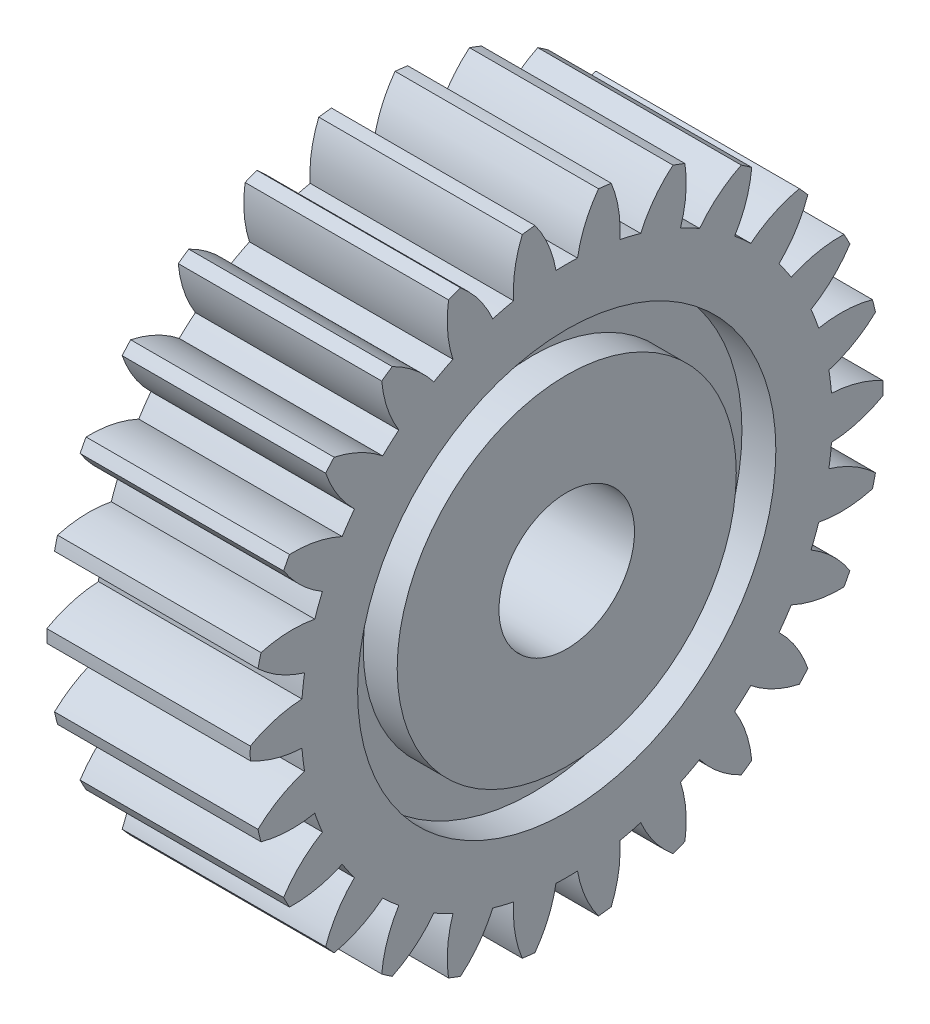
ISO-10303-21;
HEADER;
FILE_DESCRIPTION(('STEP AP214'),'2;1');
FILE_NAME('part.step','',(''),(''),'','','');
FILE_SCHEMA(('AUTOMOTIVE_DESIGN { 1 0 10303 214 1 1 1 1 }'));
ENDSEC;
DATA;
#1=APPLICATION_CONTEXT('core data for automotive mechanical design processes');
#2=APPLICATION_PROTOCOL_DEFINITION('international standard','automotive_design',2000,#1);
#3=PRODUCT_CONTEXT('',#1,'mechanical');
#4=PRODUCT('Part','Part','',(#3));
#5=PRODUCT_RELATED_PRODUCT_CATEGORY('part','',(#4));
#6=PRODUCT_DEFINITION_FORMATION('','',#4);
#7=PRODUCT_DEFINITION_CONTEXT('part definition',#1,'design');
#8=PRODUCT_DEFINITION('design','',#6,#7);
#9=PRODUCT_DEFINITION_SHAPE('','',#8);
#10=(LENGTH_UNIT() NAMED_UNIT(*) SI_UNIT(.MILLI.,.METRE.));
#11=(NAMED_UNIT(*) PLANE_ANGLE_UNIT() SI_UNIT($,.RADIAN.));
#12=(NAMED_UNIT(*) SI_UNIT($,.STERADIAN.) SOLID_ANGLE_UNIT());
#13=UNCERTAINTY_MEASURE_WITH_UNIT(LENGTH_MEASURE(1.E-05),#10,'distance_accuracy_value','');
#14=(GEOMETRIC_REPRESENTATION_CONTEXT(3) GLOBAL_UNCERTAINTY_ASSIGNED_CONTEXT((#13)) GLOBAL_UNIT_ASSIGNED_CONTEXT((#10,
#11,#12)) REPRESENTATION_CONTEXT('',''));
#15=CARTESIAN_POINT('',(0.,0.,0.));
#16=DIRECTION('',(0.,0.,1.));
#17=DIRECTION('',(1.,0.,0.));
#18=AXIS2_PLACEMENT_3D('',#15,#16,#17);
#19=CARTESIAN_POINT('',(0.,0.,0.));
#20=DIRECTION('',(1.,0.,0.));
#21=DIRECTION('',(0.,0.,-1.));
#22=AXIS2_PLACEMENT_3D('',#19,#20,#21);
#23=PLANE('',#22);
#24=CARTESIAN_POINT('',(0.,0.,0.));
#25=DIRECTION('',(1.,0.,0.));
#26=DIRECTION('',(0.,1.,0.));
#27=AXIS2_PLACEMENT_3D('',#24,#25,#26);
#28=CIRCLE('',#27,3.);
#29=CARTESIAN_POINT('',(0.,3.,0.));
#30=VERTEX_POINT('',#29);
#31=EDGE_CURVE('E41',#30,#30,#28,.T.);
#32=ORIENTED_EDGE('',*,*,#31,.T.);
#33=EDGE_LOOP('',(#32));
#34=FACE_BOUND('',#33,.T.);
#35=CARTESIAN_POINT('',(0.,0.,0.));
#36=DIRECTION('',(1.,0.,0.));
#37=DIRECTION('',(0.,0.,-1.));
#38=AXIS2_PLACEMENT_3D('',#35,#36,#37);
#39=CIRCLE('',#38,7.5);
#40=CARTESIAN_POINT('',(0.,0.,-7.5));
#41=VERTEX_POINT('',#40);
#42=EDGE_CURVE('E1621',#41,#41,#39,.T.);
#43=ORIENTED_EDGE('',*,*,#42,.F.);
#44=EDGE_LOOP('',(#43));
#45=FACE_BOUND('',#44,.T.);
#46=ADVANCED_FACE('F37',(#34,#45),#23,.F.);
#47=CARTESIAN_POINT('',(9.,0.,0.));
#48=DIRECTION('',(-1.,0.,0.));
#49=DIRECTION('',(0.,0.,1.));
#50=AXIS2_PLACEMENT_3D('',#47,#48,#49);
#51=PLANE('',#50);
#52=CARTESIAN_POINT('',(9.,0.,0.));
#53=DIRECTION('',(-1.,0.,0.));
#54=DIRECTION('',(0.,0.,1.));
#55=AXIS2_PLACEMENT_3D('',#52,#53,#54);
#56=CIRCLE('',#55,3.);
#57=CARTESIAN_POINT('',(9.,0.,3.));
#58=VERTEX_POINT('',#57);
#59=EDGE_CURVE('E1026',#58,#58,#56,.F.);
#60=ORIENTED_EDGE('',*,*,#59,.F.);
#61=EDGE_LOOP('',(#60));
#62=FACE_BOUND('',#61,.T.);
#63=CARTESIAN_POINT('',(9.,0.,0.));
#64=DIRECTION('',(1.,0.,0.));
#65=DIRECTION('',(0.,0.,-1.));
#66=AXIS2_PLACEMENT_3D('',#63,#64,#65);
#67=CIRCLE('',#66,7.5);
#68=CARTESIAN_POINT('',(9.,0.,-7.5));
#69=VERTEX_POINT('',#68);
#70=EDGE_CURVE('E1618',#69,#69,#67,.T.);
#71=ORIENTED_EDGE('',*,*,#70,.T.);
#72=EDGE_LOOP('',(#71));
#73=FACE_BOUND('',#72,.T.);
#74=ADVANCED_FACE('F1590',(#62,#73),#51,.F.);
#75=CARTESIAN_POINT('',(9.,0.,0.));
#76=DIRECTION('',(1.,0.,0.));
#77=DIRECTION('',(0.,0.,-1.));
#78=AXIS2_PLACEMENT_3D('',#75,#76,#77);
#79=CIRCLE('',#78,9.25);
#80=CARTESIAN_POINT('',(9.,0.,-9.25));
#81=VERTEX_POINT('',#80);
#82=EDGE_CURVE('E1628',#81,#81,#79,.T.);
#83=ORIENTED_EDGE('',*,*,#82,.F.);
#84=EDGE_LOOP('',(#83));
#85=FACE_BOUND('',#84,.T.);
#86=CARTESIAN_POINT('',(9.,4.25201091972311,11.4521246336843));
#87=DIRECTION('',(-1.,0.,0.));
#88=DIRECTION('',(0.,0.992708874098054,0.120536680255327));
#89=AXIS2_PLACEMENT_3D('',#86,#87,#88);
#90=CIRCLE('',#89,5.2);
#91=CARTESIAN_POINT('',(9.,-0.941530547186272,11.7112134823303));
#92=VERTEX_POINT('',#91);
#93=CARTESIAN_POINT('',(9.,-0.282618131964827,13.9971471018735));
#94=VERTEX_POINT('',#93);
#95=EDGE_CURVE('E729',#92,#94,#90,.T.);
#96=ORIENTED_EDGE('',*,*,#95,.F.);
#97=CARTESIAN_POINT('',(9.,0.,0.));
#98=DIRECTION('',(-1.,0.,0.));
#99=DIRECTION('',(0.,0.992708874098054,0.120536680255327));
#100=AXIS2_PLACEMENT_3D('',#97,#98,#99);
#101=CIRCLE('',#100,11.749);
#102=CARTESIAN_POINT('',(9.,-1.88850545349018,11.5962299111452));
#103=VERTEX_POINT('',#102);
#104=EDGE_CURVE('E734',#103,#92,#101,.T.);
#105=ORIENTED_EDGE('',*,*,#104,.F.);
#106=CARTESIAN_POINT('',(9.,-6.86912802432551,10.1017738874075));
#107=DIRECTION('',(-1.,0.,0.));
#108=DIRECTION('',(0.,0.992708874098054,0.120536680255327));
#109=AXIS2_PLACEMENT_3D('',#106,#107,#108);
#110=CIRCLE('',#109,5.2);
#111=CARTESIAN_POINT('',(9.,-3.07533079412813,13.6580503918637));
#112=VERTEX_POINT('',#111);
#113=EDGE_CURVE('E731',#112,#103,#110,.T.);
#114=ORIENTED_EDGE('',*,*,#113,.F.);
#115=CARTESIAN_POINT('',(9.,0.,0.));
#116=DIRECTION('',(-1.,0.,0.));
#117=DIRECTION('',(0.,0.,1.));
#118=AXIS2_PLACEMENT_3D('',#115,#116,#117);
#119=CIRCLE('',#118,14.);
#120=CARTESIAN_POINT('',(9.,-3.624142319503,13.5227804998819));
#121=VERTEX_POINT('',#120);
#122=EDGE_CURVE('E1318',#121,#112,#119,.T.);
#123=ORIENTED_EDGE('',*,*,#122,.F.);
#124=CARTESIAN_POINT('',(9.,1.38778239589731,12.1369195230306));
#125=DIRECTION('',(-1.,0.,0.));
#126=DIRECTION('',(0.,0.935016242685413,0.35460488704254));
#127=AXIS2_PLACEMENT_3D('',#124,#125,#126);
#128=CIRCLE('',#127,5.2);
#129=CARTESIAN_POINT('',(9.,-3.71684821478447,11.1455838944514));
#130=VERTEX_POINT('',#129);
#131=EDGE_CURVE('E880',#130,#121,#128,.T.);
#132=ORIENTED_EDGE('',*,*,#131,.F.);
#133=CARTESIAN_POINT('',(9.,0.,0.));
#134=DIRECTION('',(-1.,0.,0.));
#135=DIRECTION('',(0.,0.935016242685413,0.35460488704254));
#136=AXIS2_PLACEMENT_3D('',#133,#134,#135);
#137=CIRCLE('',#136,11.749);
#138=CARTESIAN_POINT('',(9.,-4.60878838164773,10.807315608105));
#139=VERTEX_POINT('',#138);
#140=EDGE_CURVE('E885',#139,#130,#137,.T.);
#141=ORIENTED_EDGE('',*,*,#140,.F.);
#142=CARTESIAN_POINT('',(9.,-9.08703637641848,8.16434476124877));
#143=DIRECTION('',(-1.,0.,0.));
#144=DIRECTION('',(0.,0.935016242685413,0.35460488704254));
#145=AXIS2_PLACEMENT_3D('',#142,#143,#144);
#146=CIRCLE('',#145,5.2);
#147=CARTESIAN_POINT('',(9.,-6.25455267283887,12.5251974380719));
#148=VERTEX_POINT('',#147);
#149=EDGE_CURVE('E882',#148,#139,#146,.T.);
#150=ORIENTED_EDGE('',*,*,#149,.F.);
#151=CARTESIAN_POINT('',(9.,-6.755044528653,12.2625190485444));
#152=VERTEX_POINT('',#151);
#153=EDGE_CURVE('E1321',#152,#148,#119,.T.);
#154=ORIENTED_EDGE('',*,*,#153,.F.);
#155=CARTESIAN_POINT('',(9.,-1.55709899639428,12.1163607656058));
#156=DIRECTION('',(-1.,0.,0.));
#157=DIRECTION('',(0.,0.822983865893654,0.56806474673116));
#158=AXIS2_PLACEMENT_3D('',#155,#156,#157);
#159=CIRCLE('',#158,5.2);
#160=CARTESIAN_POINT('',(9.,-6.27615617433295,9.93221348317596));
#161=VERTEX_POINT('',#160);
#162=EDGE_CURVE('E863',#161,#152,#159,.T.);
#163=ORIENTED_EDGE('',*,*,#162,.F.);
#164=CARTESIAN_POINT('',(9.,0.,0.));
#165=DIRECTION('',(-1.,0.,0.));
#166=DIRECTION('',(0.,0.822983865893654,0.56806474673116));
#167=AXIS2_PLACEMENT_3D('',#164,#165,#166);
#168=CIRCLE('',#167,11.749);
#169=CARTESIAN_POINT('',(9.,-7.06122528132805,9.39031940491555));
#170=VERTEX_POINT('',#169);
#171=EDGE_CURVE('E868',#170,#161,#168,.T.);
#172=ORIENTED_EDGE('',*,*,#171,.F.);
#173=CARTESIAN_POINT('',(9.,-10.7768392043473,5.75243359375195));
#174=DIRECTION('',(-1.,0.,0.));
#175=DIRECTION('',(0.,0.822983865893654,0.56806474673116));
#176=AXIS2_PLACEMENT_3D('',#173,#174,#175);
#177=CIRCLE('',#176,5.2);
#178=CARTESIAN_POINT('',(9.,-9.07028268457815,10.6644255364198));
#179=VERTEX_POINT('',#178);
#180=EDGE_CURVE('E865',#179,#170,#177,.T.);
#181=ORIENTED_EDGE('',*,*,#180,.F.);
#182=CARTESIAN_POINT('',(9.,-9.4933681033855,10.2896045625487));
#183=VERTEX_POINT('',#182);
#184=EDGE_CURVE('E1434',#183,#179,#119,.T.);
#185=ORIENTED_EDGE('',*,*,#184,.F.);
#186=CARTESIAN_POINT('',(9.,-4.41148745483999,11.3916431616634));
#187=DIRECTION('',(-1.,0.,0.));
#188=DIRECTION('',(0.,0.663122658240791,0.748510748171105));
#189=AXIS2_PLACEMENT_3D('',#186,#187,#188);
#190=CIRCLE('',#189,5.2);
#191=CARTESIAN_POINT('',(9.,-8.47071674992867,8.14161892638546));
#192=VERTEX_POINT('',#191);
#193=EDGE_CURVE('E846',#192,#183,#190,.T.);
#194=ORIENTED_EDGE('',*,*,#193,.F.);
#195=CARTESIAN_POINT('',(9.,0.,0.));
#196=DIRECTION('',(-1.,0.,0.));
#197=DIRECTION('',(0.,0.663122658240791,0.748510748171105));
#198=AXIS2_PLACEMENT_3D('',#195,#196,#197);
#199=CIRCLE('',#198,11.749);
#200=CARTESIAN_POINT('',(9.,-9.10328943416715,7.42759197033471));
#201=VERTEX_POINT('',#200);
#202=EDGE_CURVE('E851',#201,#192,#199,.T.);
#203=ORIENTED_EDGE('',*,*,#202,.F.);
#204=CARTESIAN_POINT('',(9.,-11.8403313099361,3.00621189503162));
#205=DIRECTION('',(-1.,0.,0.));
#206=DIRECTION('',(0.,0.663122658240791,0.748510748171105));
#207=AXIS2_PLACEMENT_3D('',#204,#205,#206);
#208=CIRCLE('',#207,5.2);
#209=CARTESIAN_POINT('',(9.,-11.3588808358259,8.18387598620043));
#210=VERTEX_POINT('',#209);
#211=EDGE_CURVE('E848',#210,#201,#208,.T.);
#212=ORIENTED_EDGE('',*,*,#211,.F.);
#213=CARTESIAN_POINT('',(9.,-11.6799716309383,7.7186956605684));
#214=VERTEX_POINT('',#213);
#215=EDGE_CURVE('E1428',#214,#210,#119,.T.);
#216=ORIENTED_EDGE('',*,*,#215,.F.);
#217=CARTESIAN_POINT('',(9.,-7.00949629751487,10.0048846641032));
#218=DIRECTION('',(-1.,0.,0.));
#219=DIRECTION('',(0.,0.464723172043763,0.885456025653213));
#220=AXIS2_PLACEMENT_3D('',#217,#218,#219);
#221=CIRCLE('',#220,5.2);
#222=CARTESIAN_POINT('',(9.,-10.1729900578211,5.87786307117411));
#223=VERTEX_POINT('',#222);
#224=EDGE_CURVE('E793',#223,#214,#221,.T.);
#225=ORIENTED_EDGE('',*,*,#224,.F.);
#226=CARTESIAN_POINT('',(9.,0.,0.));
#227=DIRECTION('',(-1.,0.,0.));
#228=DIRECTION('',(0.,0.464723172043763,0.885456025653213));
#229=AXIS2_PLACEMENT_3D('',#226,#227,#228);
#230=CIRCLE('',#229,11.749);
#231=CARTESIAN_POINT('',(9.,-10.6163034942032,5.03319988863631));
#232=VERTEX_POINT('',#231);
#233=EDGE_CURVE('E798',#232,#223,#230,.T.);
#234=ORIENTED_EDGE('',*,*,#233,.F.);
#235=CARTESIAN_POINT('',(9.,-12.2157063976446,0.0852800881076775));
#236=DIRECTION('',(-1.,0.,0.));
#237=DIRECTION('',(0.,0.464723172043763,0.885456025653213));
#238=AXIS2_PLACEMENT_3D('',#235,#236,#237);
#239=CIRCLE('',#238,5.2);
#240=CARTESIAN_POINT('',(9.,-12.9873421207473,5.22770931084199));
#241=VERTEX_POINT('',#240);
#242=EDGE_CURVE('E795',#241,#232,#239,.T.);
#243=ORIENTED_EDGE('',*,*,#242,.F.);
#244=CARTESIAN_POINT('',(9.,-13.1877776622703,4.69920422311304));
#245=VERTEX_POINT('',#244);
#246=EDGE_CURVE('E1422',#245,#241,#119,.T.);
#247=ORIENTED_EDGE('',*,*,#246,.F.);
#248=CARTESIAN_POINT('',(9.,-9.20013869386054,8.03667863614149));
#249=DIRECTION('',(-1.,0.,0.));
#250=DIRECTION('',(0.,0.239315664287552,0.970941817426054));
#251=AXIS2_PLACEMENT_3D('',#248,#249,#250);
#252=CIRCLE('',#251,5.2);
#253=CARTESIAN_POINT('',(9.,-11.2840461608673,3.27250717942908));
#254=VERTEX_POINT('',#253);
#255=EDGE_CURVE('E812',#254,#245,#252,.T.);
#256=ORIENTED_EDGE('',*,*,#255,.F.);
#257=CARTESIAN_POINT('',(9.,0.,0.));
#258=DIRECTION('',(-1.,0.,0.));
#259=DIRECTION('',(0.,0.239315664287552,0.970941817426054));
#260=AXIS2_PLACEMENT_3D('',#257,#258,#259);
#261=CIRCLE('',#260,11.749);
#262=CARTESIAN_POINT('',(9.,-11.5123365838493,2.34629652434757));
#263=VERTEX_POINT('',#262);
#264=EDGE_CURVE('E817',#263,#254,#261,.T.);
#265=ORIENTED_EDGE('',*,*,#264,.F.);
#266=CARTESIAN_POINT('',(9.,-11.8811490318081,-2.84060788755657));
#267=DIRECTION('',(-1.,0.,0.));
#268=DIRECTION('',(0.,0.239315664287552,0.970941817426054));
#269=AXIS2_PLACEMENT_3D('',#266,#267,#268);
#270=CIRCLE('',#269,5.2);
#271=CARTESIAN_POINT('',(9.,-13.8610262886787,1.9677271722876));
#272=VERTEX_POINT('',#271);
#273=EDGE_CURVE('E814',#272,#263,#270,.T.);
#274=ORIENTED_EDGE('',*,*,#273,.F.);
#275=CARTESIAN_POINT('',(9.,-13.9291579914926,1.4066121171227));
#276=VERTEX_POINT('',#275);
#277=EDGE_CURVE('E1416',#276,#272,#119,.T.);
#278=ORIENTED_EDGE('',*,*,#277,.F.);
#279=CARTESIAN_POINT('',(9.,-10.8561024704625,5.60141005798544));
#280=DIRECTION('',(-1.,0.,0.));
#281=DIRECTION('',(0.,0.,1.));
#282=AXIS2_PLACEMENT_3D('',#279,#280,#281);
#283=CIRCLE('',#282,5.2);
#284=CARTESIAN_POINT('',(9.,-11.7393145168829,0.47696506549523));
#285=VERTEX_POINT('',#284);
#286=EDGE_CURVE('E829',#285,#276,#283,.T.);
#287=ORIENTED_EDGE('',*,*,#286,.F.);
#288=CARTESIAN_POINT('',(9.,0.,0.));
#289=DIRECTION('',(-1.,0.,0.));
#290=DIRECTION('',(0.,0.,1.));
#291=AXIS2_PLACEMENT_3D('',#288,#289,#290);
#292=CIRCLE('',#291,11.749);
#293=CARTESIAN_POINT('',(9.,-11.7393145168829,-0.476965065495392));
#294=VERTEX_POINT('',#293);
#295=EDGE_CURVE('E834',#294,#285,#292,.T.);
#296=ORIENTED_EDGE('',*,*,#295,.F.);
#297=CARTESIAN_POINT('',(9.,-10.8561024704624,-5.60141005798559));
#298=DIRECTION('',(-1.,0.,0.));
#299=DIRECTION('',(0.,0.,1.));
#300=AXIS2_PLACEMENT_3D('',#297,#298,#299);
#301=CIRCLE('',#300,5.2);
#302=CARTESIAN_POINT('',(9.,-13.9291579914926,-1.4066121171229));
#303=VERTEX_POINT('',#302);
#304=EDGE_CURVE('E831',#303,#294,#301,.T.);
#305=ORIENTED_EDGE('',*,*,#304,.F.);
#306=CARTESIAN_POINT('',(9.,-13.8610262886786,-1.96772717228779));
#307=VERTEX_POINT('',#306);
#308=EDGE_CURVE('E1410',#307,#303,#119,.T.);
#309=ORIENTED_EDGE('',*,*,#308,.F.);
#310=CARTESIAN_POINT('',(9.,-11.8811490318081,2.8406078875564));
#311=DIRECTION('',(-1.,0.,0.));
#312=DIRECTION('',(0.,-0.239315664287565,0.97094181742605));
#313=AXIS2_PLACEMENT_3D('',#310,#311,#312);
#314=CIRCLE('',#313,5.2);
#315=CARTESIAN_POINT('',(9.,-11.5123365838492,-2.34629652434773));
#316=VERTEX_POINT('',#315);
#317=EDGE_CURVE('E947',#316,#307,#314,.T.);
#318=ORIENTED_EDGE('',*,*,#317,.F.);
#319=CARTESIAN_POINT('',(9.,0.,0.));
#320=DIRECTION('',(-1.,0.,0.));
#321=DIRECTION('',(0.,-0.239315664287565,0.97094181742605));
#322=AXIS2_PLACEMENT_3D('',#319,#320,#321);
#323=CIRCLE('',#322,11.749);
#324=CARTESIAN_POINT('',(9.,-11.2840461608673,-3.27250717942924));
#325=VERTEX_POINT('',#324);
#326=EDGE_CURVE('E952',#325,#316,#323,.T.);
#327=ORIENTED_EDGE('',*,*,#326,.F.);
#328=CARTESIAN_POINT('',(9.,-9.20013869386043,-8.03667863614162));
#329=DIRECTION('',(-1.,0.,0.));
#330=DIRECTION('',(0.,-0.239315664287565,0.97094181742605));
#331=AXIS2_PLACEMENT_3D('',#328,#329,#330);
#332=CIRCLE('',#331,5.2);
#333=CARTESIAN_POINT('',(9.,-13.1877776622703,-4.69920422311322));
#334=VERTEX_POINT('',#333);
#335=EDGE_CURVE('E949',#334,#325,#332,.T.);
#336=ORIENTED_EDGE('',*,*,#335,.F.);
#337=CARTESIAN_POINT('',(9.,-12.9873421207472,-5.22770931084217));
#338=VERTEX_POINT('',#337);
#339=EDGE_CURVE('E1404',#338,#334,#119,.T.);
#340=ORIENTED_EDGE('',*,*,#339,.F.);
#341=CARTESIAN_POINT('',(9.,-12.2157063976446,-0.0852800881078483));
#342=DIRECTION('',(-1.,0.,0.));
#343=DIRECTION('',(0.,-0.464723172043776,0.885456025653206));
#344=AXIS2_PLACEMENT_3D('',#341,#342,#343);
#345=CIRCLE('',#344,5.2);
#346=CARTESIAN_POINT('',(9.,-10.6163034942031,-5.03319988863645));
#347=VERTEX_POINT('',#346);
#348=EDGE_CURVE('E981',#347,#338,#345,.T.);
#349=ORIENTED_EDGE('',*,*,#348,.F.);
#350=CARTESIAN_POINT('',(9.,0.,0.));
#351=DIRECTION('',(-1.,0.,0.));
#352=DIRECTION('',(0.,-0.464723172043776,0.885456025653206));
#353=AXIS2_PLACEMENT_3D('',#350,#351,#352);
#354=CIRCLE('',#353,11.749);
#355=CARTESIAN_POINT('',(9.,-10.1729900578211,-5.87786307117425));
#356=VERTEX_POINT('',#355);
#357=EDGE_CURVE('E986',#356,#347,#354,.T.);
#358=ORIENTED_EDGE('',*,*,#357,.F.);
#359=CARTESIAN_POINT('',(9.,-7.00949629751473,-10.0048846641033));
#360=DIRECTION('',(-1.,0.,0.));
#361=DIRECTION('',(0.,-0.464723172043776,0.885456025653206));
#362=AXIS2_PLACEMENT_3D('',#359,#360,#361);
#363=CIRCLE('',#362,5.2);
#364=CARTESIAN_POINT('',(9.,-11.6799716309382,-7.71869566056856));
#365=VERTEX_POINT('',#364);
#366=EDGE_CURVE('E983',#365,#356,#363,.T.);
#367=ORIENTED_EDGE('',*,*,#366,.F.);
#368=CARTESIAN_POINT('',(9.,-11.3588808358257,-8.18387598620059));
#369=VERTEX_POINT('',#368);
#370=EDGE_CURVE('E1398',#369,#365,#119,.T.);
#371=ORIENTED_EDGE('',*,*,#370,.F.);
#372=CARTESIAN_POINT('',(9.,-11.8403313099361,-3.00621189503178));
#373=DIRECTION('',(-1.,0.,0.));
#374=DIRECTION('',(0.,-0.663122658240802,0.748510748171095));
#375=AXIS2_PLACEMENT_3D('',#372,#373,#374);
#376=CIRCLE('',#375,5.2);
#377=CARTESIAN_POINT('',(9.,-9.10328943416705,-7.42759197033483));
#378=VERTEX_POINT('',#377);
#379=EDGE_CURVE('E964',#378,#369,#376,.T.);
#380=ORIENTED_EDGE('',*,*,#379,.F.);
#381=CARTESIAN_POINT('',(9.,0.,0.));
#382=DIRECTION('',(-1.,0.,0.));
#383=DIRECTION('',(0.,-0.663122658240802,0.748510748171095));
#384=AXIS2_PLACEMENT_3D('',#381,#382,#383);
#385=CIRCLE('',#384,11.749);
#386=CARTESIAN_POINT('',(9.,-8.47071674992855,-8.14161892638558));
#387=VERTEX_POINT('',#386);
#388=EDGE_CURVE('E969',#387,#378,#385,.T.);
#389=ORIENTED_EDGE('',*,*,#388,.F.);
#390=CARTESIAN_POINT('',(9.,-4.41148745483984,-11.3916431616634));
#391=DIRECTION('',(-1.,0.,0.));
#392=DIRECTION('',(0.,-0.663122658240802,0.748510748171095));
#393=AXIS2_PLACEMENT_3D('',#390,#391,#392);
#394=CIRCLE('',#393,5.2);
#395=CARTESIAN_POINT('',(9.,-9.49336810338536,-10.2896045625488));
#396=VERTEX_POINT('',#395);
#397=EDGE_CURVE('E966',#396,#387,#394,.T.);
#398=ORIENTED_EDGE('',*,*,#397,.F.);
#399=CARTESIAN_POINT('',(9.,-9.07028268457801,-10.6644255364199));
#400=VERTEX_POINT('',#399);
#401=EDGE_CURVE('E1392',#400,#396,#119,.T.);
#402=ORIENTED_EDGE('',*,*,#401,.F.);
#403=CARTESIAN_POINT('',(9.,-10.7768392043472,-5.75243359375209));
#404=DIRECTION('',(-1.,0.,0.));
#405=DIRECTION('',(0.,-0.822983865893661,0.568064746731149));
#406=AXIS2_PLACEMENT_3D('',#403,#404,#405);
#407=CIRCLE('',#406,5.2);
#408=CARTESIAN_POINT('',(9.,-7.06122528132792,-9.39031940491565));
#409=VERTEX_POINT('',#408);
#410=EDGE_CURVE('E931',#409,#400,#407,.T.);
#411=ORIENTED_EDGE('',*,*,#410,.F.);
#412=CARTESIAN_POINT('',(9.,0.,0.));
#413=DIRECTION('',(-1.,0.,0.));
#414=DIRECTION('',(0.,-0.822983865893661,0.568064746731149));
#415=AXIS2_PLACEMENT_3D('',#412,#413,#414);
#416=CIRCLE('',#415,11.749);
#417=CARTESIAN_POINT('',(9.,-6.27615617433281,-9.93221348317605));
#418=VERTEX_POINT('',#417);
#419=EDGE_CURVE('E936',#418,#409,#416,.T.);
#420=ORIENTED_EDGE('',*,*,#419,.F.);
#421=CARTESIAN_POINT('',(9.,-1.55709899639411,-12.1163607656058));
#422=DIRECTION('',(-1.,0.,0.));
#423=DIRECTION('',(0.,-0.822983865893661,0.568064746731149));
#424=AXIS2_PLACEMENT_3D('',#421,#422,#423);
#425=CIRCLE('',#424,5.2);
#426=CARTESIAN_POINT('',(9.,-6.75504452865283,-12.2625190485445));
#427=VERTEX_POINT('',#426);
#428=EDGE_CURVE('E933',#427,#418,#425,.T.);
#429=ORIENTED_EDGE('',*,*,#428,.F.);
#430=CARTESIAN_POINT('',(9.,-6.2545526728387,-12.525197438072));
#431=VERTEX_POINT('',#430);
#432=EDGE_CURVE('E1386',#431,#427,#119,.T.);
#433=ORIENTED_EDGE('',*,*,#432,.F.);
#434=CARTESIAN_POINT('',(9.,-9.08703637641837,-8.16434476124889));
#435=DIRECTION('',(-1.,0.,0.));
#436=DIRECTION('',(0.,-0.935016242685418,0.354604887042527));
#437=AXIS2_PLACEMENT_3D('',#434,#435,#436);
#438=CIRCLE('',#437,5.2);
#439=CARTESIAN_POINT('',(9.,-4.60878838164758,-10.807315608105));
#440=VERTEX_POINT('',#439);
#441=EDGE_CURVE('E895',#440,#431,#438,.T.);
#442=ORIENTED_EDGE('',*,*,#441,.F.);
#443=CARTESIAN_POINT('',(9.,0.,0.));
#444=DIRECTION('',(-1.,0.,0.));
#445=DIRECTION('',(0.,-0.935016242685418,0.354604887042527));
#446=AXIS2_PLACEMENT_3D('',#443,#444,#445);
#447=CIRCLE('',#446,11.749);
#448=CARTESIAN_POINT('',(9.,-3.71684821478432,-11.1455838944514));
#449=VERTEX_POINT('',#448);
#450=EDGE_CURVE('E900',#449,#440,#447,.T.);
#451=ORIENTED_EDGE('',*,*,#450,.F.);
#452=CARTESIAN_POINT('',(9.,1.38778239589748,-12.1369195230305));
#453=DIRECTION('',(-1.,0.,0.));
#454=DIRECTION('',(0.,-0.935016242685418,0.354604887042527));
#455=AXIS2_PLACEMENT_3D('',#452,#453,#454);
#456=CIRCLE('',#455,5.2);
#457=CARTESIAN_POINT('',(9.,-3.62414231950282,-13.522780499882));
#458=VERTEX_POINT('',#457);
#459=EDGE_CURVE('E897',#458,#449,#456,.T.);
#460=ORIENTED_EDGE('',*,*,#459,.F.);
#461=CARTESIAN_POINT('',(9.,-3.07533079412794,-13.6580503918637));
#462=VERTEX_POINT('',#461);
#463=EDGE_CURVE('E1380',#462,#458,#119,.T.);
#464=ORIENTED_EDGE('',*,*,#463,.F.);
#465=CARTESIAN_POINT('',(9.,-6.86912802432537,-10.1017738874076));
#466=DIRECTION('',(-1.,0.,0.));
#467=DIRECTION('',(0.,-0.992708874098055,0.120536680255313));
#468=AXIS2_PLACEMENT_3D('',#465,#466,#467);
#469=CIRCLE('',#468,5.2);
#470=CARTESIAN_POINT('',(9.,-1.88850545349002,-11.5962299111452));
#471=VERTEX_POINT('',#470);
#472=EDGE_CURVE('E914',#471,#462,#469,.T.);
#473=ORIENTED_EDGE('',*,*,#472,.F.);
#474=CARTESIAN_POINT('',(9.,0.,0.));
#475=DIRECTION('',(-1.,0.,0.));
#476=DIRECTION('',(0.,-0.992708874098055,0.120536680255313));
#477=AXIS2_PLACEMENT_3D('',#474,#475,#476);
#478=CIRCLE('',#477,11.749);
#479=CARTESIAN_POINT('',(9.,-0.94153054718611,-11.7112134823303));
#480=VERTEX_POINT('',#479);
#481=EDGE_CURVE('E919',#480,#471,#478,.T.);
#482=ORIENTED_EDGE('',*,*,#481,.F.);
#483=CARTESIAN_POINT('',(9.,4.25201091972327,-11.4521246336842));
#484=DIRECTION('',(-1.,0.,0.));
#485=DIRECTION('',(0.,-0.992708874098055,0.120536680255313));
#486=AXIS2_PLACEMENT_3D('',#483,#484,#485);
#487=CIRCLE('',#486,5.2);
#488=CARTESIAN_POINT('',(9.,-0.28261813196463,-13.9971471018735));
#489=VERTEX_POINT('',#488);
#490=EDGE_CURVE('E916',#489,#480,#487,.T.);
#491=ORIENTED_EDGE('',*,*,#490,.F.);
#492=CARTESIAN_POINT('',(9.,0.282618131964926,-13.9971471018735));
#493=VERTEX_POINT('',#492);
#494=EDGE_CURVE('E1374',#493,#489,#119,.T.);
#495=ORIENTED_EDGE('',*,*,#494,.F.);
#496=CARTESIAN_POINT('',(9.,-4.25201091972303,-11.4521246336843));
#497=DIRECTION('',(-1.,0.,0.));
#498=DIRECTION('',(0.,-0.992708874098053,-0.120536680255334));
#499=AXIS2_PLACEMENT_3D('',#496,#497,#498);
#500=CIRCLE('',#499,5.2);
#501=CARTESIAN_POINT('',(9.,0.941530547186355,-11.7112134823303));
#502=VERTEX_POINT('',#501);
#503=EDGE_CURVE('E1049',#502,#493,#500,.T.);
#504=ORIENTED_EDGE('',*,*,#503,.F.);
#505=CARTESIAN_POINT('',(9.,0.,0.));
#506=DIRECTION('',(-1.,0.,0.));
#507=DIRECTION('',(0.,-0.992708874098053,-0.120536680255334));
#508=AXIS2_PLACEMENT_3D('',#505,#506,#507);
#509=CIRCLE('',#508,11.749);
#510=CARTESIAN_POINT('',(9.,1.88850545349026,-11.5962299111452));
#511=VERTEX_POINT('',#510);
#512=EDGE_CURVE('E1054',#511,#502,#509,.T.);
#513=ORIENTED_EDGE('',*,*,#512,.F.);
#514=CARTESIAN_POINT('',(9.,6.86912802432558,-10.1017738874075));
#515=DIRECTION('',(-1.,0.,0.));
#516=DIRECTION('',(0.,-0.992708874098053,-0.120536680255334));
#517=AXIS2_PLACEMENT_3D('',#514,#515,#516);
#518=CIRCLE('',#517,5.2);
#519=CARTESIAN_POINT('',(9.,3.07533079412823,-13.6580503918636));
#520=VERTEX_POINT('',#519);
#521=EDGE_CURVE('E1051',#520,#511,#518,.T.);
#522=ORIENTED_EDGE('',*,*,#521,.F.);
#523=CARTESIAN_POINT('',(9.,3.6241423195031,-13.5227804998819));
#524=VERTEX_POINT('',#523);
#525=EDGE_CURVE('E1368',#524,#520,#119,.T.);
#526=ORIENTED_EDGE('',*,*,#525,.F.);
#527=CARTESIAN_POINT('',(9.,-1.38778239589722,-12.1369195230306));
#528=DIRECTION('',(-1.,0.,0.));
#529=DIRECTION('',(0.,-0.935016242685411,-0.354604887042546));
#530=AXIS2_PLACEMENT_3D('',#527,#528,#529);
#531=CIRCLE('',#530,5.2);
#532=CARTESIAN_POINT('',(9.,3.71684821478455,-11.1455838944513));
#533=VERTEX_POINT('',#532);
#534=EDGE_CURVE('E1083',#533,#524,#531,.T.);
#535=ORIENTED_EDGE('',*,*,#534,.F.);
#536=CARTESIAN_POINT('',(9.,0.,0.));
#537=DIRECTION('',(-1.,0.,0.));
#538=DIRECTION('',(0.,-0.935016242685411,-0.354604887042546));
#539=AXIS2_PLACEMENT_3D('',#536,#537,#538);
#540=CIRCLE('',#539,11.749);
#541=CARTESIAN_POINT('',(9.,4.6087883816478,-10.8073156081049));
#542=VERTEX_POINT('',#541);
#543=EDGE_CURVE('E1088',#542,#533,#540,.T.);
#544=ORIENTED_EDGE('',*,*,#543,.F.);
#545=CARTESIAN_POINT('',(9.,9.08703637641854,-8.1643447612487));
#546=DIRECTION('',(-1.,0.,0.));
#547=DIRECTION('',(0.,-0.935016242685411,-0.354604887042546));
#548=AXIS2_PLACEMENT_3D('',#545,#546,#547);
#549=CIRCLE('',#548,5.2);
#550=CARTESIAN_POINT('',(9.,6.25455267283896,-12.5251974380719));
#551=VERTEX_POINT('',#550);
#552=EDGE_CURVE('E1085',#551,#542,#549,.T.);
#553=ORIENTED_EDGE('',*,*,#552,.F.);
#554=CARTESIAN_POINT('',(9.,6.75504452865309,-12.2625190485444));
#555=VERTEX_POINT('',#554);
#556=EDGE_CURVE('E1362',#555,#551,#119,.T.);
#557=ORIENTED_EDGE('',*,*,#556,.F.);
#558=CARTESIAN_POINT('',(9.,1.55709899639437,-12.1163607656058));
#559=DIRECTION('',(-1.,0.,0.));
#560=DIRECTION('',(0.,-0.822983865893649,-0.568064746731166));
#561=AXIS2_PLACEMENT_3D('',#558,#559,#560);
#562=CIRCLE('',#561,5.2);
#563=CARTESIAN_POINT('',(9.,6.27615617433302,-9.93221348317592));
#564=VERTEX_POINT('',#563);
#565=EDGE_CURVE('E1066',#564,#555,#562,.T.);
#566=ORIENTED_EDGE('',*,*,#565,.F.);
#567=CARTESIAN_POINT('',(9.,0.,0.));
#568=DIRECTION('',(-1.,0.,0.));
#569=DIRECTION('',(0.,-0.822983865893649,-0.568064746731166));
#570=AXIS2_PLACEMENT_3D('',#567,#568,#569);
#571=CIRCLE('',#570,11.749);
#572=CARTESIAN_POINT('',(9.,7.06122528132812,-9.3903194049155));
#573=VERTEX_POINT('',#572);
#574=EDGE_CURVE('E1071',#573,#564,#571,.T.);
#575=ORIENTED_EDGE('',*,*,#574,.F.);
#576=CARTESIAN_POINT('',(9.,10.7768392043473,-5.75243359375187));
#577=DIRECTION('',(-1.,0.,0.));
#578=DIRECTION('',(0.,-0.822983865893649,-0.568064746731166));
#579=AXIS2_PLACEMENT_3D('',#576,#577,#578);
#580=CIRCLE('',#579,5.2);
#581=CARTESIAN_POINT('',(9.,9.07028268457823,-10.6644255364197));
#582=VERTEX_POINT('',#581);
#583=EDGE_CURVE('E1068',#582,#573,#580,.T.);
#584=ORIENTED_EDGE('',*,*,#583,.F.);
#585=CARTESIAN_POINT('',(9.,9.49336810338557,-10.2896045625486));
#586=VERTEX_POINT('',#585);
#587=EDGE_CURVE('E1356',#586,#582,#119,.T.);
#588=ORIENTED_EDGE('',*,*,#587,.F.);
#589=CARTESIAN_POINT('',(9.,4.41148745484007,-11.3916431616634));
#590=DIRECTION('',(-1.,0.,0.));
#591=DIRECTION('',(0.,-0.663122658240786,-0.748510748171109));
#592=AXIS2_PLACEMENT_3D('',#589,#590,#591);
#593=CIRCLE('',#592,5.2);
#594=CARTESIAN_POINT('',(9.,8.47071674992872,-8.1416189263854));
#595=VERTEX_POINT('',#594);
#596=EDGE_CURVE('E1032',#595,#586,#593,.T.);
#597=ORIENTED_EDGE('',*,*,#596,.F.);
#598=CARTESIAN_POINT('',(9.,0.,0.));
#599=DIRECTION('',(-1.,0.,0.));
#600=DIRECTION('',(0.,-0.663122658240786,-0.748510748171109));
#601=AXIS2_PLACEMENT_3D('',#598,#599,#600);
#602=CIRCLE('',#601,11.749);
#603=CARTESIAN_POINT('',(9.,9.1032894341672,-7.42759197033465));
#604=VERTEX_POINT('',#603);
#605=EDGE_CURVE('E1037',#604,#595,#602,.T.);
#606=ORIENTED_EDGE('',*,*,#605,.F.);
#607=CARTESIAN_POINT('',(9.,11.8403313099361,-3.00621189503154));
#608=DIRECTION('',(-1.,0.,0.));
#609=DIRECTION('',(0.,-0.663122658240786,-0.748510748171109));
#610=AXIS2_PLACEMENT_3D('',#607,#608,#609);
#611=CIRCLE('',#610,5.2);
#612=CARTESIAN_POINT('',(9.,11.3588808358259,-8.18387598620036));
#613=VERTEX_POINT('',#612);
#614=EDGE_CURVE('E1034',#613,#604,#611,.T.);
#615=ORIENTED_EDGE('',*,*,#614,.F.);
#616=CARTESIAN_POINT('',(9.,11.6799716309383,-7.71869566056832));
#617=VERTEX_POINT('',#616);
#618=EDGE_CURVE('E1350',#617,#613,#119,.T.);
#619=ORIENTED_EDGE('',*,*,#618,.F.);
#620=CARTESIAN_POINT('',(9.,7.00949629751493,-10.0048846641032));
#621=DIRECTION('',(-1.,0.,0.));
#622=DIRECTION('',(0.,-0.464723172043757,-0.885456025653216));
#623=AXIS2_PLACEMENT_3D('',#620,#621,#622);
#624=CIRCLE('',#623,5.2);
#625=CARTESIAN_POINT('',(9.,10.1729900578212,-5.87786307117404));
#626=VERTEX_POINT('',#625);
#627=EDGE_CURVE('E996',#626,#617,#624,.T.);
#628=ORIENTED_EDGE('',*,*,#627,.F.);
#629=CARTESIAN_POINT('',(9.,0.,0.));
#630=DIRECTION('',(-1.,0.,0.));
#631=DIRECTION('',(0.,-0.464723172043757,-0.885456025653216));
#632=AXIS2_PLACEMENT_3D('',#629,#630,#631);
#633=CIRCLE('',#632,11.749);
#634=CARTESIAN_POINT('',(9.,10.6163034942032,-5.03319988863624));
#635=VERTEX_POINT('',#634);
#636=EDGE_CURVE('E1001',#635,#626,#633,.T.);
#637=ORIENTED_EDGE('',*,*,#636,.F.);
#638=CARTESIAN_POINT('',(9.,12.2157063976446,-0.0852800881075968));
#639=DIRECTION('',(-1.,0.,0.));
#640=DIRECTION('',(0.,-0.464723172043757,-0.885456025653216));
#641=AXIS2_PLACEMENT_3D('',#638,#639,#640);
#642=CIRCLE('',#641,5.2);
#643=CARTESIAN_POINT('',(9.,12.9873421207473,-5.2277093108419));
#644=VERTEX_POINT('',#643);
#645=EDGE_CURVE('E998',#644,#635,#642,.T.);
#646=ORIENTED_EDGE('',*,*,#645,.F.);
#647=CARTESIAN_POINT('',(9.,13.1877776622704,-4.69920422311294));
#648=VERTEX_POINT('',#647);
#649=EDGE_CURVE('E1249',#648,#644,#119,.T.);
#650=ORIENTED_EDGE('',*,*,#649,.F.);
#651=CARTESIAN_POINT('',(9.,9.20013869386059,-8.03667863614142));
#652=DIRECTION('',(-1.,0.,0.));
#653=DIRECTION('',(0.,-0.239315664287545,-0.970941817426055));
#654=AXIS2_PLACEMENT_3D('',#651,#652,#653);
#655=CIRCLE('',#654,5.2);
#656=CARTESIAN_POINT('',(9.,11.2840461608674,-3.272507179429));
#657=VERTEX_POINT('',#656);
#658=EDGE_CURVE('E1015',#657,#648,#655,.T.);
#659=ORIENTED_EDGE('',*,*,#658,.F.);
#660=CARTESIAN_POINT('',(9.,0.,0.));
#661=DIRECTION('',(-1.,0.,0.));
#662=DIRECTION('',(0.,-0.239315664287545,-0.970941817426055));
#663=AXIS2_PLACEMENT_3D('',#660,#661,#662);
#664=CIRCLE('',#663,11.749);
#665=CARTESIAN_POINT('',(9.,11.5123365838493,-2.34629652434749));
#666=VERTEX_POINT('',#665);
#667=EDGE_CURVE('E1020',#666,#657,#664,.T.);
#668=ORIENTED_EDGE('',*,*,#667,.F.);
#669=CARTESIAN_POINT('',(9.,11.8811490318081,2.84060788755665));
#670=DIRECTION('',(-1.,0.,0.));
#671=DIRECTION('',(0.,-0.239315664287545,-0.970941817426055));
#672=AXIS2_PLACEMENT_3D('',#669,#670,#671);
#673=CIRCLE('',#672,5.2);
#674=CARTESIAN_POINT('',(9.,13.8610262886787,-1.9677271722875));
#675=VERTEX_POINT('',#674);
#676=EDGE_CURVE('E1017',#675,#666,#673,.T.);
#677=ORIENTED_EDGE('',*,*,#676,.F.);
#678=CARTESIAN_POINT('',(9.,13.9291579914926,-1.4066121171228));
#679=VERTEX_POINT('',#678);
#680=EDGE_CURVE('E1245',#679,#675,#119,.T.);
#681=ORIENTED_EDGE('',*,*,#680,.F.);
#682=CARTESIAN_POINT('',(9.,10.8561024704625,-5.60141005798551));
#683=DIRECTION('',(-1.,0.,0.));
#684=DIRECTION('',(0.,0.,-1.));
#685=AXIS2_PLACEMENT_3D('',#682,#683,#684);
#686=CIRCLE('',#685,5.2);
#687=CARTESIAN_POINT('',(9.,11.7393145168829,-0.476965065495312));
#688=VERTEX_POINT('',#687);
#689=EDGE_CURVE('E1217',#688,#679,#686,.T.);
#690=ORIENTED_EDGE('',*,*,#689,.F.);
#691=CARTESIAN_POINT('',(9.,0.,0.));
#692=DIRECTION('',(-1.,0.,0.));
#693=DIRECTION('',(0.,0.,-1.));
#694=AXIS2_PLACEMENT_3D('',#691,#692,#693);
#695=CIRCLE('',#694,11.749);
#696=CARTESIAN_POINT('',(9.,11.7393145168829,0.47696506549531));
#697=VERTEX_POINT('',#696);
#698=EDGE_CURVE('E1222',#697,#688,#695,.T.);
#699=ORIENTED_EDGE('',*,*,#698,.F.);
#700=CARTESIAN_POINT('',(9.,10.8561024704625,5.60141005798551));
#701=DIRECTION('',(-1.,0.,0.));
#702=DIRECTION('',(0.,0.,-1.));
#703=AXIS2_PLACEMENT_3D('',#700,#701,#702);
#704=CIRCLE('',#703,5.2);
#705=CARTESIAN_POINT('',(9.,13.9291579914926,1.4066121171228));
#706=VERTEX_POINT('',#705);
#707=EDGE_CURVE('E1219',#706,#697,#704,.T.);
#708=ORIENTED_EDGE('',*,*,#707,.F.);
#709=CARTESIAN_POINT('',(9.,13.8610262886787,1.9677271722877));
#710=VERTEX_POINT('',#709);
#711=EDGE_CURVE('E1242',#710,#706,#119,.T.);
#712=ORIENTED_EDGE('',*,*,#711,.F.);
#713=CARTESIAN_POINT('',(9.,11.8811490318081,-2.84060788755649));
#714=DIRECTION('',(-1.,0.,0.));
#715=DIRECTION('',(0.,0.239315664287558,-0.970941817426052));
#716=AXIS2_PLACEMENT_3D('',#713,#714,#715);
#717=CIRCLE('',#716,5.2);
#718=CARTESIAN_POINT('',(9.,11.5123365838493,2.34629652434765));
#719=VERTEX_POINT('',#718);
#720=EDGE_CURVE('E1195',#719,#710,#717,.T.);
#721=ORIENTED_EDGE('',*,*,#720,.F.);
#722=CARTESIAN_POINT('',(9.,0.,0.));
#723=DIRECTION('',(-1.,0.,0.));
#724=DIRECTION('',(0.,0.239315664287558,-0.970941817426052));
#725=AXIS2_PLACEMENT_3D('',#722,#723,#724);
#726=CIRCLE('',#725,11.749);
#727=CARTESIAN_POINT('',(9.,11.2840461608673,3.27250717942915));
#728=VERTEX_POINT('',#727);
#729=EDGE_CURVE('E1200',#728,#719,#726,.T.);
#730=ORIENTED_EDGE('',*,*,#729,.F.);
#731=CARTESIAN_POINT('',(9.,9.20013869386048,8.03667863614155));
#732=DIRECTION('',(-1.,0.,0.));
#733=DIRECTION('',(0.,0.239315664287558,-0.970941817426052));
#734=AXIS2_PLACEMENT_3D('',#731,#732,#733);
#735=CIRCLE('',#734,5.2);
#736=CARTESIAN_POINT('',(9.,13.1877776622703,4.69920422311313));
#737=VERTEX_POINT('',#736);
#738=EDGE_CURVE('E1197',#737,#728,#735,.T.);
#739=ORIENTED_EDGE('',*,*,#738,.F.);
#740=CARTESIAN_POINT('',(9.,12.9873421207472,5.22770931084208));
#741=VERTEX_POINT('',#740);
#742=EDGE_CURVE('E1250',#741,#737,#119,.T.);
#743=ORIENTED_EDGE('',*,*,#742,.F.);
#744=CARTESIAN_POINT('',(9.,12.2157063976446,0.0852800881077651));
#745=DIRECTION('',(-1.,0.,0.));
#746=DIRECTION('',(0.,0.46472317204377,-0.885456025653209));
#747=AXIS2_PLACEMENT_3D('',#744,#745,#746);
#748=CIRCLE('',#747,5.2);
#749=CARTESIAN_POINT('',(9.,10.6163034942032,5.03319988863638));
#750=VERTEX_POINT('',#749);
#751=EDGE_CURVE('E776',#750,#741,#748,.T.);
#752=ORIENTED_EDGE('',*,*,#751,.F.);
#753=CARTESIAN_POINT('',(9.,0.,0.));
#754=DIRECTION('',(-1.,0.,0.));
#755=DIRECTION('',(0.,0.46472317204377,-0.885456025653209));
#756=AXIS2_PLACEMENT_3D('',#753,#754,#755);
#757=CIRCLE('',#756,11.749);
#758=CARTESIAN_POINT('',(9.,10.1729900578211,5.87786307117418));
#759=VERTEX_POINT('',#758);
#760=EDGE_CURVE('E781',#759,#750,#757,.T.);
#761=ORIENTED_EDGE('',*,*,#760,.F.);
#762=CARTESIAN_POINT('',(9.,7.0094962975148,10.0048846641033));
#763=DIRECTION('',(-1.,0.,0.));
#764=DIRECTION('',(0.,0.46472317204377,-0.885456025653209));
#765=AXIS2_PLACEMENT_3D('',#762,#763,#764);
#766=CIRCLE('',#765,5.2);
#767=CARTESIAN_POINT('',(9.,11.6799716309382,7.71869566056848));
#768=VERTEX_POINT('',#767);
#769=EDGE_CURVE('E778',#768,#759,#766,.T.);
#770=ORIENTED_EDGE('',*,*,#769,.F.);
#771=CARTESIAN_POINT('',(9.,11.3588808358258,8.18387598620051));
#772=VERTEX_POINT('',#771);
#773=EDGE_CURVE('E1331',#772,#768,#119,.T.);
#774=ORIENTED_EDGE('',*,*,#773,.F.);
#775=CARTESIAN_POINT('',(9.,11.8403313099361,3.0062118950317));
#776=DIRECTION('',(-1.,0.,0.));
#777=DIRECTION('',(0.,0.663122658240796,-0.7485107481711));
#778=AXIS2_PLACEMENT_3D('',#775,#776,#777);
#779=CIRCLE('',#778,5.2);
#780=CARTESIAN_POINT('',(9.,9.1032894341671,7.42759197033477));
#781=VERTEX_POINT('',#780);
#782=EDGE_CURVE('E759',#781,#772,#779,.T.);
#783=ORIENTED_EDGE('',*,*,#782,.F.);
#784=CARTESIAN_POINT('',(9.,0.,0.));
#785=DIRECTION('',(-1.,0.,0.));
#786=DIRECTION('',(0.,0.663122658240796,-0.7485107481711));
#787=AXIS2_PLACEMENT_3D('',#784,#785,#786);
#788=CIRCLE('',#787,11.749);
#789=CARTESIAN_POINT('',(9.,8.47071674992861,8.14161892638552));
#790=VERTEX_POINT('',#789);
#791=EDGE_CURVE('E764',#790,#781,#788,.T.);
#792=ORIENTED_EDGE('',*,*,#791,.F.);
#793=CARTESIAN_POINT('',(9.,4.41148745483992,11.3916431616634));
#794=DIRECTION('',(-1.,0.,0.));
#795=DIRECTION('',(0.,0.663122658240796,-0.7485107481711));
#796=AXIS2_PLACEMENT_3D('',#793,#794,#795);
#797=CIRCLE('',#796,5.2);
#798=CARTESIAN_POINT('',(9.,9.49336810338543,10.2896045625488));
#799=VERTEX_POINT('',#798);
#800=EDGE_CURVE('E761',#799,#790,#797,.T.);
#801=ORIENTED_EDGE('',*,*,#800,.F.);
#802=CARTESIAN_POINT('',(9.,9.07028268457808,10.6644255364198));
#803=VERTEX_POINT('',#802);
#804=EDGE_CURVE('E1326',#803,#799,#119,.T.);
#805=ORIENTED_EDGE('',*,*,#804,.F.);
#806=CARTESIAN_POINT('',(9.,10.7768392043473,5.75243359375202));
#807=DIRECTION('',(-1.,0.,0.));
#808=DIRECTION('',(0.,0.822983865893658,-0.568064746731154));
#809=AXIS2_PLACEMENT_3D('',#806,#807,#808);
#810=CIRCLE('',#809,5.2);
#811=CARTESIAN_POINT('',(9.,7.06122528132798,9.3903194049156));
#812=VERTEX_POINT('',#811);
#813=EDGE_CURVE('E743',#812,#803,#810,.T.);
#814=ORIENTED_EDGE('',*,*,#813,.F.);
#815=CARTESIAN_POINT('',(9.,0.,0.));
#816=DIRECTION('',(-1.,0.,0.));
#817=DIRECTION('',(0.,0.822983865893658,-0.568064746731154));
#818=AXIS2_PLACEMENT_3D('',#815,#816,#817);
#819=CIRCLE('',#818,11.749);
#820=CARTESIAN_POINT('',(9.,6.27615617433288,9.932213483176));
#821=VERTEX_POINT('',#820);
#822=EDGE_CURVE('E748',#821,#812,#819,.T.);
#823=ORIENTED_EDGE('',*,*,#822,.F.);
#824=CARTESIAN_POINT('',(9.,1.55709899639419,12.1163607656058));
#825=DIRECTION('',(-1.,0.,0.));
#826=DIRECTION('',(0.,0.822983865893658,-0.568064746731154));
#827=AXIS2_PLACEMENT_3D('',#824,#825,#826);
#828=CIRCLE('',#827,5.2);
#829=CARTESIAN_POINT('',(9.,6.75504452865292,12.2625190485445));
#830=VERTEX_POINT('',#829);
#831=EDGE_CURVE('E745',#830,#821,#828,.T.);
#832=ORIENTED_EDGE('',*,*,#831,.F.);
#833=CARTESIAN_POINT('',(9.,6.25455267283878,12.525197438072));
#834=VERTEX_POINT('',#833);
#835=EDGE_CURVE('E1322',#834,#830,#119,.T.);
#836=ORIENTED_EDGE('',*,*,#835,.F.);
#837=CARTESIAN_POINT('',(9.,9.08703637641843,8.16434476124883));
#838=DIRECTION('',(-1.,0.,0.));
#839=DIRECTION('',(0.,0.935016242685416,-0.354604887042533));
#840=AXIS2_PLACEMENT_3D('',#837,#838,#839);
#841=CIRCLE('',#840,5.2);
#842=CARTESIAN_POINT('',(9.,4.60878838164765,10.807315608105));
#843=VERTEX_POINT('',#842);
#844=EDGE_CURVE('E691',#843,#834,#841,.T.);
#845=ORIENTED_EDGE('',*,*,#844,.F.);
#846=CARTESIAN_POINT('',(9.,0.,0.));
#847=DIRECTION('',(-1.,0.,0.));
#848=DIRECTION('',(0.,0.935016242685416,-0.354604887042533));
#849=AXIS2_PLACEMENT_3D('',#846,#847,#848);
#850=CIRCLE('',#849,11.749);
#851=CARTESIAN_POINT('',(9.,3.71684821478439,11.1455838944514));
#852=VERTEX_POINT('',#851);
#853=EDGE_CURVE('E690',#852,#843,#850,.T.);
#854=ORIENTED_EDGE('',*,*,#853,.F.);
#855=CARTESIAN_POINT('',(9.,-1.3877823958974,12.1369195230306));
#856=DIRECTION('',(-1.,0.,0.));
#857=DIRECTION('',(0.,0.935016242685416,-0.354604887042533));
#858=AXIS2_PLACEMENT_3D('',#855,#856,#857);
#859=CIRCLE('',#858,5.2);
#860=CARTESIAN_POINT('',(9.,3.62414231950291,13.522780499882));
#861=VERTEX_POINT('',#860);
#862=EDGE_CURVE('E679',#861,#852,#859,.T.);
#863=ORIENTED_EDGE('',*,*,#862,.F.);
#864=CARTESIAN_POINT('',(9.,3.07533079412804,13.6580503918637));
#865=VERTEX_POINT('',#864);
#866=EDGE_CURVE('E1319',#865,#861,#119,.T.);
#867=ORIENTED_EDGE('',*,*,#866,.F.);
#868=CARTESIAN_POINT('',(9.,6.86912802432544,10.1017738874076));
#869=DIRECTION('',(-1.,0.,0.));
#870=DIRECTION('',(0.,0.992708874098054,-0.12053668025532));
#871=AXIS2_PLACEMENT_3D('',#868,#869,#870);
#872=CIRCLE('',#871,5.2);
#873=CARTESIAN_POINT('',(9.,1.8885054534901,11.5962299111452));
#874=VERTEX_POINT('',#873);
#875=EDGE_CURVE('E715',#874,#865,#872,.T.);
#876=ORIENTED_EDGE('',*,*,#875,.F.);
#877=CARTESIAN_POINT('',(9.,0.,0.));
#878=DIRECTION('',(-1.,0.,0.));
#879=DIRECTION('',(0.,0.992708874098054,-0.12053668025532));
#880=AXIS2_PLACEMENT_3D('',#877,#878,#879);
#881=CIRCLE('',#880,11.749);
#882=CARTESIAN_POINT('',(9.,0.941530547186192,11.7112134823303));
#883=VERTEX_POINT('',#882);
#884=EDGE_CURVE('E720',#883,#874,#881,.T.);
#885=ORIENTED_EDGE('',*,*,#884,.F.);
#886=CARTESIAN_POINT('',(9.,-4.25201091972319,11.4521246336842));
#887=DIRECTION('',(-1.,0.,0.));
#888=DIRECTION('',(0.,0.992708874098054,-0.12053668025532));
#889=AXIS2_PLACEMENT_3D('',#886,#887,#888);
#890=CIRCLE('',#889,5.2);
#891=CARTESIAN_POINT('',(9.,0.282618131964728,13.9971471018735));
#892=VERTEX_POINT('',#891);
#893=EDGE_CURVE('E717',#892,#883,#890,.T.);
#894=ORIENTED_EDGE('',*,*,#893,.F.);
#895=EDGE_CURVE('E1317',#94,#892,#119,.T.);
#896=ORIENTED_EDGE('',*,*,#895,.F.);
#897=EDGE_LOOP('',(#96,#105,#114,#123,#132,#141,#150,#154,#163,#172,#181,#185,#194,#203,#212,
#216,#225,#234,#243,#247,#256,#265,#274,#278,#287,#296,#305,#309,#318,#327,#336,#340,#349,#358,
#367,#371,#380,#389,#398,#402,#411,#420,#429,#433,#442,#451,#460,#464,#473,#482,#491,#495,#504,
#513,#522,#526,#535,#544,#553,#557,#566,#575,#584,#588,#597,#606,#615,#619,#628,#637,#646,#650,
#659,#668,#677,#681,#690,#699,#708,#712,#721,#730,#739,#743,#752,#761,#770,#774,#783,#792,#801,
#805,#814,#823,#832,#836,#845,#854,#863,#867,#876,#885,#894,#896));
#898=FACE_BOUND('',#897,.T.);
#899=ADVANCED_FACE('F39',(#85,#898),#51,.F.);
#900=CARTESIAN_POINT('',(-10.,0.,0.));
#901=DIRECTION('',(-1.,0.,0.));
#902=DIRECTION('',(0.,0.,1.));
#903=AXIS2_PLACEMENT_3D('',#900,#901,#902);
#904=CYLINDRICAL_SURFACE('',#903,14.);
#905=DIRECTION('',(-1.,0.,0.));
#906=VECTOR('',#905,1.);
#907=CARTESIAN_POINT('',(4.5,-0.282618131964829,13.9971471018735));
#908=LINE('',#907,#906);
#909=CARTESIAN_POINT('',(0.,-0.282618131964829,13.9971471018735));
#910=VERTEX_POINT('',#909);
#911=EDGE_CURVE('E1192',#94,#910,#908,.T.);
#912=ORIENTED_EDGE('',*,*,#911,.F.);
#913=ORIENTED_EDGE('',*,*,#895,.T.);
#914=DIRECTION('',(-1.,0.,0.));
#915=VECTOR('',#914,1.);
#916=CARTESIAN_POINT('',(4.5,0.28261813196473,13.9971471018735));
#917=LINE('',#916,#915);
#918=CARTESIAN_POINT('',(0.,0.282618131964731,13.9971471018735));
#919=VERTEX_POINT('',#918);
#920=EDGE_CURVE('E1186',#919,#892,#917,.F.);
#921=ORIENTED_EDGE('',*,*,#920,.F.);
#922=CARTESIAN_POINT('',(0.,0.,0.));
#923=DIRECTION('',(-1.,0.,0.));
#924=DIRECTION('',(0.,0.,1.));
#925=AXIS2_PLACEMENT_3D('',#922,#923,#924);
#926=CIRCLE('',#925,14.);
#927=EDGE_CURVE('E1315',#910,#919,#926,.T.);
#928=ORIENTED_EDGE('',*,*,#927,.F.);
#929=EDGE_LOOP('',(#912,#913,#921,#928));
#930=FACE_BOUND('',#929,.T.);
#931=ADVANCED_FACE('F1314',(#930),#904,.T.);
#932=DIRECTION('',(-1.,0.,0.));
#933=VECTOR('',#932,1.);
#934=CARTESIAN_POINT('',(4.5,-3.07533079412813,13.6580503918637));
#935=LINE('',#934,#933);
#936=CARTESIAN_POINT('',(0.,-3.07533079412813,13.6580503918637));
#937=VERTEX_POINT('',#936);
#938=EDGE_CURVE('E1190',#937,#112,#935,.F.);
#939=ORIENTED_EDGE('',*,*,#938,.F.);
#940=CARTESIAN_POINT('',(0.,-3.624142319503,13.5227804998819));
#941=VERTEX_POINT('',#940);
#942=EDGE_CURVE('E1469',#941,#937,#926,.T.);
#943=ORIENTED_EDGE('',*,*,#942,.F.);
#944=DIRECTION('',(-1.,0.,0.));
#945=VECTOR('',#944,1.);
#946=CARTESIAN_POINT('',(4.5,-3.624142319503,13.5227804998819));
#947=LINE('',#946,#945);
#948=EDGE_CURVE('E1156',#121,#941,#947,.T.);
#949=ORIENTED_EDGE('',*,*,#948,.F.);
#950=ORIENTED_EDGE('',*,*,#122,.T.);
#951=EDGE_LOOP('',(#939,#943,#949,#950));
#952=FACE_BOUND('',#951,.T.);
#953=ADVANCED_FACE('F2170',(#952),#904,.T.);
#954=DIRECTION('',(-1.,0.,0.));
#955=VECTOR('',#954,1.);
#956=CARTESIAN_POINT('',(4.5,3.07533079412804,13.6580503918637));
#957=LINE('',#956,#955);
#958=CARTESIAN_POINT('',(0.,3.07533079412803,13.6580503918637));
#959=VERTEX_POINT('',#958);
#960=EDGE_CURVE('E1188',#865,#959,#957,.T.);
#961=ORIENTED_EDGE('',*,*,#960,.F.);
#962=ORIENTED_EDGE('',*,*,#866,.T.);
#963=DIRECTION('',(-1.,0.,0.));
#964=VECTOR('',#963,1.);
#965=CARTESIAN_POINT('',(4.5,3.62414231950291,13.522780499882));
#966=LINE('',#965,#964);
#967=CARTESIAN_POINT('',(0.,3.62414231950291,13.522780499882));
#968=VERTEX_POINT('',#967);
#969=EDGE_CURVE('E685',#968,#861,#966,.F.);
#970=ORIENTED_EDGE('',*,*,#969,.F.);
#971=EDGE_CURVE('E1474',#959,#968,#926,.T.);
#972=ORIENTED_EDGE('',*,*,#971,.F.);
#973=EDGE_LOOP('',(#961,#962,#970,#972));
#974=FACE_BOUND('',#973,.T.);
#975=ADVANCED_FACE('F2450',(#974),#904,.T.);
#976=DIRECTION('',(-1.,0.,0.));
#977=VECTOR('',#976,1.);
#978=CARTESIAN_POINT('',(4.5,6.25455267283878,12.525197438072));
#979=LINE('',#978,#977);
#980=CARTESIAN_POINT('',(0.,6.25455267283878,12.525197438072));
#981=VERTEX_POINT('',#980);
#982=EDGE_CURVE('E1184',#834,#981,#979,.T.);
#983=ORIENTED_EDGE('',*,*,#982,.F.);
#984=ORIENTED_EDGE('',*,*,#835,.T.);
#985=DIRECTION('',(-1.,0.,0.));
#986=VECTOR('',#985,1.);
#987=CARTESIAN_POINT('',(4.5,6.75504452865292,12.2625190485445));
#988=LINE('',#987,#986);
#989=CARTESIAN_POINT('',(0.,6.75504452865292,12.2625190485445));
#990=VERTEX_POINT('',#989);
#991=EDGE_CURVE('E1174',#990,#830,#988,.F.);
#992=ORIENTED_EDGE('',*,*,#991,.F.);
#993=EDGE_CURVE('E1476',#981,#990,#926,.T.);
#994=ORIENTED_EDGE('',*,*,#993,.F.);
#995=EDGE_LOOP('',(#983,#984,#992,#994));
#996=FACE_BOUND('',#995,.T.);
#997=ADVANCED_FACE('F1639',(#996),#904,.T.);
#998=DIRECTION('',(-1.,0.,0.));
#999=VECTOR('',#998,1.);
#1000=CARTESIAN_POINT('',(4.5,12.9873421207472,5.22770931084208));
#1001=LINE('',#1000,#999);
#1002=CARTESIAN_POINT('',(0.,12.9873421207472,5.22770931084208));
#1003=VERTEX_POINT('',#1002);
#1004=EDGE_CURVE('E1181',#741,#1003,#1001,.T.);
#1005=ORIENTED_EDGE('',*,*,#1004,.F.);
#1006=ORIENTED_EDGE('',*,*,#742,.T.);
#1007=DIRECTION('',(-1.,0.,0.));
#1008=VECTOR('',#1007,1.);
#1009=CARTESIAN_POINT('',(4.5,13.1877776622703,4.69920422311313));
#1010=LINE('',#1009,#1008);
#1011=CARTESIAN_POINT('',(0.,13.1877776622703,4.69920422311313));
#1012=VERTEX_POINT('',#1011);
#1013=EDGE_CURVE('E1211',#1012,#737,#1010,.F.);
#1014=ORIENTED_EDGE('',*,*,#1013,.F.);
#1015=EDGE_CURVE('E1244',#1003,#1012,#926,.T.);
#1016=ORIENTED_EDGE('',*,*,#1015,.F.);
#1017=EDGE_LOOP('',(#1005,#1006,#1014,#1016));
#1018=FACE_BOUND('',#1017,.T.);
#1019=ADVANCED_FACE('F1678',(#1018),#904,.T.);
#1020=DIRECTION('',(-1.,0.,0.));
#1021=VECTOR('',#1020,1.);
#1022=CARTESIAN_POINT('',(4.5,11.6799716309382,7.71869566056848));
#1023=LINE('',#1022,#1021);
#1024=CARTESIAN_POINT('',(0.,11.6799716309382,7.71869566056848));
#1025=VERTEX_POINT('',#1024);
#1026=EDGE_CURVE('E1179',#1025,#768,#1023,.F.);
#1027=ORIENTED_EDGE('',*,*,#1026,.F.);
#1028=CARTESIAN_POINT('',(0.,11.3588808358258,8.18387598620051));
#1029=VERTEX_POINT('',#1028);
#1030=EDGE_CURVE('E1483',#1029,#1025,#926,.T.);
#1031=ORIENTED_EDGE('',*,*,#1030,.F.);
#1032=DIRECTION('',(-1.,0.,0.));
#1033=VECTOR('',#1032,1.);
#1034=CARTESIAN_POINT('',(4.5,11.3588808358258,8.18387598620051));
#1035=LINE('',#1034,#1033);
#1036=EDGE_CURVE('E1172',#772,#1029,#1035,.T.);
#1037=ORIENTED_EDGE('',*,*,#1036,.F.);
#1038=ORIENTED_EDGE('',*,*,#773,.T.);
#1039=EDGE_LOOP('',(#1027,#1031,#1037,#1038));
#1040=FACE_BOUND('',#1039,.T.);
#1041=ADVANCED_FACE('F1665',(#1040),#904,.T.);
#1042=DIRECTION('',(-1.,0.,0.));
#1043=VECTOR('',#1042,1.);
#1044=CARTESIAN_POINT('',(4.5,9.07028268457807,10.6644255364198));
#1045=LINE('',#1044,#1043);
#1046=CARTESIAN_POINT('',(0.,9.07028268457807,10.6644255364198));
#1047=VERTEX_POINT('',#1046);
#1048=EDGE_CURVE('E1176',#803,#1047,#1045,.T.);
#1049=ORIENTED_EDGE('',*,*,#1048,.F.);
#1050=ORIENTED_EDGE('',*,*,#804,.T.);
#1051=DIRECTION('',(-1.,0.,0.));
#1052=VECTOR('',#1051,1.);
#1053=CARTESIAN_POINT('',(4.5,9.49336810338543,10.2896045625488));
#1054=LINE('',#1053,#1052);
#1055=CARTESIAN_POINT('',(0.,9.49336810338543,10.2896045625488));
#1056=VERTEX_POINT('',#1055);
#1057=EDGE_CURVE('E1170',#1056,#799,#1054,.F.);
#1058=ORIENTED_EDGE('',*,*,#1057,.F.);
#1059=EDGE_CURVE('E1479',#1047,#1056,#926,.T.);
#1060=ORIENTED_EDGE('',*,*,#1059,.F.);
#1061=EDGE_LOOP('',(#1049,#1050,#1058,#1060));
#1062=FACE_BOUND('',#1061,.T.);
#1063=ADVANCED_FACE('F1652',(#1062),#904,.T.);
#1064=DIRECTION('',(-1.,0.,0.));
#1065=VECTOR('',#1064,1.);
#1066=CARTESIAN_POINT('',(4.5,-13.9291579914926,1.4066121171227));
#1067=LINE('',#1066,#1065);
#1068=CARTESIAN_POINT('',(0.,-13.9291579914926,1.4066121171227));
#1069=VERTEX_POINT('',#1068);
#1070=EDGE_CURVE('E1168',#276,#1069,#1067,.T.);
#1071=ORIENTED_EDGE('',*,*,#1070,.F.);
#1072=ORIENTED_EDGE('',*,*,#277,.T.);
#1073=DIRECTION('',(-1.,0.,0.));
#1074=VECTOR('',#1073,1.);
#1075=CARTESIAN_POINT('',(4.5,-13.8610262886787,1.9677271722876));
#1076=LINE('',#1075,#1074);
#1077=CARTESIAN_POINT('',(0.,-13.8610262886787,1.9677271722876));
#1078=VERTEX_POINT('',#1077);
#1079=EDGE_CURVE('E1162',#1078,#272,#1076,.F.);
#1080=ORIENTED_EDGE('',*,*,#1079,.F.);
#1081=EDGE_CURVE('E1537',#1069,#1078,#926,.T.);
#1082=ORIENTED_EDGE('',*,*,#1081,.F.);
#1083=EDGE_LOOP('',(#1071,#1072,#1080,#1082));
#1084=FACE_BOUND('',#1083,.T.);
#1085=ADVANCED_FACE('F1872',(#1084),#904,.T.);
#1086=DIRECTION('',(-1.,0.,0.));
#1087=VECTOR('',#1086,1.);
#1088=CARTESIAN_POINT('',(4.5,-13.9291579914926,-1.40661211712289));
#1089=LINE('',#1088,#1087);
#1090=CARTESIAN_POINT('',(0.,-13.9291579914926,-1.40661211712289));
#1091=VERTEX_POINT('',#1090);
#1092=EDGE_CURVE('E1166',#1091,#303,#1089,.F.);
#1093=ORIENTED_EDGE('',*,*,#1092,.F.);
#1094=CARTESIAN_POINT('',(0.,-13.8610262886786,-1.9677271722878));
#1095=VERTEX_POINT('',#1094);
#1096=EDGE_CURVE('E1533',#1095,#1091,#926,.T.);
#1097=ORIENTED_EDGE('',*,*,#1096,.F.);
#1098=DIRECTION('',(-1.,0.,0.));
#1099=VECTOR('',#1098,1.);
#1100=CARTESIAN_POINT('',(4.5,-13.8610262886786,-1.9677271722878));
#1101=LINE('',#1100,#1099);
#1102=EDGE_CURVE('E1123',#307,#1095,#1101,.T.);
#1103=ORIENTED_EDGE('',*,*,#1102,.F.);
#1104=ORIENTED_EDGE('',*,*,#308,.T.);
#1105=EDGE_LOOP('',(#1093,#1097,#1103,#1104));
#1106=FACE_BOUND('',#1105,.T.);
#1107=ADVANCED_FACE('F1859',(#1106),#904,.T.);
#1108=DIRECTION('',(-1.,0.,0.));
#1109=VECTOR('',#1108,1.);
#1110=CARTESIAN_POINT('',(4.5,-13.1877776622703,4.69920422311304));
#1111=LINE('',#1110,#1109);
#1112=CARTESIAN_POINT('',(0.,-13.1877776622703,4.69920422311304));
#1113=VERTEX_POINT('',#1112);
#1114=EDGE_CURVE('E1164',#245,#1113,#1111,.T.);
#1115=ORIENTED_EDGE('',*,*,#1114,.F.);
#1116=ORIENTED_EDGE('',*,*,#246,.T.);
#1117=DIRECTION('',(-1.,0.,0.));
#1118=VECTOR('',#1117,1.);
#1119=CARTESIAN_POINT('',(4.5,-12.9873421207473,5.22770931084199));
#1120=LINE('',#1119,#1118);
#1121=CARTESIAN_POINT('',(0.,-12.9873421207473,5.22770931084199));
#1122=VERTEX_POINT('',#1121);
#1123=EDGE_CURVE('E1158',#1122,#241,#1120,.F.);
#1124=ORIENTED_EDGE('',*,*,#1123,.F.);
#1125=EDGE_CURVE('E1541',#1113,#1122,#926,.T.);
#1126=ORIENTED_EDGE('',*,*,#1125,.F.);
#1127=EDGE_LOOP('',(#1115,#1116,#1124,#1126));
#1128=FACE_BOUND('',#1127,.T.);
#1129=ADVANCED_FACE('F1885',(#1128),#904,.T.);
#1130=DIRECTION('',(-1.,0.,0.));
#1131=VECTOR('',#1130,1.);
#1132=CARTESIAN_POINT('',(4.5,-11.6799716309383,7.71869566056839));
#1133=LINE('',#1132,#1131);
#1134=CARTESIAN_POINT('',(0.,-11.6799716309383,7.71869566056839));
#1135=VERTEX_POINT('',#1134);
#1136=EDGE_CURVE('E1160',#214,#1135,#1133,.T.);
#1137=ORIENTED_EDGE('',*,*,#1136,.F.);
#1138=ORIENTED_EDGE('',*,*,#215,.T.);
#1139=DIRECTION('',(-1.,0.,0.));
#1140=VECTOR('',#1139,1.);
#1141=CARTESIAN_POINT('',(4.5,-11.3588808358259,8.18387598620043));
#1142=LINE('',#1141,#1140);
#1143=CARTESIAN_POINT('',(0.,-11.3588808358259,8.18387598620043));
#1144=VERTEX_POINT('',#1143);
#1145=EDGE_CURVE('E1150',#1144,#210,#1142,.F.);
#1146=ORIENTED_EDGE('',*,*,#1145,.F.);
#1147=EDGE_CURVE('E1470',#1135,#1144,#926,.T.);
#1148=ORIENTED_EDGE('',*,*,#1147,.F.);
#1149=EDGE_LOOP('',(#1137,#1138,#1146,#1148));
#1150=FACE_BOUND('',#1149,.T.);
#1151=ADVANCED_FACE('F1550',(#1150),#904,.T.);
#1152=DIRECTION('',(-1.,0.,0.));
#1153=VECTOR('',#1152,1.);
#1154=CARTESIAN_POINT('',(4.5,-6.25455267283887,12.5251974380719));
#1155=LINE('',#1154,#1153);
#1156=CARTESIAN_POINT('',(0.,-6.25455267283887,12.5251974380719));
#1157=VERTEX_POINT('',#1156);
#1158=EDGE_CURVE('E1154',#1157,#148,#1155,.F.);
#1159=ORIENTED_EDGE('',*,*,#1158,.F.);
#1160=CARTESIAN_POINT('',(0.,-6.755044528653,12.2625190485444));
#1161=VERTEX_POINT('',#1160);
#1162=EDGE_CURVE('E1467',#1161,#1157,#926,.T.);
#1163=ORIENTED_EDGE('',*,*,#1162,.F.);
#1164=DIRECTION('',(-1.,0.,0.));
#1165=VECTOR('',#1164,1.);
#1166=CARTESIAN_POINT('',(4.5,-6.755044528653,12.2625190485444));
#1167=LINE('',#1166,#1165);
#1168=EDGE_CURVE('E1148',#152,#1161,#1167,.T.);
#1169=ORIENTED_EDGE('',*,*,#1168,.F.);
#1170=ORIENTED_EDGE('',*,*,#153,.T.);
#1171=EDGE_LOOP('',(#1159,#1163,#1169,#1170));
#1172=FACE_BOUND('',#1171,.T.);
#1173=ADVANCED_FACE('F1449',(#1172),#904,.T.);
#1174=DIRECTION('',(-1.,0.,0.));
#1175=VECTOR('',#1174,1.);
#1176=CARTESIAN_POINT('',(4.5,-9.4933681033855,10.2896045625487));
#1177=LINE('',#1176,#1175);
#1178=CARTESIAN_POINT('',(0.,-9.4933681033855,10.2896045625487));
#1179=VERTEX_POINT('',#1178);
#1180=EDGE_CURVE('E1152',#183,#1179,#1177,.T.);
#1181=ORIENTED_EDGE('',*,*,#1180,.F.);
#1182=ORIENTED_EDGE('',*,*,#184,.T.);
#1183=DIRECTION('',(-1.,0.,0.));
#1184=VECTOR('',#1183,1.);
#1185=CARTESIAN_POINT('',(4.5,-9.07028268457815,10.6644255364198));
#1186=LINE('',#1185,#1184);
#1187=CARTESIAN_POINT('',(0.,-9.07028268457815,10.6644255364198));
#1188=VERTEX_POINT('',#1187);
#1189=EDGE_CURVE('E1146',#1188,#179,#1186,.F.);
#1190=ORIENTED_EDGE('',*,*,#1189,.F.);
#1191=EDGE_CURVE('E1468',#1179,#1188,#926,.T.);
#1192=ORIENTED_EDGE('',*,*,#1191,.F.);
#1193=EDGE_LOOP('',(#1181,#1182,#1190,#1192));
#1194=FACE_BOUND('',#1193,.T.);
#1195=ADVANCED_FACE('F1566',(#1194),#904,.T.);
#1196=DIRECTION('',(-1.,0.,0.));
#1197=VECTOR('',#1196,1.);
#1198=CARTESIAN_POINT('',(4.5,-9.07028268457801,-10.6644255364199));
#1199=LINE('',#1198,#1197);
#1200=CARTESIAN_POINT('',(0.,-9.07028268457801,-10.6644255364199));
#1201=VERTEX_POINT('',#1200);
#1202=EDGE_CURVE('E1143',#400,#1201,#1199,.T.);
#1203=ORIENTED_EDGE('',*,*,#1202,.F.);
#1204=ORIENTED_EDGE('',*,*,#401,.T.);
#1205=DIRECTION('',(-1.,0.,0.));
#1206=VECTOR('',#1205,1.);
#1207=CARTESIAN_POINT('',(4.5,-9.49336810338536,-10.2896045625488));
#1208=LINE('',#1207,#1206);
#1209=CARTESIAN_POINT('',(0.,-9.49336810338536,-10.2896045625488));
#1210=VERTEX_POINT('',#1209);
#1211=EDGE_CURVE('E1125',#1210,#396,#1208,.F.);
#1212=ORIENTED_EDGE('',*,*,#1211,.F.);
#1213=EDGE_CURVE('E1521',#1201,#1210,#926,.T.);
#1214=ORIENTED_EDGE('',*,*,#1213,.F.);
#1215=EDGE_LOOP('',(#1203,#1204,#1212,#1214));
#1216=FACE_BOUND('',#1215,.T.);
#1217=ADVANCED_FACE('F1820',(#1216),#904,.T.);
#1218=DIRECTION('',(-1.,0.,0.));
#1219=VECTOR('',#1218,1.);
#1220=CARTESIAN_POINT('',(4.5,-6.75504452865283,-12.2625190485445));
#1221=LINE('',#1220,#1219);
#1222=CARTESIAN_POINT('',(0.,-6.75504452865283,-12.2625190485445));
#1223=VERTEX_POINT('',#1222);
#1224=EDGE_CURVE('E1141',#1223,#427,#1221,.F.);
#1225=ORIENTED_EDGE('',*,*,#1224,.F.);
#1226=CARTESIAN_POINT('',(0.,-6.2545526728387,-12.525197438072));
#1227=VERTEX_POINT('',#1226);
#1228=EDGE_CURVE('E1517',#1227,#1223,#926,.T.);
#1229=ORIENTED_EDGE('',*,*,#1228,.F.);
#1230=DIRECTION('',(-1.,0.,0.));
#1231=VECTOR('',#1230,1.);
#1232=CARTESIAN_POINT('',(4.5,-6.2545526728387,-12.525197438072));
#1233=LINE('',#1232,#1231);
#1234=EDGE_CURVE('E1139',#431,#1227,#1233,.T.);
#1235=ORIENTED_EDGE('',*,*,#1234,.F.);
#1236=ORIENTED_EDGE('',*,*,#432,.T.);
#1237=EDGE_LOOP('',(#1225,#1229,#1235,#1236));
#1238=FACE_BOUND('',#1237,.T.);
#1239=ADVANCED_FACE('F1810',(#1238),#904,.T.);
#1240=DIRECTION('',(-1.,0.,0.));
#1241=VECTOR('',#1240,1.);
#1242=CARTESIAN_POINT('',(4.5,-3.62414231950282,-13.522780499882));
#1243=LINE('',#1242,#1241);
#1244=CARTESIAN_POINT('',(0.,-3.62414231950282,-13.522780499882));
#1245=VERTEX_POINT('',#1244);
#1246=EDGE_CURVE('E1137',#1245,#458,#1243,.F.);
#1247=ORIENTED_EDGE('',*,*,#1246,.F.);
#1248=CARTESIAN_POINT('',(0.,-3.07533079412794,-13.6580503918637));
#1249=VERTEX_POINT('',#1248);
#1250=EDGE_CURVE('E1513',#1249,#1245,#926,.T.);
#1251=ORIENTED_EDGE('',*,*,#1250,.F.);
#1252=DIRECTION('',(-1.,0.,0.));
#1253=VECTOR('',#1252,1.);
#1254=CARTESIAN_POINT('',(4.5,-3.07533079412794,-13.6580503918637));
#1255=LINE('',#1254,#1253);
#1256=EDGE_CURVE('E1135',#462,#1249,#1255,.T.);
#1257=ORIENTED_EDGE('',*,*,#1256,.F.);
#1258=ORIENTED_EDGE('',*,*,#463,.T.);
#1259=EDGE_LOOP('',(#1247,#1251,#1257,#1258));
#1260=FACE_BOUND('',#1259,.T.);
#1261=ADVANCED_FACE('F1797',(#1260),#904,.T.);
#1262=DIRECTION('',(-1.,0.,0.));
#1263=VECTOR('',#1262,1.);
#1264=CARTESIAN_POINT('',(4.5,-0.282618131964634,-13.9971471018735));
#1265=LINE('',#1264,#1263);
#1266=CARTESIAN_POINT('',(0.,-0.282618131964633,-13.9971471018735));
#1267=VERTEX_POINT('',#1266);
#1268=EDGE_CURVE('E1133',#1267,#489,#1265,.F.);
#1269=ORIENTED_EDGE('',*,*,#1268,.F.);
#1270=CARTESIAN_POINT('',(0.,0.282618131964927,-13.9971471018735));
#1271=VERTEX_POINT('',#1270);
#1272=EDGE_CURVE('E1510',#1271,#1267,#926,.T.);
#1273=ORIENTED_EDGE('',*,*,#1272,.F.);
#1274=DIRECTION('',(-1.,0.,0.));
#1275=VECTOR('',#1274,1.);
#1276=CARTESIAN_POINT('',(4.5,0.282618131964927,-13.9971471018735));
#1277=LINE('',#1276,#1275);
#1278=EDGE_CURVE('E1099',#493,#1271,#1277,.T.);
#1279=ORIENTED_EDGE('',*,*,#1278,.F.);
#1280=ORIENTED_EDGE('',*,*,#494,.T.);
#1281=EDGE_LOOP('',(#1269,#1273,#1279,#1280));
#1282=FACE_BOUND('',#1281,.T.);
#1283=ADVANCED_FACE('F1784',(#1282),#904,.T.);
#1284=DIRECTION('',(-1.,0.,0.));
#1285=VECTOR('',#1284,1.);
#1286=CARTESIAN_POINT('',(4.5,-12.9873421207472,-5.22770931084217));
#1287=LINE('',#1286,#1285);
#1288=CARTESIAN_POINT('',(0.,-12.9873421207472,-5.22770931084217));
#1289=VERTEX_POINT('',#1288);
#1290=EDGE_CURVE('E1131',#338,#1289,#1287,.T.);
#1291=ORIENTED_EDGE('',*,*,#1290,.F.);
#1292=ORIENTED_EDGE('',*,*,#339,.T.);
#1293=DIRECTION('',(-1.,0.,0.));
#1294=VECTOR('',#1293,1.);
#1295=CARTESIAN_POINT('',(4.5,-13.1877776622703,-4.69920422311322));
#1296=LINE('',#1295,#1294);
#1297=CARTESIAN_POINT('',(0.,-13.1877776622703,-4.69920422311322));
#1298=VERTEX_POINT('',#1297);
#1299=EDGE_CURVE('E1121',#1298,#334,#1296,.F.);
#1300=ORIENTED_EDGE('',*,*,#1299,.F.);
#1301=EDGE_CURVE('E1529',#1289,#1298,#926,.T.);
#1302=ORIENTED_EDGE('',*,*,#1301,.F.);
#1303=EDGE_LOOP('',(#1291,#1292,#1300,#1302));
#1304=FACE_BOUND('',#1303,.T.);
#1305=ADVANCED_FACE('F1846',(#1304),#904,.T.);
#1306=DIRECTION('',(-1.,0.,0.));
#1307=VECTOR('',#1306,1.);
#1308=CARTESIAN_POINT('',(4.5,-11.6799716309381,-7.71869566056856));
#1309=LINE('',#1308,#1307);
#1310=CARTESIAN_POINT('',(0.,-11.6799716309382,-7.71869566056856));
#1311=VERTEX_POINT('',#1310);
#1312=EDGE_CURVE('E1129',#1311,#365,#1309,.F.);
#1313=ORIENTED_EDGE('',*,*,#1312,.F.);
#1314=CARTESIAN_POINT('',(0.,-11.3588808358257,-8.18387598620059));
#1315=VERTEX_POINT('',#1314);
#1316=EDGE_CURVE('E1525',#1315,#1311,#926,.T.);
#1317=ORIENTED_EDGE('',*,*,#1316,.F.);
#1318=DIRECTION('',(-1.,0.,0.));
#1319=VECTOR('',#1318,1.);
#1320=CARTESIAN_POINT('',(4.5,-11.3588808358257,-8.18387598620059));
#1321=LINE('',#1320,#1319);
#1322=EDGE_CURVE('E1127',#369,#1315,#1321,.T.);
#1323=ORIENTED_EDGE('',*,*,#1322,.F.);
#1324=ORIENTED_EDGE('',*,*,#370,.T.);
#1325=EDGE_LOOP('',(#1313,#1317,#1323,#1324));
#1326=FACE_BOUND('',#1325,.T.);
#1327=ADVANCED_FACE('F1833',(#1326),#904,.T.);
#1328=DIRECTION('',(-1.,0.,0.));
#1329=VECTOR('',#1328,1.);
#1330=CARTESIAN_POINT('',(4.5,9.49336810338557,-10.2896045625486));
#1331=LINE('',#1330,#1329);
#1332=CARTESIAN_POINT('',(0.,9.49336810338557,-10.2896045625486));
#1333=VERTEX_POINT('',#1332);
#1334=EDGE_CURVE('E1119',#586,#1333,#1331,.T.);
#1335=ORIENTED_EDGE('',*,*,#1334,.F.);
#1336=ORIENTED_EDGE('',*,*,#587,.T.);
#1337=DIRECTION('',(-1.,0.,0.));
#1338=VECTOR('',#1337,1.);
#1339=CARTESIAN_POINT('',(4.5,9.07028268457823,-10.6644255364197));
#1340=LINE('',#1339,#1338);
#1341=CARTESIAN_POINT('',(0.,9.07028268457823,-10.6644255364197));
#1342=VERTEX_POINT('',#1341);
#1343=EDGE_CURVE('E1101',#1342,#582,#1340,.F.);
#1344=ORIENTED_EDGE('',*,*,#1343,.F.);
#1345=EDGE_CURVE('E1498',#1333,#1342,#926,.T.);
#1346=ORIENTED_EDGE('',*,*,#1345,.F.);
#1347=EDGE_LOOP('',(#1335,#1336,#1344,#1346));
#1348=FACE_BOUND('',#1347,.T.);
#1349=ADVANCED_FACE('F1747',(#1348),#904,.T.);
#1350=DIRECTION('',(-1.,0.,0.));
#1351=VECTOR('',#1350,1.);
#1352=CARTESIAN_POINT('',(4.5,11.3588808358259,-8.18387598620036));
#1353=LINE('',#1352,#1351);
#1354=CARTESIAN_POINT('',(0.,11.3588808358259,-8.18387598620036));
#1355=VERTEX_POINT('',#1354);
#1356=EDGE_CURVE('E1117',#1355,#613,#1353,.F.);
#1357=ORIENTED_EDGE('',*,*,#1356,.F.);
#1358=CARTESIAN_POINT('',(0.,11.6799716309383,-7.71869566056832));
#1359=VERTEX_POINT('',#1358);
#1360=EDGE_CURVE('E1494',#1359,#1355,#926,.T.);
#1361=ORIENTED_EDGE('',*,*,#1360,.F.);
#1362=DIRECTION('',(-1.,0.,0.));
#1363=VECTOR('',#1362,1.);
#1364=CARTESIAN_POINT('',(4.5,11.6799716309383,-7.71869566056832));
#1365=LINE('',#1364,#1363);
#1366=EDGE_CURVE('E1115',#617,#1359,#1365,.T.);
#1367=ORIENTED_EDGE('',*,*,#1366,.F.);
#1368=ORIENTED_EDGE('',*,*,#618,.T.);
#1369=EDGE_LOOP('',(#1357,#1361,#1367,#1368));
#1370=FACE_BOUND('',#1369,.T.);
#1371=ADVANCED_FACE('F1734',(#1370),#904,.T.);
#1372=DIRECTION('',(-1.,0.,0.));
#1373=VECTOR('',#1372,1.);
#1374=CARTESIAN_POINT('',(4.5,12.9873421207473,-5.2277093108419));
#1375=LINE('',#1374,#1373);
#1376=CARTESIAN_POINT('',(0.,12.9873421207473,-5.2277093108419));
#1377=VERTEX_POINT('',#1376);
#1378=EDGE_CURVE('E1113',#1377,#644,#1375,.F.);
#1379=ORIENTED_EDGE('',*,*,#1378,.F.);
#1380=CARTESIAN_POINT('',(0.,13.1877776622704,-4.69920422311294));
#1381=VERTEX_POINT('',#1380);
#1382=EDGE_CURVE('E1243',#1381,#1377,#926,.T.);
#1383=ORIENTED_EDGE('',*,*,#1382,.F.);
#1384=DIRECTION('',(-1.,0.,0.));
#1385=VECTOR('',#1384,1.);
#1386=CARTESIAN_POINT('',(4.5,13.1877776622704,-4.69920422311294));
#1387=LINE('',#1386,#1385);
#1388=EDGE_CURVE('E1111',#648,#1381,#1387,.T.);
#1389=ORIENTED_EDGE('',*,*,#1388,.F.);
#1390=ORIENTED_EDGE('',*,*,#649,.T.);
#1391=EDGE_LOOP('',(#1379,#1383,#1389,#1390));
#1392=FACE_BOUND('',#1391,.T.);
#1393=ADVANCED_FACE('F1721',(#1392),#904,.T.);
#1394=DIRECTION('',(-1.,0.,0.));
#1395=VECTOR('',#1394,1.);
#1396=CARTESIAN_POINT('',(4.5,13.8610262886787,-1.9677271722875));
#1397=LINE('',#1396,#1395);
#1398=CARTESIAN_POINT('',(0.,13.8610262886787,-1.96772717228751));
#1399=VERTEX_POINT('',#1398);
#1400=EDGE_CURVE('E1109',#1399,#675,#1397,.F.);
#1401=ORIENTED_EDGE('',*,*,#1400,.F.);
#1402=CARTESIAN_POINT('',(0.,13.9291579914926,-1.4066121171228));
#1403=VERTEX_POINT('',#1402);
#1404=EDGE_CURVE('E1239',#1403,#1399,#926,.T.);
#1405=ORIENTED_EDGE('',*,*,#1404,.F.);
#1406=DIRECTION('',(-1.,0.,0.));
#1407=VECTOR('',#1406,1.);
#1408=CARTESIAN_POINT('',(4.5,13.9291579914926,-1.4066121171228));
#1409=LINE('',#1408,#1407);
#1410=EDGE_CURVE('E1236',#679,#1403,#1409,.T.);
#1411=ORIENTED_EDGE('',*,*,#1410,.F.);
#1412=ORIENTED_EDGE('',*,*,#680,.T.);
#1413=EDGE_LOOP('',(#1401,#1405,#1411,#1412));
#1414=FACE_BOUND('',#1413,.T.);
#1415=ADVANCED_FACE('F1708',(#1414),#904,.T.);
#1416=DIRECTION('',(-1.,0.,0.));
#1417=VECTOR('',#1416,1.);
#1418=CARTESIAN_POINT('',(4.5,3.6241423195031,-13.5227804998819));
#1419=LINE('',#1418,#1417);
#1420=CARTESIAN_POINT('',(0.,3.6241423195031,-13.5227804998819));
#1421=VERTEX_POINT('',#1420);
#1422=EDGE_CURVE('E1107',#524,#1421,#1419,.T.);
#1423=ORIENTED_EDGE('',*,*,#1422,.F.);
#1424=ORIENTED_EDGE('',*,*,#525,.T.);
#1425=DIRECTION('',(-1.,0.,0.));
#1426=VECTOR('',#1425,1.);
#1427=CARTESIAN_POINT('',(4.5,3.07533079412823,-13.6580503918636));
#1428=LINE('',#1427,#1426);
#1429=CARTESIAN_POINT('',(0.,3.07533079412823,-13.6580503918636));
#1430=VERTEX_POINT('',#1429);
#1431=EDGE_CURVE('E792',#1430,#520,#1428,.F.);
#1432=ORIENTED_EDGE('',*,*,#1431,.F.);
#1433=EDGE_CURVE('E1506',#1421,#1430,#926,.T.);
#1434=ORIENTED_EDGE('',*,*,#1433,.F.);
#1435=EDGE_LOOP('',(#1423,#1424,#1432,#1434));
#1436=FACE_BOUND('',#1435,.T.);
#1437=ADVANCED_FACE('F1609',(#1436),#904,.T.);
#1438=DIRECTION('',(-1.,0.,0.));
#1439=VECTOR('',#1438,1.);
#1440=CARTESIAN_POINT('',(4.5,6.25455267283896,-12.5251974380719));
#1441=LINE('',#1440,#1439);
#1442=CARTESIAN_POINT('',(0.,6.25455267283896,-12.5251974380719));
#1443=VERTEX_POINT('',#1442);
#1444=EDGE_CURVE('E1105',#1443,#551,#1441,.F.);
#1445=ORIENTED_EDGE('',*,*,#1444,.F.);
#1446=CARTESIAN_POINT('',(0.,6.75504452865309,-12.2625190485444));
#1447=VERTEX_POINT('',#1446);
#1448=EDGE_CURVE('E1502',#1447,#1443,#926,.T.);
#1449=ORIENTED_EDGE('',*,*,#1448,.F.);
#1450=DIRECTION('',(-1.,0.,0.));
#1451=VECTOR('',#1450,1.);
#1452=CARTESIAN_POINT('',(4.5,6.75504452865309,-12.2625190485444));
#1453=LINE('',#1452,#1451);
#1454=EDGE_CURVE('E1103',#555,#1447,#1453,.T.);
#1455=ORIENTED_EDGE('',*,*,#1454,.F.);
#1456=ORIENTED_EDGE('',*,*,#556,.T.);
#1457=EDGE_LOOP('',(#1445,#1449,#1455,#1456));
#1458=FACE_BOUND('',#1457,.T.);
#1459=ADVANCED_FACE('F1602',(#1458),#904,.T.);
#1460=CARTESIAN_POINT('',(0.,0.,0.));
#1461=DIRECTION('',(1.,0.,0.));
#1462=DIRECTION('',(0.,0.,-1.));
#1463=AXIS2_PLACEMENT_3D('',#1460,#1461,#1462);
#1464=CIRCLE('',#1463,9.25);
#1465=CARTESIAN_POINT('',(0.,0.,-9.25));
#1466=VERTEX_POINT('',#1465);
#1467=EDGE_CURVE('E1612',#1466,#1466,#1464,.T.);
#1468=ORIENTED_EDGE('',*,*,#1467,.T.);
#1469=EDGE_LOOP('',(#1468));
#1470=FACE_BOUND('',#1469,.T.);
#1471=ORIENTED_EDGE('',*,*,#1191,.T.);
#1472=CARTESIAN_POINT('',(0.,-10.7768392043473,5.75243359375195));
#1473=DIRECTION('',(1.,0.,0.));
#1474=DIRECTION('',(0.,0.,-1.));
#1475=AXIS2_PLACEMENT_3D('',#1472,#1473,#1474);
#1476=CIRCLE('',#1475,5.2);
#1477=CARTESIAN_POINT('',(0.,-7.06122528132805,9.39031940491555));
#1478=VERTEX_POINT('',#1477);
#1479=EDGE_CURVE('E1281',#1478,#1188,#1476,.T.);
#1480=ORIENTED_EDGE('',*,*,#1479,.F.);
#1481=CARTESIAN_POINT('',(0.,0.,0.));
#1482=DIRECTION('',(-1.,0.,0.));
#1483=DIRECTION('',(0.,0.822983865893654,0.56806474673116));
#1484=AXIS2_PLACEMENT_3D('',#1481,#1482,#1483);
#1485=CIRCLE('',#1484,11.749);
#1486=CARTESIAN_POINT('',(0.,-6.27615617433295,9.93221348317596));
#1487=VERTEX_POINT('',#1486);
#1488=EDGE_CURVE('E866',#1478,#1487,#1485,.T.);
#1489=ORIENTED_EDGE('',*,*,#1488,.T.);
#1490=CARTESIAN_POINT('',(0.,-1.55709899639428,12.1163607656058));
#1491=DIRECTION('',(-1.,0.,0.));
#1492=DIRECTION('',(0.,0.822983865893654,0.56806474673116));
#1493=AXIS2_PLACEMENT_3D('',#1490,#1491,#1492);
#1494=CIRCLE('',#1493,5.2);
#1495=EDGE_CURVE('E862',#1487,#1161,#1494,.T.);
#1496=ORIENTED_EDGE('',*,*,#1495,.T.);
#1497=ORIENTED_EDGE('',*,*,#1162,.T.);
#1498=CARTESIAN_POINT('',(0.,-9.08703637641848,8.16434476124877));
#1499=DIRECTION('',(1.,0.,0.));
#1500=DIRECTION('',(0.,0.,-1.));
#1501=AXIS2_PLACEMENT_3D('',#1498,#1499,#1500);
#1502=CIRCLE('',#1501,5.2);
#1503=CARTESIAN_POINT('',(0.,-4.60878838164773,10.807315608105));
#1504=VERTEX_POINT('',#1503);
#1505=EDGE_CURVE('E1285',#1504,#1157,#1502,.T.);
#1506=ORIENTED_EDGE('',*,*,#1505,.F.);
#1507=CARTESIAN_POINT('',(0.,0.,0.));
#1508=DIRECTION('',(-1.,0.,0.));
#1509=DIRECTION('',(0.,0.935016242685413,0.35460488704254));
#1510=AXIS2_PLACEMENT_3D('',#1507,#1508,#1509);
#1511=CIRCLE('',#1510,11.749);
#1512=CARTESIAN_POINT('',(0.,-3.71684821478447,11.1455838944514));
#1513=VERTEX_POINT('',#1512);
#1514=EDGE_CURVE('E883',#1504,#1513,#1511,.T.);
#1515=ORIENTED_EDGE('',*,*,#1514,.T.);
#1516=CARTESIAN_POINT('',(0.,1.38778239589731,12.1369195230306));
#1517=DIRECTION('',(-1.,0.,0.));
#1518=DIRECTION('',(0.,0.935016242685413,0.35460488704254));
#1519=AXIS2_PLACEMENT_3D('',#1516,#1517,#1518);
#1520=CIRCLE('',#1519,5.2);
#1521=EDGE_CURVE('E879',#1513,#941,#1520,.T.);
#1522=ORIENTED_EDGE('',*,*,#1521,.T.);
#1523=ORIENTED_EDGE('',*,*,#942,.T.);
#1524=CARTESIAN_POINT('',(0.,-6.86912802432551,10.1017738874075));
#1525=DIRECTION('',(1.,0.,0.));
#1526=DIRECTION('',(0.,0.,-1.));
#1527=AXIS2_PLACEMENT_3D('',#1524,#1525,#1526);
#1528=CIRCLE('',#1527,5.2);
#1529=CARTESIAN_POINT('',(0.,-1.88850545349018,11.5962299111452));
#1530=VERTEX_POINT('',#1529);
#1531=EDGE_CURVE('E11',#1530,#937,#1528,.T.);
#1532=ORIENTED_EDGE('',*,*,#1531,.F.);
#1533=CARTESIAN_POINT('',(0.,0.,0.));
#1534=DIRECTION('',(-1.,0.,0.));
#1535=DIRECTION('',(0.,0.992708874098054,0.120536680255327));
#1536=AXIS2_PLACEMENT_3D('',#1533,#1534,#1535);
#1537=CIRCLE('',#1536,11.749);
#1538=CARTESIAN_POINT('',(0.,-0.941530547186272,11.7112134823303));
#1539=VERTEX_POINT('',#1538);
#1540=EDGE_CURVE('E732',#1530,#1539,#1537,.T.);
#1541=ORIENTED_EDGE('',*,*,#1540,.T.);
#1542=CARTESIAN_POINT('',(0.,4.25201091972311,11.4521246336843));
#1543=DIRECTION('',(-1.,0.,0.));
#1544=DIRECTION('',(0.,0.992708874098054,0.120536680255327));
#1545=AXIS2_PLACEMENT_3D('',#1542,#1543,#1544);
#1546=CIRCLE('',#1545,5.2);
#1547=EDGE_CURVE('E53',#1539,#910,#1546,.T.);
#1548=ORIENTED_EDGE('',*,*,#1547,.T.);
#1549=ORIENTED_EDGE('',*,*,#927,.T.);
#1550=CARTESIAN_POINT('',(0.,-4.25201091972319,11.4521246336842));
#1551=DIRECTION('',(1.,0.,0.));
#1552=DIRECTION('',(0.,0.,-1.));
#1553=AXIS2_PLACEMENT_3D('',#1550,#1551,#1552);
#1554=CIRCLE('',#1553,5.2);
#1555=CARTESIAN_POINT('',(0.,0.941530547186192,11.7112134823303));
#1556=VERTEX_POINT('',#1555);
#1557=EDGE_CURVE('E46',#1556,#919,#1554,.T.);
#1558=ORIENTED_EDGE('',*,*,#1557,.F.);
#1559=CARTESIAN_POINT('',(0.,0.,0.));
#1560=DIRECTION('',(-1.,0.,0.));
#1561=DIRECTION('',(0.,0.992708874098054,-0.12053668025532));
#1562=AXIS2_PLACEMENT_3D('',#1559,#1560,#1561);
#1563=CIRCLE('',#1562,11.749);
#1564=CARTESIAN_POINT('',(0.,1.8885054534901,11.5962299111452));
#1565=VERTEX_POINT('',#1564);
#1566=EDGE_CURVE('E718',#1556,#1565,#1563,.T.);
#1567=ORIENTED_EDGE('',*,*,#1566,.T.);
#1568=CARTESIAN_POINT('',(0.,6.86912802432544,10.1017738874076));
#1569=DIRECTION('',(-1.,0.,0.));
#1570=DIRECTION('',(0.,0.992708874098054,-0.12053668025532));
#1571=AXIS2_PLACEMENT_3D('',#1568,#1569,#1570);
#1572=CIRCLE('',#1571,5.2);
#1573=EDGE_CURVE('E61',#1565,#959,#1572,.T.);
#1574=ORIENTED_EDGE('',*,*,#1573,.T.);
#1575=ORIENTED_EDGE('',*,*,#971,.T.);
#1576=CARTESIAN_POINT('',(0.,-1.3877823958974,12.1369195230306));
#1577=DIRECTION('',(1.,0.,0.));
#1578=DIRECTION('',(0.,0.,-1.));
#1579=AXIS2_PLACEMENT_3D('',#1576,#1577,#1578);
#1580=CIRCLE('',#1579,5.2);
#1581=CARTESIAN_POINT('',(0.,3.71684821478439,11.1455838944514));
#1582=VERTEX_POINT('',#1581);
#1583=EDGE_CURVE('E1299',#1582,#968,#1580,.T.);
#1584=ORIENTED_EDGE('',*,*,#1583,.F.);
#1585=CARTESIAN_POINT('',(0.,0.,0.));
#1586=DIRECTION('',(-1.,0.,0.));
#1587=DIRECTION('',(0.,0.935016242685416,-0.354604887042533));
#1588=AXIS2_PLACEMENT_3D('',#1585,#1586,#1587);
#1589=CIRCLE('',#1588,11.749);
#1590=CARTESIAN_POINT('',(0.,4.60878838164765,10.807315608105));
#1591=VERTEX_POINT('',#1590);
#1592=EDGE_CURVE('E698',#1582,#1591,#1589,.T.);
#1593=ORIENTED_EDGE('',*,*,#1592,.T.);
#1594=CARTESIAN_POINT('',(0.,9.08703637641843,8.16434476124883));
#1595=DIRECTION('',(-1.,0.,0.));
#1596=DIRECTION('',(0.,0.935016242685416,-0.354604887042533));
#1597=AXIS2_PLACEMENT_3D('',#1594,#1595,#1596);
#1598=CIRCLE('',#1597,5.2);
#1599=EDGE_CURVE('E710',#1591,#981,#1598,.T.);
#1600=ORIENTED_EDGE('',*,*,#1599,.T.);
#1601=ORIENTED_EDGE('',*,*,#993,.T.);
#1602=CARTESIAN_POINT('',(0.,1.55709899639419,12.1163607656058));
#1603=DIRECTION('',(1.,0.,0.));
#1604=DIRECTION('',(0.,0.,-1.));
#1605=AXIS2_PLACEMENT_3D('',#1602,#1603,#1604);
#1606=CIRCLE('',#1605,5.2);
#1607=CARTESIAN_POINT('',(0.,6.27615617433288,9.932213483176));
#1608=VERTEX_POINT('',#1607);
#1609=EDGE_CURVE('E1295',#1608,#990,#1606,.T.);
#1610=ORIENTED_EDGE('',*,*,#1609,.F.);
#1611=CARTESIAN_POINT('',(0.,0.,0.));
#1612=DIRECTION('',(-1.,0.,0.));
#1613=DIRECTION('',(0.,0.822983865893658,-0.568064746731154));
#1614=AXIS2_PLACEMENT_3D('',#1611,#1612,#1613);
#1615=CIRCLE('',#1614,11.749);
#1616=CARTESIAN_POINT('',(0.,7.06122528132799,9.3903194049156));
#1617=VERTEX_POINT('',#1616);
#1618=EDGE_CURVE('E746',#1608,#1617,#1615,.T.);
#1619=ORIENTED_EDGE('',*,*,#1618,.T.);
#1620=CARTESIAN_POINT('',(0.,10.7768392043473,5.75243359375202));
#1621=DIRECTION('',(-1.,0.,0.));
#1622=DIRECTION('',(0.,0.822983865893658,-0.568064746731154));
#1623=AXIS2_PLACEMENT_3D('',#1620,#1621,#1622);
#1624=CIRCLE('',#1623,5.2);
#1625=EDGE_CURVE('E700',#1617,#1047,#1624,.T.);
#1626=ORIENTED_EDGE('',*,*,#1625,.T.);
#1627=ORIENTED_EDGE('',*,*,#1059,.T.);
#1628=CARTESIAN_POINT('',(0.,4.41148745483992,11.3916431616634));
#1629=DIRECTION('',(1.,0.,0.));
#1630=DIRECTION('',(0.,0.,-1.));
#1631=AXIS2_PLACEMENT_3D('',#1628,#1629,#1630);
#1632=CIRCLE('',#1631,5.2);
#1633=CARTESIAN_POINT('',(0.,8.47071674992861,8.14161892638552));
#1634=VERTEX_POINT('',#1633);
#1635=EDGE_CURVE('E1293',#1634,#1056,#1632,.T.);
#1636=ORIENTED_EDGE('',*,*,#1635,.F.);
#1637=CARTESIAN_POINT('',(0.,0.,0.));
#1638=DIRECTION('',(-1.,0.,0.));
#1639=DIRECTION('',(0.,0.663122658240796,-0.7485107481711));
#1640=AXIS2_PLACEMENT_3D('',#1637,#1638,#1639);
#1641=CIRCLE('',#1640,11.749);
#1642=CARTESIAN_POINT('',(0.,9.1032894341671,7.42759197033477));
#1643=VERTEX_POINT('',#1642);
#1644=EDGE_CURVE('E762',#1634,#1643,#1641,.T.);
#1645=ORIENTED_EDGE('',*,*,#1644,.T.);
#1646=CARTESIAN_POINT('',(0.,11.8403313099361,3.0062118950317));
#1647=DIRECTION('',(-1.,0.,0.));
#1648=DIRECTION('',(0.,0.663122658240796,-0.7485107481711));
#1649=AXIS2_PLACEMENT_3D('',#1646,#1647,#1648);
#1650=CIRCLE('',#1649,5.2);
#1651=EDGE_CURVE('E758',#1643,#1029,#1650,.T.);
#1652=ORIENTED_EDGE('',*,*,#1651,.T.);
#1653=ORIENTED_EDGE('',*,*,#1030,.T.);
#1654=CARTESIAN_POINT('',(0.,7.0094962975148,10.0048846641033));
#1655=DIRECTION('',(1.,0.,0.));
#1656=DIRECTION('',(0.,0.,-1.));
#1657=AXIS2_PLACEMENT_3D('',#1654,#1655,#1656);
#1658=CIRCLE('',#1657,5.2);
#1659=CARTESIAN_POINT('',(0.,10.1729900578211,5.87786307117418));
#1660=VERTEX_POINT('',#1659);
#1661=EDGE_CURVE('E1297',#1660,#1025,#1658,.T.);
#1662=ORIENTED_EDGE('',*,*,#1661,.F.);
#1663=CARTESIAN_POINT('',(0.,0.,0.));
#1664=DIRECTION('',(-1.,0.,0.));
#1665=DIRECTION('',(0.,0.46472317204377,-0.885456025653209));
#1666=AXIS2_PLACEMENT_3D('',#1663,#1664,#1665);
#1667=CIRCLE('',#1666,11.749);
#1668=CARTESIAN_POINT('',(0.,10.6163034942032,5.03319988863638));
#1669=VERTEX_POINT('',#1668);
#1670=EDGE_CURVE('E779',#1660,#1669,#1667,.T.);
#1671=ORIENTED_EDGE('',*,*,#1670,.T.);
#1672=CARTESIAN_POINT('',(0.,12.2157063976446,0.0852800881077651));
#1673=DIRECTION('',(-1.,0.,0.));
#1674=DIRECTION('',(0.,0.46472317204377,-0.885456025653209));
#1675=AXIS2_PLACEMENT_3D('',#1672,#1673,#1674);
#1676=CIRCLE('',#1675,5.2);
#1677=EDGE_CURVE('E775',#1669,#1003,#1676,.T.);
#1678=ORIENTED_EDGE('',*,*,#1677,.T.);
#1679=ORIENTED_EDGE('',*,*,#1015,.T.);
#1680=CARTESIAN_POINT('',(0.,9.20013869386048,8.03667863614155));
#1681=DIRECTION('',(1.,0.,0.));
#1682=DIRECTION('',(0.,0.,-1.));
#1683=AXIS2_PLACEMENT_3D('',#1680,#1681,#1682);
#1684=CIRCLE('',#1683,5.2);
#1685=CARTESIAN_POINT('',(0.,11.2840461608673,3.27250717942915));
#1686=VERTEX_POINT('',#1685);
#1687=EDGE_CURVE('E1253',#1686,#1012,#1684,.T.);
#1688=ORIENTED_EDGE('',*,*,#1687,.F.);
#1689=CARTESIAN_POINT('',(0.,0.,0.));
#1690=DIRECTION('',(-1.,0.,0.));
#1691=DIRECTION('',(0.,0.239315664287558,-0.970941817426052));
#1692=AXIS2_PLACEMENT_3D('',#1689,#1690,#1691);
#1693=CIRCLE('',#1692,11.749);
#1694=CARTESIAN_POINT('',(0.,11.5123365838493,2.34629652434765));
#1695=VERTEX_POINT('',#1694);
#1696=EDGE_CURVE('E1198',#1686,#1695,#1693,.T.);
#1697=ORIENTED_EDGE('',*,*,#1696,.T.);
#1698=CARTESIAN_POINT('',(0.,11.8811490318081,-2.84060788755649));
#1699=DIRECTION('',(-1.,0.,0.));
#1700=DIRECTION('',(0.,0.239315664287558,-0.970941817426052));
#1701=AXIS2_PLACEMENT_3D('',#1698,#1699,#1700);
#1702=CIRCLE('',#1701,5.2);
#1703=CARTESIAN_POINT('',(0.,13.8610262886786,1.9677271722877));
#1704=VERTEX_POINT('',#1703);
#1705=EDGE_CURVE('E1194',#1695,#1704,#1702,.T.);
#1706=ORIENTED_EDGE('',*,*,#1705,.T.);
#1707=CARTESIAN_POINT('',(0.,13.9291579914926,1.4066121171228));
#1708=VERTEX_POINT('',#1707);
#1709=EDGE_CURVE('E1238',#1704,#1708,#926,.T.);
#1710=ORIENTED_EDGE('',*,*,#1709,.T.);
#1711=CARTESIAN_POINT('',(0.,10.8561024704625,5.60141005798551));
#1712=DIRECTION('',(1.,0.,0.));
#1713=DIRECTION('',(0.,0.,-1.));
#1714=AXIS2_PLACEMENT_3D('',#1711,#1712,#1713);
#1715=CIRCLE('',#1714,5.2);
#1716=CARTESIAN_POINT('',(0.,11.7393145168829,0.47696506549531));
#1717=VERTEX_POINT('',#1716);
#1718=EDGE_CURVE('E1248',#1717,#1708,#1715,.T.);
#1719=ORIENTED_EDGE('',*,*,#1718,.F.);
#1720=CARTESIAN_POINT('',(0.,0.,0.));
#1721=DIRECTION('',(-1.,0.,0.));
#1722=DIRECTION('',(0.,0.,-1.));
#1723=AXIS2_PLACEMENT_3D('',#1720,#1721,#1722);
#1724=CIRCLE('',#1723,11.749);
#1725=CARTESIAN_POINT('',(0.,11.7393145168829,-0.476965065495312));
#1726=VERTEX_POINT('',#1725);
#1727=EDGE_CURVE('E1220',#1717,#1726,#1724,.T.);
#1728=ORIENTED_EDGE('',*,*,#1727,.T.);
#1729=CARTESIAN_POINT('',(0.,10.8561024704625,-5.60141005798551));
#1730=DIRECTION('',(-1.,0.,0.));
#1731=DIRECTION('',(0.,0.,-1.));
#1732=AXIS2_PLACEMENT_3D('',#1729,#1730,#1731);
#1733=CIRCLE('',#1732,5.2);
#1734=EDGE_CURVE('E1216',#1726,#1403,#1733,.T.);
#1735=ORIENTED_EDGE('',*,*,#1734,.T.);
#1736=ORIENTED_EDGE('',*,*,#1404,.T.);
#1737=CARTESIAN_POINT('',(0.,11.8811490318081,2.84060788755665));
#1738=DIRECTION('',(1.,0.,0.));
#1739=DIRECTION('',(0.,0.,-1.));
#1740=AXIS2_PLACEMENT_3D('',#1737,#1738,#1739);
#1741=CIRCLE('',#1740,5.2);
#1742=CARTESIAN_POINT('',(0.,11.5123365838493,-2.34629652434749));
#1743=VERTEX_POINT('',#1742);
#1744=EDGE_CURVE('E1262',#1743,#1399,#1741,.T.);
#1745=ORIENTED_EDGE('',*,*,#1744,.F.);
#1746=CARTESIAN_POINT('',(0.,0.,0.));
#1747=DIRECTION('',(-1.,0.,0.));
#1748=DIRECTION('',(0.,-0.239315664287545,-0.970941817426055));
#1749=AXIS2_PLACEMENT_3D('',#1746,#1747,#1748);
#1750=CIRCLE('',#1749,11.749);
#1751=CARTESIAN_POINT('',(0.,11.2840461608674,-3.272507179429));
#1752=VERTEX_POINT('',#1751);
#1753=EDGE_CURVE('E1018',#1743,#1752,#1750,.T.);
#1754=ORIENTED_EDGE('',*,*,#1753,.T.);
#1755=CARTESIAN_POINT('',(0.,9.20013869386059,-8.03667863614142));
#1756=DIRECTION('',(-1.,0.,0.));
#1757=DIRECTION('',(0.,-0.239315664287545,-0.970941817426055));
#1758=AXIS2_PLACEMENT_3D('',#1755,#1756,#1757);
#1759=CIRCLE('',#1758,5.2);
#1760=EDGE_CURVE('E1023',#1752,#1381,#1759,.T.);
#1761=ORIENTED_EDGE('',*,*,#1760,.T.);
#1762=ORIENTED_EDGE('',*,*,#1382,.T.);
#1763=CARTESIAN_POINT('',(0.,12.2157063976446,-0.0852800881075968));
#1764=DIRECTION('',(1.,0.,0.));
#1765=DIRECTION('',(0.,0.,-1.));
#1766=AXIS2_PLACEMENT_3D('',#1763,#1764,#1765);
#1767=CIRCLE('',#1766,5.2);
#1768=CARTESIAN_POINT('',(0.,10.6163034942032,-5.03319988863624));
#1769=VERTEX_POINT('',#1768);
#1770=EDGE_CURVE('E1264',#1769,#1377,#1767,.T.);
#1771=ORIENTED_EDGE('',*,*,#1770,.F.);
#1772=CARTESIAN_POINT('',(0.,0.,0.));
#1773=DIRECTION('',(-1.,0.,0.));
#1774=DIRECTION('',(0.,-0.464723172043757,-0.885456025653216));
#1775=AXIS2_PLACEMENT_3D('',#1772,#1773,#1774);
#1776=CIRCLE('',#1775,11.749);
#1777=CARTESIAN_POINT('',(0.,10.1729900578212,-5.87786307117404));
#1778=VERTEX_POINT('',#1777);
#1779=EDGE_CURVE('E999',#1769,#1778,#1776,.T.);
#1780=ORIENTED_EDGE('',*,*,#1779,.T.);
#1781=CARTESIAN_POINT('',(0.,7.00949629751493,-10.0048846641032));
#1782=DIRECTION('',(-1.,0.,0.));
#1783=DIRECTION('',(0.,-0.464723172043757,-0.885456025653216));
#1784=AXIS2_PLACEMENT_3D('',#1781,#1782,#1783);
#1785=CIRCLE('',#1784,5.2);
#1786=EDGE_CURVE('E1004',#1778,#1359,#1785,.T.);
#1787=ORIENTED_EDGE('',*,*,#1786,.T.);
#1788=ORIENTED_EDGE('',*,*,#1360,.T.);
#1789=CARTESIAN_POINT('',(0.,11.8403313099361,-3.00621189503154));
#1790=DIRECTION('',(1.,0.,0.));
#1791=DIRECTION('',(0.,0.,-1.));
#1792=AXIS2_PLACEMENT_3D('',#1789,#1790,#1791);
#1793=CIRCLE('',#1792,5.2);
#1794=CARTESIAN_POINT('',(0.,9.1032894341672,-7.42759197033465));
#1795=VERTEX_POINT('',#1794);
#1796=EDGE_CURVE('E1266',#1795,#1355,#1793,.T.);
#1797=ORIENTED_EDGE('',*,*,#1796,.F.);
#1798=CARTESIAN_POINT('',(0.,0.,0.));
#1799=DIRECTION('',(-1.,0.,0.));
#1800=DIRECTION('',(0.,-0.663122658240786,-0.748510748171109));
#1801=AXIS2_PLACEMENT_3D('',#1798,#1799,#1800);
#1802=CIRCLE('',#1801,11.749);
#1803=CARTESIAN_POINT('',(0.,8.47071674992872,-8.1416189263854));
#1804=VERTEX_POINT('',#1803);
#1805=EDGE_CURVE('E1035',#1795,#1804,#1802,.T.);
#1806=ORIENTED_EDGE('',*,*,#1805,.T.);
#1807=CARTESIAN_POINT('',(0.,4.41148745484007,-11.3916431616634));
#1808=DIRECTION('',(-1.,0.,0.));
#1809=DIRECTION('',(0.,-0.663122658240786,-0.748510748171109));
#1810=AXIS2_PLACEMENT_3D('',#1807,#1808,#1809);
#1811=CIRCLE('',#1810,5.2);
#1812=EDGE_CURVE('E1014',#1804,#1333,#1811,.T.);
#1813=ORIENTED_EDGE('',*,*,#1812,.T.);
#1814=ORIENTED_EDGE('',*,*,#1345,.T.);
#1815=CARTESIAN_POINT('',(0.,10.7768392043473,-5.75243359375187));
#1816=DIRECTION('',(1.,0.,0.));
#1817=DIRECTION('',(0.,0.,-1.));
#1818=AXIS2_PLACEMENT_3D('',#1815,#1816,#1817);
#1819=CIRCLE('',#1818,5.2);
#1820=CARTESIAN_POINT('',(0.,7.06122528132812,-9.3903194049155));
#1821=VERTEX_POINT('',#1820);
#1822=EDGE_CURVE('E1258',#1821,#1342,#1819,.T.);
#1823=ORIENTED_EDGE('',*,*,#1822,.F.);
#1824=CARTESIAN_POINT('',(0.,0.,0.));
#1825=DIRECTION('',(-1.,0.,0.));
#1826=DIRECTION('',(0.,-0.822983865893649,-0.568064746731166));
#1827=AXIS2_PLACEMENT_3D('',#1824,#1825,#1826);
#1828=CIRCLE('',#1827,11.749);
#1829=CARTESIAN_POINT('',(0.,6.27615617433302,-9.93221348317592));
#1830=VERTEX_POINT('',#1829);
#1831=EDGE_CURVE('E1069',#1821,#1830,#1828,.T.);
#1832=ORIENTED_EDGE('',*,*,#1831,.T.);
#1833=CARTESIAN_POINT('',(0.,1.55709899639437,-12.1163607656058));
#1834=DIRECTION('',(-1.,0.,0.));
#1835=DIRECTION('',(0.,-0.822983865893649,-0.568064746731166));
#1836=AXIS2_PLACEMENT_3D('',#1833,#1834,#1835);
#1837=CIRCLE('',#1836,5.2);
#1838=EDGE_CURVE('E1048',#1830,#1447,#1837,.T.);
#1839=ORIENTED_EDGE('',*,*,#1838,.T.);
#1840=ORIENTED_EDGE('',*,*,#1448,.T.);
#1841=CARTESIAN_POINT('',(0.,9.08703637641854,-8.1643447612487));
#1842=DIRECTION('',(1.,0.,0.));
#1843=DIRECTION('',(0.,0.,-1.));
#1844=AXIS2_PLACEMENT_3D('',#1841,#1842,#1843);
#1845=CIRCLE('',#1844,5.2);
#1846=CARTESIAN_POINT('',(0.,4.6087883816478,-10.8073156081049));
#1847=VERTEX_POINT('',#1846);
#1848=EDGE_CURVE('E1260',#1847,#1443,#1845,.T.);
#1849=ORIENTED_EDGE('',*,*,#1848,.F.);
#1850=CARTESIAN_POINT('',(0.,0.,0.));
#1851=DIRECTION('',(-1.,0.,0.));
#1852=DIRECTION('',(0.,-0.935016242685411,-0.354604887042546));
#1853=AXIS2_PLACEMENT_3D('',#1850,#1851,#1852);
#1854=CIRCLE('',#1853,11.749);
#1855=CARTESIAN_POINT('',(0.,3.71684821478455,-11.1455838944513));
#1856=VERTEX_POINT('',#1855);
#1857=EDGE_CURVE('E1086',#1847,#1856,#1854,.T.);
#1858=ORIENTED_EDGE('',*,*,#1857,.T.);
#1859=CARTESIAN_POINT('',(0.,-1.38778239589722,-12.1369195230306));
#1860=DIRECTION('',(-1.,0.,0.));
#1861=DIRECTION('',(0.,-0.935016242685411,-0.354604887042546));
#1862=AXIS2_PLACEMENT_3D('',#1859,#1860,#1861);
#1863=CIRCLE('',#1862,5.2);
#1864=EDGE_CURVE('E1082',#1856,#1421,#1863,.T.);
#1865=ORIENTED_EDGE('',*,*,#1864,.T.);
#1866=ORIENTED_EDGE('',*,*,#1433,.T.);
#1867=CARTESIAN_POINT('',(0.,6.86912802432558,-10.1017738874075));
#1868=DIRECTION('',(1.,0.,0.));
#1869=DIRECTION('',(0.,0.,-1.));
#1870=AXIS2_PLACEMENT_3D('',#1867,#1868,#1869);
#1871=CIRCLE('',#1870,5.2);
#1872=CARTESIAN_POINT('',(0.,1.88850545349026,-11.5962299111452));
#1873=VERTEX_POINT('',#1872);
#1874=EDGE_CURVE('E1256',#1873,#1430,#1871,.T.);
#1875=ORIENTED_EDGE('',*,*,#1874,.F.);
#1876=CARTESIAN_POINT('',(0.,0.,0.));
#1877=DIRECTION('',(-1.,0.,0.));
#1878=DIRECTION('',(0.,-0.992708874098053,-0.120536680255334));
#1879=AXIS2_PLACEMENT_3D('',#1876,#1877,#1878);
#1880=CIRCLE('',#1879,11.749);
#1881=CARTESIAN_POINT('',(0.,0.941530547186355,-11.7112134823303));
#1882=VERTEX_POINT('',#1881);
#1883=EDGE_CURVE('E1052',#1873,#1882,#1880,.T.);
#1884=ORIENTED_EDGE('',*,*,#1883,.T.);
#1885=CARTESIAN_POINT('',(0.,-4.25201091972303,-11.4521246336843));
#1886=DIRECTION('',(-1.,0.,0.));
#1887=DIRECTION('',(0.,-0.992708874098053,-0.120536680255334));
#1888=AXIS2_PLACEMENT_3D('',#1885,#1886,#1887);
#1889=CIRCLE('',#1888,5.2);
#1890=EDGE_CURVE('E1057',#1882,#1271,#1889,.T.);
#1891=ORIENTED_EDGE('',*,*,#1890,.T.);
#1892=ORIENTED_EDGE('',*,*,#1272,.T.);
#1893=CARTESIAN_POINT('',(0.,4.25201091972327,-11.4521246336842));
#1894=DIRECTION('',(1.,0.,0.));
#1895=DIRECTION('',(0.,0.,-1.));
#1896=AXIS2_PLACEMENT_3D('',#1893,#1894,#1895);
#1897=CIRCLE('',#1896,5.2);
#1898=CARTESIAN_POINT('',(0.,-0.94153054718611,-11.7112134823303));
#1899=VERTEX_POINT('',#1898);
#1900=EDGE_CURVE('E1274',#1899,#1267,#1897,.T.);
#1901=ORIENTED_EDGE('',*,*,#1900,.F.);
#1902=CARTESIAN_POINT('',(0.,0.,0.));
#1903=DIRECTION('',(-1.,0.,0.));
#1904=DIRECTION('',(0.,-0.992708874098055,0.120536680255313));
#1905=AXIS2_PLACEMENT_3D('',#1902,#1903,#1904);
#1906=CIRCLE('',#1905,11.749);
#1907=CARTESIAN_POINT('',(0.,-1.88850545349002,-11.5962299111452));
#1908=VERTEX_POINT('',#1907);
#1909=EDGE_CURVE('E917',#1899,#1908,#1906,.T.);
#1910=ORIENTED_EDGE('',*,*,#1909,.T.);
#1911=CARTESIAN_POINT('',(0.,-6.86912802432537,-10.1017738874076));
#1912=DIRECTION('',(-1.,0.,0.));
#1913=DIRECTION('',(0.,-0.992708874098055,0.120536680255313));
#1914=AXIS2_PLACEMENT_3D('',#1911,#1912,#1913);
#1915=CIRCLE('',#1914,5.2);
#1916=EDGE_CURVE('E922',#1908,#1249,#1915,.T.);
#1917=ORIENTED_EDGE('',*,*,#1916,.T.);
#1918=ORIENTED_EDGE('',*,*,#1250,.T.);
#1919=CARTESIAN_POINT('',(0.,1.38778239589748,-12.1369195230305));
#1920=DIRECTION('',(1.,0.,0.));
#1921=DIRECTION('',(0.,0.,-1.));
#1922=AXIS2_PLACEMENT_3D('',#1919,#1920,#1921);
#1923=CIRCLE('',#1922,5.2);
#1924=CARTESIAN_POINT('',(0.,-3.71684821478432,-11.1455838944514));
#1925=VERTEX_POINT('',#1924);
#1926=EDGE_CURVE('E1277',#1925,#1245,#1923,.T.);
#1927=ORIENTED_EDGE('',*,*,#1926,.F.);
#1928=CARTESIAN_POINT('',(0.,0.,0.));
#1929=DIRECTION('',(-1.,0.,0.));
#1930=DIRECTION('',(0.,-0.935016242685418,0.354604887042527));
#1931=AXIS2_PLACEMENT_3D('',#1928,#1929,#1930);
#1932=CIRCLE('',#1931,11.749);
#1933=CARTESIAN_POINT('',(0.,-4.60878838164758,-10.807315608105));
#1934=VERTEX_POINT('',#1933);
#1935=EDGE_CURVE('E898',#1925,#1934,#1932,.T.);
#1936=ORIENTED_EDGE('',*,*,#1935,.T.);
#1937=CARTESIAN_POINT('',(0.,-9.08703637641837,-8.16434476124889));
#1938=DIRECTION('',(-1.,0.,0.));
#1939=DIRECTION('',(0.,-0.935016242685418,0.354604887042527));
#1940=AXIS2_PLACEMENT_3D('',#1937,#1938,#1939);
#1941=CIRCLE('',#1940,5.2);
#1942=EDGE_CURVE('E903',#1934,#1227,#1941,.T.);
#1943=ORIENTED_EDGE('',*,*,#1942,.T.);
#1944=ORIENTED_EDGE('',*,*,#1228,.T.);
#1945=CARTESIAN_POINT('',(0.,-1.55709899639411,-12.1163607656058));
#1946=DIRECTION('',(1.,0.,0.));
#1947=DIRECTION('',(0.,0.,-1.));
#1948=AXIS2_PLACEMENT_3D('',#1945,#1946,#1947);
#1949=CIRCLE('',#1948,5.2);
#1950=CARTESIAN_POINT('',(0.,-6.27615617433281,-9.93221348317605));
#1951=VERTEX_POINT('',#1950);
#1952=EDGE_CURVE('E1279',#1951,#1223,#1949,.T.);
#1953=ORIENTED_EDGE('',*,*,#1952,.F.);
#1954=CARTESIAN_POINT('',(0.,0.,0.));
#1955=DIRECTION('',(-1.,0.,0.));
#1956=DIRECTION('',(0.,-0.822983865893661,0.568064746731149));
#1957=AXIS2_PLACEMENT_3D('',#1954,#1955,#1956);
#1958=CIRCLE('',#1957,11.749);
#1959=CARTESIAN_POINT('',(0.,-7.06122528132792,-9.39031940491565));
#1960=VERTEX_POINT('',#1959);
#1961=EDGE_CURVE('E934',#1951,#1960,#1958,.T.);
#1962=ORIENTED_EDGE('',*,*,#1961,.T.);
#1963=CARTESIAN_POINT('',(0.,-10.7768392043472,-5.75243359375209));
#1964=DIRECTION('',(-1.,0.,0.));
#1965=DIRECTION('',(0.,-0.822983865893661,0.568064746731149));
#1966=AXIS2_PLACEMENT_3D('',#1963,#1964,#1965);
#1967=CIRCLE('',#1966,5.2);
#1968=EDGE_CURVE('E913',#1960,#1201,#1967,.T.);
#1969=ORIENTED_EDGE('',*,*,#1968,.T.);
#1970=ORIENTED_EDGE('',*,*,#1213,.T.);
#1971=CARTESIAN_POINT('',(0.,-4.41148745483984,-11.3916431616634));
#1972=DIRECTION('',(1.,0.,0.));
#1973=DIRECTION('',(0.,0.,-1.));
#1974=AXIS2_PLACEMENT_3D('',#1971,#1972,#1973);
#1975=CIRCLE('',#1974,5.2);
#1976=CARTESIAN_POINT('',(0.,-8.47071674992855,-8.14161892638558));
#1977=VERTEX_POINT('',#1976);
#1978=EDGE_CURVE('E1270',#1977,#1210,#1975,.T.);
#1979=ORIENTED_EDGE('',*,*,#1978,.F.);
#1980=CARTESIAN_POINT('',(0.,0.,0.));
#1981=DIRECTION('',(-1.,0.,0.));
#1982=DIRECTION('',(0.,-0.663122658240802,0.748510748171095));
#1983=AXIS2_PLACEMENT_3D('',#1980,#1981,#1982);
#1984=CIRCLE('',#1983,11.749);
#1985=CARTESIAN_POINT('',(0.,-9.10328943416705,-7.42759197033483));
#1986=VERTEX_POINT('',#1985);
#1987=EDGE_CURVE('E967',#1977,#1986,#1984,.T.);
#1988=ORIENTED_EDGE('',*,*,#1987,.T.);
#1989=CARTESIAN_POINT('',(0.,-11.8403313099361,-3.00621189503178));
#1990=DIRECTION('',(-1.,0.,0.));
#1991=DIRECTION('',(0.,-0.663122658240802,0.748510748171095));
#1992=AXIS2_PLACEMENT_3D('',#1989,#1990,#1991);
#1993=CIRCLE('',#1992,5.2);
#1994=EDGE_CURVE('E946',#1986,#1315,#1993,.T.);
#1995=ORIENTED_EDGE('',*,*,#1994,.T.);
#1996=ORIENTED_EDGE('',*,*,#1316,.T.);
#1997=CARTESIAN_POINT('',(0.,-7.00949629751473,-10.0048846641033));
#1998=DIRECTION('',(1.,0.,0.));
#1999=DIRECTION('',(0.,0.,-1.));
#2000=AXIS2_PLACEMENT_3D('',#1997,#1998,#1999);
#2001=CIRCLE('',#2000,5.2);
#2002=CARTESIAN_POINT('',(0.,-10.1729900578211,-5.87786307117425));
#2003=VERTEX_POINT('',#2002);
#2004=EDGE_CURVE('E1272',#2003,#1311,#2001,.T.);
#2005=ORIENTED_EDGE('',*,*,#2004,.F.);
#2006=CARTESIAN_POINT('',(0.,0.,0.));
#2007=DIRECTION('',(-1.,0.,0.));
#2008=DIRECTION('',(0.,-0.464723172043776,0.885456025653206));
#2009=AXIS2_PLACEMENT_3D('',#2006,#2007,#2008);
#2010=CIRCLE('',#2009,11.749);
#2011=CARTESIAN_POINT('',(0.,-10.6163034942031,-5.03319988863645));
#2012=VERTEX_POINT('',#2011);
#2013=EDGE_CURVE('E984',#2003,#2012,#2010,.T.);
#2014=ORIENTED_EDGE('',*,*,#2013,.T.);
#2015=CARTESIAN_POINT('',(0.,-12.2157063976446,-0.0852800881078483));
#2016=DIRECTION('',(-1.,0.,0.));
#2017=DIRECTION('',(0.,-0.464723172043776,0.885456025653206));
#2018=AXIS2_PLACEMENT_3D('',#2015,#2016,#2017);
#2019=CIRCLE('',#2018,5.2);
#2020=EDGE_CURVE('E980',#2012,#1289,#2019,.T.);
#2021=ORIENTED_EDGE('',*,*,#2020,.T.);
#2022=ORIENTED_EDGE('',*,*,#1301,.T.);
#2023=CARTESIAN_POINT('',(0.,-9.20013869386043,-8.03667863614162));
#2024=DIRECTION('',(1.,0.,0.));
#2025=DIRECTION('',(0.,0.,-1.));
#2026=AXIS2_PLACEMENT_3D('',#2023,#2024,#2025);
#2027=CIRCLE('',#2026,5.2);
#2028=CARTESIAN_POINT('',(0.,-11.2840461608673,-3.27250717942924));
#2029=VERTEX_POINT('',#2028);
#2030=EDGE_CURVE('E1268',#2029,#1298,#2027,.T.);
#2031=ORIENTED_EDGE('',*,*,#2030,.F.);
#2032=CARTESIAN_POINT('',(0.,0.,0.));
#2033=DIRECTION('',(-1.,0.,0.));
#2034=DIRECTION('',(0.,-0.239315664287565,0.97094181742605));
#2035=AXIS2_PLACEMENT_3D('',#2032,#2033,#2034);
#2036=CIRCLE('',#2035,11.749);
#2037=CARTESIAN_POINT('',(0.,-11.5123365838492,-2.34629652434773));
#2038=VERTEX_POINT('',#2037);
#2039=EDGE_CURVE('E950',#2029,#2038,#2036,.T.);
#2040=ORIENTED_EDGE('',*,*,#2039,.T.);
#2041=CARTESIAN_POINT('',(0.,-11.8811490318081,2.8406078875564));
#2042=DIRECTION('',(-1.,0.,0.));
#2043=DIRECTION('',(0.,-0.239315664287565,0.97094181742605));
#2044=AXIS2_PLACEMENT_3D('',#2041,#2042,#2043);
#2045=CIRCLE('',#2044,5.2);
#2046=EDGE_CURVE('E955',#2038,#1095,#2045,.T.);
#2047=ORIENTED_EDGE('',*,*,#2046,.T.);
#2048=ORIENTED_EDGE('',*,*,#1096,.T.);
#2049=CARTESIAN_POINT('',(0.,-10.8561024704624,-5.60141005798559));
#2050=DIRECTION('',(1.,0.,0.));
#2051=DIRECTION('',(0.,0.,-1.));
#2052=AXIS2_PLACEMENT_3D('',#2049,#2050,#2051);
#2053=CIRCLE('',#2052,5.2);
#2054=CARTESIAN_POINT('',(0.,-11.7393145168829,-0.476965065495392));
#2055=VERTEX_POINT('',#2054);
#2056=EDGE_CURVE('E1291',#2055,#1091,#2053,.T.);
#2057=ORIENTED_EDGE('',*,*,#2056,.F.);
#2058=CARTESIAN_POINT('',(0.,0.,0.));
#2059=DIRECTION('',(-1.,0.,0.));
#2060=DIRECTION('',(0.,0.,1.));
#2061=AXIS2_PLACEMENT_3D('',#2058,#2059,#2060);
#2062=CIRCLE('',#2061,11.749);
#2063=CARTESIAN_POINT('',(0.,-11.7393145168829,0.47696506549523));
#2064=VERTEX_POINT('',#2063);
#2065=EDGE_CURVE('E832',#2055,#2064,#2062,.T.);
#2066=ORIENTED_EDGE('',*,*,#2065,.T.);
#2067=CARTESIAN_POINT('',(0.,-10.8561024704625,5.60141005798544));
#2068=DIRECTION('',(-1.,0.,0.));
#2069=DIRECTION('',(0.,0.,1.));
#2070=AXIS2_PLACEMENT_3D('',#2067,#2068,#2069);
#2071=CIRCLE('',#2070,5.2);
#2072=EDGE_CURVE('E837',#2064,#1069,#2071,.T.);
#2073=ORIENTED_EDGE('',*,*,#2072,.T.);
#2074=ORIENTED_EDGE('',*,*,#1081,.T.);
#2075=CARTESIAN_POINT('',(0.,-11.8811490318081,-2.84060788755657));
#2076=DIRECTION('',(1.,0.,0.));
#2077=DIRECTION('',(0.,0.,-1.));
#2078=AXIS2_PLACEMENT_3D('',#2075,#2076,#2077);
#2079=CIRCLE('',#2078,5.2);
#2080=CARTESIAN_POINT('',(0.,-11.5123365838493,2.34629652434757));
#2081=VERTEX_POINT('',#2080);
#2082=EDGE_CURVE('E1289',#2081,#1078,#2079,.T.);
#2083=ORIENTED_EDGE('',*,*,#2082,.F.);
#2084=CARTESIAN_POINT('',(0.,0.,0.));
#2085=DIRECTION('',(-1.,0.,0.));
#2086=DIRECTION('',(0.,0.239315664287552,0.970941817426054));
#2087=AXIS2_PLACEMENT_3D('',#2084,#2085,#2086);
#2088=CIRCLE('',#2087,11.749);
#2089=CARTESIAN_POINT('',(0.,-11.2840461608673,3.27250717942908));
#2090=VERTEX_POINT('',#2089);
#2091=EDGE_CURVE('E815',#2081,#2090,#2088,.T.);
#2092=ORIENTED_EDGE('',*,*,#2091,.T.);
#2093=CARTESIAN_POINT('',(0.,-9.20013869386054,8.03667863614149));
#2094=DIRECTION('',(-1.,0.,0.));
#2095=DIRECTION('',(0.,0.239315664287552,0.970941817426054));
#2096=AXIS2_PLACEMENT_3D('',#2093,#2094,#2095);
#2097=CIRCLE('',#2096,5.2);
#2098=EDGE_CURVE('E820',#2090,#1113,#2097,.T.);
#2099=ORIENTED_EDGE('',*,*,#2098,.T.);
#2100=ORIENTED_EDGE('',*,*,#1125,.T.);
#2101=CARTESIAN_POINT('',(0.,-12.2157063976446,0.0852800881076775));
#2102=DIRECTION('',(1.,0.,0.));
#2103=DIRECTION('',(0.,0.,-1.));
#2104=AXIS2_PLACEMENT_3D('',#2101,#2102,#2103);
#2105=CIRCLE('',#2104,5.2);
#2106=CARTESIAN_POINT('',(0.,-10.6163034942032,5.03319988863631));
#2107=VERTEX_POINT('',#2106);
#2108=EDGE_CURVE('E1287',#2107,#1122,#2105,.T.);
#2109=ORIENTED_EDGE('',*,*,#2108,.F.);
#2110=CARTESIAN_POINT('',(0.,0.,0.));
#2111=DIRECTION('',(-1.,0.,0.));
#2112=DIRECTION('',(0.,0.464723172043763,0.885456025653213));
#2113=AXIS2_PLACEMENT_3D('',#2110,#2111,#2112);
#2114=CIRCLE('',#2113,11.749);
#2115=CARTESIAN_POINT('',(0.,-10.1729900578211,5.87786307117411));
#2116=VERTEX_POINT('',#2115);
#2117=EDGE_CURVE('E796',#2107,#2116,#2114,.T.);
#2118=ORIENTED_EDGE('',*,*,#2117,.T.);
#2119=CARTESIAN_POINT('',(0.,-7.00949629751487,10.0048846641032));
#2120=DIRECTION('',(-1.,0.,0.));
#2121=DIRECTION('',(0.,0.464723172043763,0.885456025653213));
#2122=AXIS2_PLACEMENT_3D('',#2119,#2120,#2121);
#2123=CIRCLE('',#2122,5.2);
#2124=EDGE_CURVE('E801',#2116,#1135,#2123,.T.);
#2125=ORIENTED_EDGE('',*,*,#2124,.T.);
#2126=ORIENTED_EDGE('',*,*,#1147,.T.);
#2127=CARTESIAN_POINT('',(0.,-11.8403313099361,3.00621189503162));
#2128=DIRECTION('',(1.,0.,0.));
#2129=DIRECTION('',(0.,0.,-1.));
#2130=AXIS2_PLACEMENT_3D('',#2127,#2128,#2129);
#2131=CIRCLE('',#2130,5.2);
#2132=CARTESIAN_POINT('',(0.,-9.10328943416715,7.42759197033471));
#2133=VERTEX_POINT('',#2132);
#2134=EDGE_CURVE('E1283',#2133,#1144,#2131,.T.);
#2135=ORIENTED_EDGE('',*,*,#2134,.F.);
#2136=CARTESIAN_POINT('',(0.,0.,0.));
#2137=DIRECTION('',(-1.,0.,0.));
#2138=DIRECTION('',(0.,0.663122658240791,0.748510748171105));
#2139=AXIS2_PLACEMENT_3D('',#2136,#2137,#2138);
#2140=CIRCLE('',#2139,11.749);
#2141=CARTESIAN_POINT('',(0.,-8.47071674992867,8.14161892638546));
#2142=VERTEX_POINT('',#2141);
#2143=EDGE_CURVE('E849',#2133,#2142,#2140,.T.);
#2144=ORIENTED_EDGE('',*,*,#2143,.T.);
#2145=CARTESIAN_POINT('',(0.,-4.41148745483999,11.3916431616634));
#2146=DIRECTION('',(-1.,0.,0.));
#2147=DIRECTION('',(0.,0.663122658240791,0.748510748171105));
#2148=AXIS2_PLACEMENT_3D('',#2145,#2146,#2147);
#2149=CIRCLE('',#2148,5.2);
#2150=EDGE_CURVE('E811',#2142,#1179,#2149,.T.);
#2151=ORIENTED_EDGE('',*,*,#2150,.T.);
#2152=EDGE_LOOP('',(#1471,#1480,#1489,#1496,#1497,#1506,#1515,#1522,#1523,#1532,#1541,#1548,
#1549,#1558,#1567,#1574,#1575,#1584,#1593,#1600,#1601,#1610,#1619,#1626,#1627,#1636,#1645,#1652,
#1653,#1662,#1671,#1678,#1679,#1688,#1697,#1706,#1710,#1719,#1728,#1735,#1736,#1745,#1754,#1761,
#1762,#1771,#1780,#1787,#1788,#1797,#1806,#1813,#1814,#1823,#1832,#1839,#1840,#1849,#1858,#1865,
#1866,#1875,#1884,#1891,#1892,#1901,#1910,#1917,#1918,#1927,#1936,#1943,#1944,#1953,#1962,#1969,
#1970,#1979,#1988,#1995,#1996,#2005,#2014,#2021,#2022,#2031,#2040,#2047,#2048,#2057,#2066,#2073,
#2074,#2083,#2092,#2099,#2100,#2109,#2118,#2125,#2126,#2135,#2144,#2151));
#2153=FACE_BOUND('',#2152,.T.);
#2154=ADVANCED_FACE('F1466',(#1470,#2153),#23,.F.);
#2155=DIRECTION('',(-1.,0.,0.));
#2156=VECTOR('',#2155,1.);
#2157=CARTESIAN_POINT('',(4.5,13.8610262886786,1.9677271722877));
#2158=LINE('',#2157,#2156);
#2159=EDGE_CURVE('E1214',#710,#1704,#2158,.T.);
#2160=ORIENTED_EDGE('',*,*,#2159,.F.);
#2161=ORIENTED_EDGE('',*,*,#711,.T.);
#2162=DIRECTION('',(-1.,0.,0.));
#2163=VECTOR('',#2162,1.);
#2164=CARTESIAN_POINT('',(4.5,13.9291579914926,1.4066121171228));
#2165=LINE('',#2164,#2163);
#2166=EDGE_CURVE('E1233',#1708,#706,#2165,.F.);
#2167=ORIENTED_EDGE('',*,*,#2166,.F.);
#2168=ORIENTED_EDGE('',*,*,#1709,.F.);
#2169=EDGE_LOOP('',(#2160,#2161,#2167,#2168));
#2170=FACE_BOUND('',#2169,.T.);
#2171=ADVANCED_FACE('F1601',(#2170),#904,.T.);
#2172=CARTESIAN_POINT('',(9.,10.8561024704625,-5.60141005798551));
#2173=DIRECTION('',(-1.,0.,0.));
#2174=DIRECTION('',(0.,0.,1.));
#2175=AXIS2_PLACEMENT_3D('',#2172,#2173,#2174);
#2176=CYLINDRICAL_SURFACE('',#2175,5.2);
#2177=ORIENTED_EDGE('',*,*,#1410,.T.);
#2178=ORIENTED_EDGE('',*,*,#1734,.F.);
#2179=DIRECTION('',(-1.,0.,0.));
#2180=VECTOR('',#2179,1.);
#2181=CARTESIAN_POINT('',(9.,11.7393145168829,-0.476965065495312));
#2182=LINE('',#2181,#2180);
#2183=EDGE_CURVE('E1224',#688,#1726,#2182,.T.);
#2184=ORIENTED_EDGE('',*,*,#2183,.F.);
#2185=ORIENTED_EDGE('',*,*,#689,.T.);
#2186=EDGE_LOOP('',(#2177,#2178,#2184,#2185));
#2187=FACE_BOUND('',#2186,.T.);
#2188=ADVANCED_FACE('F1608',(#2187),#2176,.T.);
#2189=CARTESIAN_POINT('',(9.,10.8561024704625,5.60141005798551));
#2190=DIRECTION('',(-1.,0.,0.));
#2191=DIRECTION('',(0.,0.,1.));
#2192=AXIS2_PLACEMENT_3D('',#2189,#2190,#2191);
#2193=CYLINDRICAL_SURFACE('',#2192,5.2);
#2194=ORIENTED_EDGE('',*,*,#2166,.T.);
#2195=ORIENTED_EDGE('',*,*,#707,.T.);
#2196=DIRECTION('',(-1.,0.,0.));
#2197=VECTOR('',#2196,1.);
#2198=CARTESIAN_POINT('',(9.,11.7393145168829,0.47696506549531));
#2199=LINE('',#2198,#2197);
#2200=EDGE_CURVE('E1231',#697,#1717,#2199,.T.);
#2201=ORIENTED_EDGE('',*,*,#2200,.T.);
#2202=ORIENTED_EDGE('',*,*,#1718,.T.);
#2203=EDGE_LOOP('',(#2194,#2195,#2201,#2202));
#2204=FACE_BOUND('',#2203,.T.);
#2205=ADVANCED_FACE('F1693',(#2204),#2193,.T.);
#2206=CARTESIAN_POINT('',(9.,0.,0.));
#2207=DIRECTION('',(-1.,0.,0.));
#2208=DIRECTION('',(0.,0.,1.));
#2209=AXIS2_PLACEMENT_3D('',#2206,#2207,#2208);
#2210=CYLINDRICAL_SURFACE('',#2209,11.749);
#2211=ORIENTED_EDGE('',*,*,#1727,.F.);
#2212=ORIENTED_EDGE('',*,*,#2200,.F.);
#2213=ORIENTED_EDGE('',*,*,#698,.T.);
#2214=ORIENTED_EDGE('',*,*,#2183,.T.);
#2215=EDGE_LOOP('',(#2211,#2212,#2213,#2214));
#2216=FACE_BOUND('',#2215,.T.);
#2217=ADVANCED_FACE('F1701',(#2216),#2210,.T.);
#2218=CARTESIAN_POINT('',(9.,11.8811490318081,-2.84060788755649));
#2219=DIRECTION('',(-1.,0.,0.));
#2220=DIRECTION('',(0.,0.,1.));
#2221=AXIS2_PLACEMENT_3D('',#2218,#2219,#2220);
#2222=CYLINDRICAL_SURFACE('',#2221,5.2);
#2223=ORIENTED_EDGE('',*,*,#2159,.T.);
#2224=ORIENTED_EDGE('',*,*,#1705,.F.);
#2225=DIRECTION('',(-1.,0.,0.));
#2226=VECTOR('',#2225,1.);
#2227=CARTESIAN_POINT('',(9.,11.5123365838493,2.34629652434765));
#2228=LINE('',#2227,#2226);
#2229=EDGE_CURVE('E1202',#719,#1695,#2228,.T.);
#2230=ORIENTED_EDGE('',*,*,#2229,.F.);
#2231=ORIENTED_EDGE('',*,*,#720,.T.);
#2232=EDGE_LOOP('',(#2223,#2224,#2230,#2231));
#2233=FACE_BOUND('',#2232,.T.);
#2234=ADVANCED_FACE('F1690',(#2233),#2222,.T.);
#2235=CARTESIAN_POINT('',(9.,9.20013869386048,8.03667863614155));
#2236=DIRECTION('',(-1.,0.,0.));
#2237=DIRECTION('',(0.,0.,1.));
#2238=AXIS2_PLACEMENT_3D('',#2235,#2236,#2237);
#2239=CYLINDRICAL_SURFACE('',#2238,5.2);
#2240=ORIENTED_EDGE('',*,*,#1013,.T.);
#2241=ORIENTED_EDGE('',*,*,#738,.T.);
#2242=DIRECTION('',(-1.,0.,0.));
#2243=VECTOR('',#2242,1.);
#2244=CARTESIAN_POINT('',(9.,11.2840461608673,3.27250717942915));
#2245=LINE('',#2244,#2243);
#2246=EDGE_CURVE('E1209',#728,#1686,#2245,.T.);
#2247=ORIENTED_EDGE('',*,*,#2246,.T.);
#2248=ORIENTED_EDGE('',*,*,#1687,.T.);
#2249=EDGE_LOOP('',(#2240,#2241,#2247,#2248));
#2250=FACE_BOUND('',#2249,.T.);
#2251=ADVANCED_FACE('F1681',(#2250),#2239,.T.);
#2252=CARTESIAN_POINT('',(9.,0.,0.));
#2253=DIRECTION('',(-1.,0.,0.));
#2254=DIRECTION('',(0.,0.,1.));
#2255=AXIS2_PLACEMENT_3D('',#2252,#2253,#2254);
#2256=CYLINDRICAL_SURFACE('',#2255,11.749);
#2257=ORIENTED_EDGE('',*,*,#1696,.F.);
#2258=ORIENTED_EDGE('',*,*,#2246,.F.);
#2259=ORIENTED_EDGE('',*,*,#729,.T.);
#2260=ORIENTED_EDGE('',*,*,#2229,.T.);
#2261=EDGE_LOOP('',(#2257,#2258,#2259,#2260));
#2262=FACE_BOUND('',#2261,.T.);
#2263=ADVANCED_FACE('F1688',(#2262),#2256,.T.);
#2264=CARTESIAN_POINT('',(9.,-4.25201091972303,-11.4521246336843));
#2265=DIRECTION('',(-1.,0.,0.));
#2266=DIRECTION('',(0.,0.,1.));
#2267=AXIS2_PLACEMENT_3D('',#2264,#2265,#2266);
#2268=CYLINDRICAL_SURFACE('',#2267,5.2);
#2269=ORIENTED_EDGE('',*,*,#1278,.T.);
#2270=ORIENTED_EDGE('',*,*,#1890,.F.);
#2271=DIRECTION('',(-1.,0.,0.));
#2272=VECTOR('',#2271,1.);
#2273=CARTESIAN_POINT('',(9.,0.941530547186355,-11.7112134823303));
#2274=LINE('',#2273,#2272);
#2275=EDGE_CURVE('E1056',#502,#1882,#2274,.T.);
#2276=ORIENTED_EDGE('',*,*,#2275,.F.);
#2277=ORIENTED_EDGE('',*,*,#503,.T.);
#2278=EDGE_LOOP('',(#2269,#2270,#2276,#2277));
#2279=FACE_BOUND('',#2278,.T.);
#2280=ADVANCED_FACE('F1783',(#2279),#2268,.T.);
#2281=CARTESIAN_POINT('',(9.,6.86912802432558,-10.1017738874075));
#2282=DIRECTION('',(-1.,0.,0.));
#2283=DIRECTION('',(0.,0.,1.));
#2284=AXIS2_PLACEMENT_3D('',#2281,#2282,#2283);
#2285=CYLINDRICAL_SURFACE('',#2284,5.2);
#2286=ORIENTED_EDGE('',*,*,#1431,.T.);
#2287=ORIENTED_EDGE('',*,*,#521,.T.);
#2288=DIRECTION('',(-1.,0.,0.));
#2289=VECTOR('',#2288,1.);
#2290=CARTESIAN_POINT('',(9.,1.88850545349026,-11.5962299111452));
#2291=LINE('',#2290,#2289);
#2292=EDGE_CURVE('E925',#511,#1873,#2291,.T.);
#2293=ORIENTED_EDGE('',*,*,#2292,.T.);
#2294=ORIENTED_EDGE('',*,*,#1874,.T.);
#2295=EDGE_LOOP('',(#2286,#2287,#2293,#2294));
#2296=FACE_BOUND('',#2295,.T.);
#2297=ADVANCED_FACE('F1774',(#2296),#2285,.T.);
#2298=CARTESIAN_POINT('',(9.,0.,0.));
#2299=DIRECTION('',(-1.,0.,0.));
#2300=DIRECTION('',(0.,0.,1.));
#2301=AXIS2_PLACEMENT_3D('',#2298,#2299,#2300);
#2302=CYLINDRICAL_SURFACE('',#2301,11.749);
#2303=ORIENTED_EDGE('',*,*,#1883,.F.);
#2304=ORIENTED_EDGE('',*,*,#2292,.F.);
#2305=ORIENTED_EDGE('',*,*,#512,.T.);
#2306=ORIENTED_EDGE('',*,*,#2275,.T.);
#2307=EDGE_LOOP('',(#2303,#2304,#2305,#2306));
#2308=FACE_BOUND('',#2307,.T.);
#2309=ADVANCED_FACE('F1781',(#2308),#2302,.T.);
#2310=CARTESIAN_POINT('',(9.,1.55709899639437,-12.1163607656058));
#2311=DIRECTION('',(-1.,0.,0.));
#2312=DIRECTION('',(0.,0.,1.));
#2313=AXIS2_PLACEMENT_3D('',#2310,#2311,#2312);
#2314=CYLINDRICAL_SURFACE('',#2313,5.2);
#2315=ORIENTED_EDGE('',*,*,#1454,.T.);
#2316=ORIENTED_EDGE('',*,*,#1838,.F.);
#2317=DIRECTION('',(-1.,0.,0.));
#2318=VECTOR('',#2317,1.);
#2319=CARTESIAN_POINT('',(9.,6.27615617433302,-9.93221348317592));
#2320=LINE('',#2319,#2318);
#2321=EDGE_CURVE('E1073',#564,#1830,#2320,.T.);
#2322=ORIENTED_EDGE('',*,*,#2321,.F.);
#2323=ORIENTED_EDGE('',*,*,#565,.T.);
#2324=EDGE_LOOP('',(#2315,#2316,#2322,#2323));
#2325=FACE_BOUND('',#2324,.T.);
#2326=ADVANCED_FACE('F1759',(#2325),#2314,.T.);
#2327=CARTESIAN_POINT('',(9.,10.7768392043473,-5.75243359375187));
#2328=DIRECTION('',(-1.,0.,0.));
#2329=DIRECTION('',(0.,0.,1.));
#2330=AXIS2_PLACEMENT_3D('',#2327,#2328,#2329);
#2331=CYLINDRICAL_SURFACE('',#2330,5.2);
#2332=ORIENTED_EDGE('',*,*,#1343,.T.);
#2333=ORIENTED_EDGE('',*,*,#583,.T.);
#2334=DIRECTION('',(-1.,0.,0.));
#2335=VECTOR('',#2334,1.);
#2336=CARTESIAN_POINT('',(9.,7.06122528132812,-9.3903194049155));
#2337=LINE('',#2336,#2335);
#2338=EDGE_CURVE('E1080',#573,#1821,#2337,.T.);
#2339=ORIENTED_EDGE('',*,*,#2338,.T.);
#2340=ORIENTED_EDGE('',*,*,#1822,.T.);
#2341=EDGE_LOOP('',(#2332,#2333,#2339,#2340));
#2342=FACE_BOUND('',#2341,.T.);
#2343=ADVANCED_FACE('F1750',(#2342),#2331,.T.);
#2344=CARTESIAN_POINT('',(9.,0.,0.));
#2345=DIRECTION('',(-1.,0.,0.));
#2346=DIRECTION('',(0.,0.,1.));
#2347=AXIS2_PLACEMENT_3D('',#2344,#2345,#2346);
#2348=CYLINDRICAL_SURFACE('',#2347,11.749);
#2349=ORIENTED_EDGE('',*,*,#1831,.F.);
#2350=ORIENTED_EDGE('',*,*,#2338,.F.);
#2351=ORIENTED_EDGE('',*,*,#574,.T.);
#2352=ORIENTED_EDGE('',*,*,#2321,.T.);
#2353=EDGE_LOOP('',(#2349,#2350,#2351,#2352));
#2354=FACE_BOUND('',#2353,.T.);
#2355=ADVANCED_FACE('F1757',(#2354),#2348,.T.);
#2356=CARTESIAN_POINT('',(9.,-1.38778239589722,-12.1369195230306));
#2357=DIRECTION('',(-1.,0.,0.));
#2358=DIRECTION('',(0.,0.,1.));
#2359=AXIS2_PLACEMENT_3D('',#2356,#2357,#2358);
#2360=CYLINDRICAL_SURFACE('',#2359,5.2);
#2361=ORIENTED_EDGE('',*,*,#1422,.T.);
#2362=ORIENTED_EDGE('',*,*,#1864,.F.);
#2363=DIRECTION('',(-1.,0.,0.));
#2364=VECTOR('',#2363,1.);
#2365=CARTESIAN_POINT('',(9.,3.71684821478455,-11.1455838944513));
#2366=LINE('',#2365,#2364);
#2367=EDGE_CURVE('E1090',#533,#1856,#2366,.T.);
#2368=ORIENTED_EDGE('',*,*,#2367,.F.);
#2369=ORIENTED_EDGE('',*,*,#534,.T.);
#2370=EDGE_LOOP('',(#2361,#2362,#2368,#2369));
#2371=FACE_BOUND('',#2370,.T.);
#2372=ADVANCED_FACE('F1771',(#2371),#2360,.T.);
#2373=CARTESIAN_POINT('',(9.,9.08703637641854,-8.1643447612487));
#2374=DIRECTION('',(-1.,0.,0.));
#2375=DIRECTION('',(0.,0.,1.));
#2376=AXIS2_PLACEMENT_3D('',#2373,#2374,#2375);
#2377=CYLINDRICAL_SURFACE('',#2376,5.2);
#2378=ORIENTED_EDGE('',*,*,#1444,.T.);
#2379=ORIENTED_EDGE('',*,*,#552,.T.);
#2380=DIRECTION('',(-1.,0.,0.));
#2381=VECTOR('',#2380,1.);
#2382=CARTESIAN_POINT('',(9.,4.6087883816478,-10.8073156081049));
#2383=LINE('',#2382,#2381);
#2384=EDGE_CURVE('E1060',#542,#1847,#2383,.T.);
#2385=ORIENTED_EDGE('',*,*,#2384,.T.);
#2386=ORIENTED_EDGE('',*,*,#1848,.T.);
#2387=EDGE_LOOP('',(#2378,#2379,#2385,#2386));
#2388=FACE_BOUND('',#2387,.T.);
#2389=ADVANCED_FACE('F1762',(#2388),#2377,.T.);
#2390=CARTESIAN_POINT('',(9.,0.,0.));
#2391=DIRECTION('',(-1.,0.,0.));
#2392=DIRECTION('',(0.,0.,1.));
#2393=AXIS2_PLACEMENT_3D('',#2390,#2391,#2392);
#2394=CYLINDRICAL_SURFACE('',#2393,11.749);
#2395=ORIENTED_EDGE('',*,*,#1857,.F.);
#2396=ORIENTED_EDGE('',*,*,#2384,.F.);
#2397=ORIENTED_EDGE('',*,*,#543,.T.);
#2398=ORIENTED_EDGE('',*,*,#2367,.T.);
#2399=EDGE_LOOP('',(#2395,#2396,#2397,#2398));
#2400=FACE_BOUND('',#2399,.T.);
#2401=ADVANCED_FACE('F1769',(#2400),#2394,.T.);
#2402=CARTESIAN_POINT('',(9.,9.20013869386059,-8.03667863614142));
#2403=DIRECTION('',(-1.,0.,0.));
#2404=DIRECTION('',(0.,0.,1.));
#2405=AXIS2_PLACEMENT_3D('',#2402,#2403,#2404);
#2406=CYLINDRICAL_SURFACE('',#2405,5.2);
#2407=ORIENTED_EDGE('',*,*,#1388,.T.);
#2408=ORIENTED_EDGE('',*,*,#1760,.F.);
#2409=DIRECTION('',(-1.,0.,0.));
#2410=VECTOR('',#2409,1.);
#2411=CARTESIAN_POINT('',(9.,11.2840461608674,-3.272507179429));
#2412=LINE('',#2411,#2410);
#2413=EDGE_CURVE('E1022',#657,#1752,#2412,.T.);
#2414=ORIENTED_EDGE('',*,*,#2413,.F.);
#2415=ORIENTED_EDGE('',*,*,#658,.T.);
#2416=EDGE_LOOP('',(#2407,#2408,#2414,#2415));
#2417=FACE_BOUND('',#2416,.T.);
#2418=ADVANCED_FACE('F1720',(#2417),#2406,.T.);
#2419=CARTESIAN_POINT('',(9.,11.8811490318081,2.84060788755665));
#2420=DIRECTION('',(-1.,0.,0.));
#2421=DIRECTION('',(0.,0.,1.));
#2422=AXIS2_PLACEMENT_3D('',#2419,#2420,#2421);
#2423=CYLINDRICAL_SURFACE('',#2422,5.2);
#2424=ORIENTED_EDGE('',*,*,#1400,.T.);
#2425=ORIENTED_EDGE('',*,*,#676,.T.);
#2426=DIRECTION('',(-1.,0.,0.));
#2427=VECTOR('',#2426,1.);
#2428=CARTESIAN_POINT('',(9.,11.5123365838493,-2.34629652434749));
#2429=LINE('',#2428,#2427);
#2430=EDGE_CURVE('E1007',#666,#1743,#2429,.T.);
#2431=ORIENTED_EDGE('',*,*,#2430,.T.);
#2432=ORIENTED_EDGE('',*,*,#1744,.T.);
#2433=EDGE_LOOP('',(#2424,#2425,#2431,#2432));
#2434=FACE_BOUND('',#2433,.T.);
#2435=ADVANCED_FACE('F1711',(#2434),#2423,.T.);
#2436=CARTESIAN_POINT('',(9.,0.,0.));
#2437=DIRECTION('',(-1.,0.,0.));
#2438=DIRECTION('',(0.,0.,1.));
#2439=AXIS2_PLACEMENT_3D('',#2436,#2437,#2438);
#2440=CYLINDRICAL_SURFACE('',#2439,11.749);
#2441=ORIENTED_EDGE('',*,*,#1753,.F.);
#2442=ORIENTED_EDGE('',*,*,#2430,.F.);
#2443=ORIENTED_EDGE('',*,*,#667,.T.);
#2444=ORIENTED_EDGE('',*,*,#2413,.T.);
#2445=EDGE_LOOP('',(#2441,#2442,#2443,#2444));
#2446=FACE_BOUND('',#2445,.T.);
#2447=ADVANCED_FACE('F1718',(#2446),#2440,.T.);
#2448=CARTESIAN_POINT('',(9.,7.00949629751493,-10.0048846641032));
#2449=DIRECTION('',(-1.,0.,0.));
#2450=DIRECTION('',(0.,0.,1.));
#2451=AXIS2_PLACEMENT_3D('',#2448,#2449,#2450);
#2452=CYLINDRICAL_SURFACE('',#2451,5.2);
#2453=ORIENTED_EDGE('',*,*,#1366,.T.);
#2454=ORIENTED_EDGE('',*,*,#1786,.F.);
#2455=DIRECTION('',(-1.,0.,0.));
#2456=VECTOR('',#2455,1.);
#2457=CARTESIAN_POINT('',(9.,10.1729900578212,-5.87786307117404));
#2458=LINE('',#2457,#2456);
#2459=EDGE_CURVE('E1003',#626,#1778,#2458,.T.);
#2460=ORIENTED_EDGE('',*,*,#2459,.F.);
#2461=ORIENTED_EDGE('',*,*,#627,.T.);
#2462=EDGE_LOOP('',(#2453,#2454,#2460,#2461));
#2463=FACE_BOUND('',#2462,.T.);
#2464=ADVANCED_FACE('F1733',(#2463),#2452,.T.);
#2465=CARTESIAN_POINT('',(9.,12.2157063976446,-0.0852800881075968));
#2466=DIRECTION('',(-1.,0.,0.));
#2467=DIRECTION('',(0.,0.,1.));
#2468=AXIS2_PLACEMENT_3D('',#2465,#2466,#2467);
#2469=CYLINDRICAL_SURFACE('',#2468,5.2);
#2470=ORIENTED_EDGE('',*,*,#1378,.T.);
#2471=ORIENTED_EDGE('',*,*,#645,.T.);
#2472=DIRECTION('',(-1.,0.,0.));
#2473=VECTOR('',#2472,1.);
#2474=CARTESIAN_POINT('',(9.,10.6163034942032,-5.03319988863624));
#2475=LINE('',#2474,#2473);
#2476=EDGE_CURVE('E1012',#635,#1769,#2475,.T.);
#2477=ORIENTED_EDGE('',*,*,#2476,.T.);
#2478=ORIENTED_EDGE('',*,*,#1770,.T.);
#2479=EDGE_LOOP('',(#2470,#2471,#2477,#2478));
#2480=FACE_BOUND('',#2479,.T.);
#2481=ADVANCED_FACE('F1724',(#2480),#2469,.T.);
#2482=CARTESIAN_POINT('',(9.,0.,0.));
#2483=DIRECTION('',(-1.,0.,0.));
#2484=DIRECTION('',(0.,0.,1.));
#2485=AXIS2_PLACEMENT_3D('',#2482,#2483,#2484);
#2486=CYLINDRICAL_SURFACE('',#2485,11.749);
#2487=ORIENTED_EDGE('',*,*,#1779,.F.);
#2488=ORIENTED_EDGE('',*,*,#2476,.F.);
#2489=ORIENTED_EDGE('',*,*,#636,.T.);
#2490=ORIENTED_EDGE('',*,*,#2459,.T.);
#2491=EDGE_LOOP('',(#2487,#2488,#2489,#2490));
#2492=FACE_BOUND('',#2491,.T.);
#2493=ADVANCED_FACE('F1731',(#2492),#2486,.T.);
#2494=CARTESIAN_POINT('',(9.,4.41148745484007,-11.3916431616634));
#2495=DIRECTION('',(-1.,0.,0.));
#2496=DIRECTION('',(0.,0.,1.));
#2497=AXIS2_PLACEMENT_3D('',#2494,#2495,#2496);
#2498=CYLINDRICAL_SURFACE('',#2497,5.2);
#2499=ORIENTED_EDGE('',*,*,#1334,.T.);
#2500=ORIENTED_EDGE('',*,*,#1812,.F.);
#2501=DIRECTION('',(-1.,0.,0.));
#2502=VECTOR('',#2501,1.);
#2503=CARTESIAN_POINT('',(9.,8.47071674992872,-8.1416189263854));
#2504=LINE('',#2503,#2502);
#2505=EDGE_CURVE('E1039',#595,#1804,#2504,.T.);
#2506=ORIENTED_EDGE('',*,*,#2505,.F.);
#2507=ORIENTED_EDGE('',*,*,#596,.T.);
#2508=EDGE_LOOP('',(#2499,#2500,#2506,#2507));
#2509=FACE_BOUND('',#2508,.T.);
#2510=ADVANCED_FACE('F1746',(#2509),#2498,.T.);
#2511=CARTESIAN_POINT('',(9.,11.8403313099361,-3.00621189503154));
#2512=DIRECTION('',(-1.,0.,0.));
#2513=DIRECTION('',(0.,0.,1.));
#2514=AXIS2_PLACEMENT_3D('',#2511,#2512,#2513);
#2515=CYLINDRICAL_SURFACE('',#2514,5.2);
#2516=ORIENTED_EDGE('',*,*,#1356,.T.);
#2517=ORIENTED_EDGE('',*,*,#614,.T.);
#2518=DIRECTION('',(-1.,0.,0.));
#2519=VECTOR('',#2518,1.);
#2520=CARTESIAN_POINT('',(9.,9.1032894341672,-7.42759197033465));
#2521=LINE('',#2520,#2519);
#2522=EDGE_CURVE('E1046',#604,#1795,#2521,.T.);
#2523=ORIENTED_EDGE('',*,*,#2522,.T.);
#2524=ORIENTED_EDGE('',*,*,#1796,.T.);
#2525=EDGE_LOOP('',(#2516,#2517,#2523,#2524));
#2526=FACE_BOUND('',#2525,.T.);
#2527=ADVANCED_FACE('F1737',(#2526),#2515,.T.);
#2528=CARTESIAN_POINT('',(9.,0.,0.));
#2529=DIRECTION('',(-1.,0.,0.));
#2530=DIRECTION('',(0.,0.,1.));
#2531=AXIS2_PLACEMENT_3D('',#2528,#2529,#2530);
#2532=CYLINDRICAL_SURFACE('',#2531,11.749);
#2533=ORIENTED_EDGE('',*,*,#1805,.F.);
#2534=ORIENTED_EDGE('',*,*,#2522,.F.);
#2535=ORIENTED_EDGE('',*,*,#605,.T.);
#2536=ORIENTED_EDGE('',*,*,#2505,.T.);
#2537=EDGE_LOOP('',(#2533,#2534,#2535,#2536));
#2538=FACE_BOUND('',#2537,.T.);
#2539=ADVANCED_FACE('F1744',(#2538),#2532,.T.);
#2540=CARTESIAN_POINT('',(9.,-11.8811490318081,2.8406078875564));
#2541=DIRECTION('',(-1.,0.,0.));
#2542=DIRECTION('',(0.,0.,1.));
#2543=AXIS2_PLACEMENT_3D('',#2540,#2541,#2542);
#2544=CYLINDRICAL_SURFACE('',#2543,5.2);
#2545=ORIENTED_EDGE('',*,*,#1102,.T.);
#2546=ORIENTED_EDGE('',*,*,#2046,.F.);
#2547=DIRECTION('',(-1.,0.,0.));
#2548=VECTOR('',#2547,1.);
#2549=CARTESIAN_POINT('',(9.,-11.5123365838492,-2.34629652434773));
#2550=LINE('',#2549,#2548);
#2551=EDGE_CURVE('E954',#316,#2038,#2550,.T.);
#2552=ORIENTED_EDGE('',*,*,#2551,.F.);
#2553=ORIENTED_EDGE('',*,*,#317,.T.);
#2554=EDGE_LOOP('',(#2545,#2546,#2552,#2553));
#2555=FACE_BOUND('',#2554,.T.);
#2556=ADVANCED_FACE('F1858',(#2555),#2544,.T.);
#2557=CARTESIAN_POINT('',(9.,-9.20013869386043,-8.03667863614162));
#2558=DIRECTION('',(-1.,0.,0.));
#2559=DIRECTION('',(0.,0.,1.));
#2560=AXIS2_PLACEMENT_3D('',#2557,#2558,#2559);
#2561=CYLINDRICAL_SURFACE('',#2560,5.2);
#2562=ORIENTED_EDGE('',*,*,#1299,.T.);
#2563=ORIENTED_EDGE('',*,*,#335,.T.);
#2564=DIRECTION('',(-1.,0.,0.));
#2565=VECTOR('',#2564,1.);
#2566=CARTESIAN_POINT('',(9.,-11.2840461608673,-3.27250717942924));
#2567=LINE('',#2566,#2565);
#2568=EDGE_CURVE('E840',#325,#2029,#2567,.T.);
#2569=ORIENTED_EDGE('',*,*,#2568,.T.);
#2570=ORIENTED_EDGE('',*,*,#2030,.T.);
#2571=EDGE_LOOP('',(#2562,#2563,#2569,#2570));
#2572=FACE_BOUND('',#2571,.T.);
#2573=ADVANCED_FACE('F1849',(#2572),#2561,.T.);
#2574=CARTESIAN_POINT('',(9.,0.,0.));
#2575=DIRECTION('',(-1.,0.,0.));
#2576=DIRECTION('',(0.,0.,1.));
#2577=AXIS2_PLACEMENT_3D('',#2574,#2575,#2576);
#2578=CYLINDRICAL_SURFACE('',#2577,11.749);
#2579=ORIENTED_EDGE('',*,*,#2039,.F.);
#2580=ORIENTED_EDGE('',*,*,#2568,.F.);
#2581=ORIENTED_EDGE('',*,*,#326,.T.);
#2582=ORIENTED_EDGE('',*,*,#2551,.T.);
#2583=EDGE_LOOP('',(#2579,#2580,#2581,#2582));
#2584=FACE_BOUND('',#2583,.T.);
#2585=ADVANCED_FACE('F1856',(#2584),#2578,.T.);
#2586=CARTESIAN_POINT('',(9.,-11.8403313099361,-3.00621189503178));
#2587=DIRECTION('',(-1.,0.,0.));
#2588=DIRECTION('',(0.,0.,1.));
#2589=AXIS2_PLACEMENT_3D('',#2586,#2587,#2588);
#2590=CYLINDRICAL_SURFACE('',#2589,5.2);
#2591=ORIENTED_EDGE('',*,*,#1322,.T.);
#2592=ORIENTED_EDGE('',*,*,#1994,.F.);
#2593=DIRECTION('',(-1.,0.,0.));
#2594=VECTOR('',#2593,1.);
#2595=CARTESIAN_POINT('',(9.,-9.10328943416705,-7.42759197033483));
#2596=LINE('',#2595,#2594);
#2597=EDGE_CURVE('E971',#378,#1986,#2596,.T.);
#2598=ORIENTED_EDGE('',*,*,#2597,.F.);
#2599=ORIENTED_EDGE('',*,*,#379,.T.);
#2600=EDGE_LOOP('',(#2591,#2592,#2598,#2599));
#2601=FACE_BOUND('',#2600,.T.);
#2602=ADVANCED_FACE('F1832',(#2601),#2590,.T.);
#2603=CARTESIAN_POINT('',(9.,-4.41148745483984,-11.3916431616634));
#2604=DIRECTION('',(-1.,0.,0.));
#2605=DIRECTION('',(0.,0.,1.));
#2606=AXIS2_PLACEMENT_3D('',#2603,#2604,#2605);
#2607=CYLINDRICAL_SURFACE('',#2606,5.2);
#2608=ORIENTED_EDGE('',*,*,#1211,.T.);
#2609=ORIENTED_EDGE('',*,*,#397,.T.);
#2610=DIRECTION('',(-1.,0.,0.));
#2611=VECTOR('',#2610,1.);
#2612=CARTESIAN_POINT('',(9.,-8.47071674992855,-8.14161892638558));
#2613=LINE('',#2612,#2611);
#2614=EDGE_CURVE('E978',#387,#1977,#2613,.T.);
#2615=ORIENTED_EDGE('',*,*,#2614,.T.);
#2616=ORIENTED_EDGE('',*,*,#1978,.T.);
#2617=EDGE_LOOP('',(#2608,#2609,#2615,#2616));
#2618=FACE_BOUND('',#2617,.T.);
#2619=ADVANCED_FACE('F1823',(#2618),#2607,.T.);
#2620=CARTESIAN_POINT('',(9.,0.,0.));
#2621=DIRECTION('',(-1.,0.,0.));
#2622=DIRECTION('',(0.,0.,1.));
#2623=AXIS2_PLACEMENT_3D('',#2620,#2621,#2622);
#2624=CYLINDRICAL_SURFACE('',#2623,11.749);
#2625=ORIENTED_EDGE('',*,*,#1987,.F.);
#2626=ORIENTED_EDGE('',*,*,#2614,.F.);
#2627=ORIENTED_EDGE('',*,*,#388,.T.);
#2628=ORIENTED_EDGE('',*,*,#2597,.T.);
#2629=EDGE_LOOP('',(#2625,#2626,#2627,#2628));
#2630=FACE_BOUND('',#2629,.T.);
#2631=ADVANCED_FACE('F1830',(#2630),#2624,.T.);
#2632=CARTESIAN_POINT('',(9.,-12.2157063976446,-0.0852800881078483));
#2633=DIRECTION('',(-1.,0.,0.));
#2634=DIRECTION('',(0.,0.,1.));
#2635=AXIS2_PLACEMENT_3D('',#2632,#2633,#2634);
#2636=CYLINDRICAL_SURFACE('',#2635,5.2);
#2637=ORIENTED_EDGE('',*,*,#1290,.T.);
#2638=ORIENTED_EDGE('',*,*,#2020,.F.);
#2639=DIRECTION('',(-1.,0.,0.));
#2640=VECTOR('',#2639,1.);
#2641=CARTESIAN_POINT('',(9.,-10.6163034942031,-5.03319988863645));
#2642=LINE('',#2641,#2640);
#2643=EDGE_CURVE('E988',#347,#2012,#2642,.T.);
#2644=ORIENTED_EDGE('',*,*,#2643,.F.);
#2645=ORIENTED_EDGE('',*,*,#348,.T.);
#2646=EDGE_LOOP('',(#2637,#2638,#2644,#2645));
#2647=FACE_BOUND('',#2646,.T.);
#2648=ADVANCED_FACE('F1845',(#2647),#2636,.T.);
#2649=CARTESIAN_POINT('',(9.,-7.00949629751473,-10.0048846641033));
#2650=DIRECTION('',(-1.,0.,0.));
#2651=DIRECTION('',(0.,0.,1.));
#2652=AXIS2_PLACEMENT_3D('',#2649,#2650,#2651);
#2653=CYLINDRICAL_SURFACE('',#2652,5.2);
#2654=ORIENTED_EDGE('',*,*,#1312,.T.);
#2655=ORIENTED_EDGE('',*,*,#366,.T.);
#2656=DIRECTION('',(-1.,0.,0.));
#2657=VECTOR('',#2656,1.);
#2658=CARTESIAN_POINT('',(9.,-10.1729900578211,-5.87786307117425));
#2659=LINE('',#2658,#2657);
#2660=EDGE_CURVE('E958',#356,#2003,#2659,.T.);
#2661=ORIENTED_EDGE('',*,*,#2660,.T.);
#2662=ORIENTED_EDGE('',*,*,#2004,.T.);
#2663=EDGE_LOOP('',(#2654,#2655,#2661,#2662));
#2664=FACE_BOUND('',#2663,.T.);
#2665=ADVANCED_FACE('F1836',(#2664),#2653,.T.);
#2666=CARTESIAN_POINT('',(9.,0.,0.));
#2667=DIRECTION('',(-1.,0.,0.));
#2668=DIRECTION('',(0.,0.,1.));
#2669=AXIS2_PLACEMENT_3D('',#2666,#2667,#2668);
#2670=CYLINDRICAL_SURFACE('',#2669,11.749);
#2671=ORIENTED_EDGE('',*,*,#2013,.F.);
#2672=ORIENTED_EDGE('',*,*,#2660,.F.);
#2673=ORIENTED_EDGE('',*,*,#357,.T.);
#2674=ORIENTED_EDGE('',*,*,#2643,.T.);
#2675=EDGE_LOOP('',(#2671,#2672,#2673,#2674));
#2676=FACE_BOUND('',#2675,.T.);
#2677=ADVANCED_FACE('F1843',(#2676),#2670,.T.);
#2678=CARTESIAN_POINT('',(9.,-6.86912802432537,-10.1017738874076));
#2679=DIRECTION('',(-1.,0.,0.));
#2680=DIRECTION('',(0.,0.,1.));
#2681=AXIS2_PLACEMENT_3D('',#2678,#2679,#2680);
#2682=CYLINDRICAL_SURFACE('',#2681,5.2);
#2683=ORIENTED_EDGE('',*,*,#1256,.T.);
#2684=ORIENTED_EDGE('',*,*,#1916,.F.);
#2685=DIRECTION('',(-1.,0.,0.));
#2686=VECTOR('',#2685,1.);
#2687=CARTESIAN_POINT('',(9.,-1.88850545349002,-11.5962299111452));
#2688=LINE('',#2687,#2686);
#2689=EDGE_CURVE('E921',#471,#1908,#2688,.T.);
#2690=ORIENTED_EDGE('',*,*,#2689,.F.);
#2691=ORIENTED_EDGE('',*,*,#472,.T.);
#2692=EDGE_LOOP('',(#2683,#2684,#2690,#2691));
#2693=FACE_BOUND('',#2692,.T.);
#2694=ADVANCED_FACE('F1796',(#2693),#2682,.T.);
#2695=CARTESIAN_POINT('',(9.,4.25201091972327,-11.4521246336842));
#2696=DIRECTION('',(-1.,0.,0.));
#2697=DIRECTION('',(0.,0.,1.));
#2698=AXIS2_PLACEMENT_3D('',#2695,#2696,#2697);
#2699=CYLINDRICAL_SURFACE('',#2698,5.2);
#2700=ORIENTED_EDGE('',*,*,#1268,.T.);
#2701=ORIENTED_EDGE('',*,*,#490,.T.);
#2702=DIRECTION('',(-1.,0.,0.));
#2703=VECTOR('',#2702,1.);
#2704=CARTESIAN_POINT('',(9.,-0.94153054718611,-11.7112134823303));
#2705=LINE('',#2704,#2703);
#2706=EDGE_CURVE('E906',#480,#1899,#2705,.T.);
#2707=ORIENTED_EDGE('',*,*,#2706,.T.);
#2708=ORIENTED_EDGE('',*,*,#1900,.T.);
#2709=EDGE_LOOP('',(#2700,#2701,#2707,#2708));
#2710=FACE_BOUND('',#2709,.T.);
#2711=ADVANCED_FACE('F1787',(#2710),#2699,.T.);
#2712=CARTESIAN_POINT('',(9.,0.,0.));
#2713=DIRECTION('',(-1.,0.,0.));
#2714=DIRECTION('',(0.,0.,1.));
#2715=AXIS2_PLACEMENT_3D('',#2712,#2713,#2714);
#2716=CYLINDRICAL_SURFACE('',#2715,11.749);
#2717=ORIENTED_EDGE('',*,*,#1909,.F.);
#2718=ORIENTED_EDGE('',*,*,#2706,.F.);
#2719=ORIENTED_EDGE('',*,*,#481,.T.);
#2720=ORIENTED_EDGE('',*,*,#2689,.T.);
#2721=EDGE_LOOP('',(#2717,#2718,#2719,#2720));
#2722=FACE_BOUND('',#2721,.T.);
#2723=ADVANCED_FACE('F1794',(#2722),#2716,.T.);
#2724=CARTESIAN_POINT('',(9.,-9.08703637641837,-8.16434476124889));
#2725=DIRECTION('',(-1.,0.,0.));
#2726=DIRECTION('',(0.,0.,1.));
#2727=AXIS2_PLACEMENT_3D('',#2724,#2725,#2726);
#2728=CYLINDRICAL_SURFACE('',#2727,5.2);
#2729=ORIENTED_EDGE('',*,*,#1234,.T.);
#2730=ORIENTED_EDGE('',*,*,#1942,.F.);
#2731=DIRECTION('',(-1.,0.,0.));
#2732=VECTOR('',#2731,1.);
#2733=CARTESIAN_POINT('',(9.,-4.60878838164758,-10.807315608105));
#2734=LINE('',#2733,#2732);
#2735=EDGE_CURVE('E902',#440,#1934,#2734,.T.);
#2736=ORIENTED_EDGE('',*,*,#2735,.F.);
#2737=ORIENTED_EDGE('',*,*,#441,.T.);
#2738=EDGE_LOOP('',(#2729,#2730,#2736,#2737));
#2739=FACE_BOUND('',#2738,.T.);
#2740=ADVANCED_FACE('F1809',(#2739),#2728,.T.);
#2741=CARTESIAN_POINT('',(9.,1.38778239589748,-12.1369195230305));
#2742=DIRECTION('',(-1.,0.,0.));
#2743=DIRECTION('',(0.,0.,1.));
#2744=AXIS2_PLACEMENT_3D('',#2741,#2742,#2743);
#2745=CYLINDRICAL_SURFACE('',#2744,5.2);
#2746=ORIENTED_EDGE('',*,*,#1246,.T.);
#2747=ORIENTED_EDGE('',*,*,#459,.T.);
#2748=DIRECTION('',(-1.,0.,0.));
#2749=VECTOR('',#2748,1.);
#2750=CARTESIAN_POINT('',(9.,-3.71684821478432,-11.1455838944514));
#2751=LINE('',#2750,#2749);
#2752=EDGE_CURVE('E911',#449,#1925,#2751,.T.);
#2753=ORIENTED_EDGE('',*,*,#2752,.T.);
#2754=ORIENTED_EDGE('',*,*,#1926,.T.);
#2755=EDGE_LOOP('',(#2746,#2747,#2753,#2754));
#2756=FACE_BOUND('',#2755,.T.);
#2757=ADVANCED_FACE('F1800',(#2756),#2745,.T.);
#2758=CARTESIAN_POINT('',(9.,0.,0.));
#2759=DIRECTION('',(-1.,0.,0.));
#2760=DIRECTION('',(0.,0.,1.));
#2761=AXIS2_PLACEMENT_3D('',#2758,#2759,#2760);
#2762=CYLINDRICAL_SURFACE('',#2761,11.749);
#2763=ORIENTED_EDGE('',*,*,#1935,.F.);
#2764=ORIENTED_EDGE('',*,*,#2752,.F.);
#2765=ORIENTED_EDGE('',*,*,#450,.T.);
#2766=ORIENTED_EDGE('',*,*,#2735,.T.);
#2767=EDGE_LOOP('',(#2763,#2764,#2765,#2766));
#2768=FACE_BOUND('',#2767,.T.);
#2769=ADVANCED_FACE('F1807',(#2768),#2762,.T.);
#2770=CARTESIAN_POINT('',(9.,-10.7768392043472,-5.75243359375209));
#2771=DIRECTION('',(-1.,0.,0.));
#2772=DIRECTION('',(0.,0.,1.));
#2773=AXIS2_PLACEMENT_3D('',#2770,#2771,#2772);
#2774=CYLINDRICAL_SURFACE('',#2773,5.2);
#2775=ORIENTED_EDGE('',*,*,#1202,.T.);
#2776=ORIENTED_EDGE('',*,*,#1968,.F.);
#2777=DIRECTION('',(-1.,0.,0.));
#2778=VECTOR('',#2777,1.);
#2779=CARTESIAN_POINT('',(9.,-7.06122528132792,-9.39031940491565));
#2780=LINE('',#2779,#2778);
#2781=EDGE_CURVE('E938',#409,#1960,#2780,.T.);
#2782=ORIENTED_EDGE('',*,*,#2781,.F.);
#2783=ORIENTED_EDGE('',*,*,#410,.T.);
#2784=EDGE_LOOP('',(#2775,#2776,#2782,#2783));
#2785=FACE_BOUND('',#2784,.T.);
#2786=ADVANCED_FACE('F1819',(#2785),#2774,.T.);
#2787=CARTESIAN_POINT('',(9.,-1.55709899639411,-12.1163607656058));
#2788=DIRECTION('',(-1.,0.,0.));
#2789=DIRECTION('',(0.,0.,1.));
#2790=AXIS2_PLACEMENT_3D('',#2787,#2788,#2789);
#2791=CYLINDRICAL_SURFACE('',#2790,5.2);
#2792=ORIENTED_EDGE('',*,*,#1224,.T.);
#2793=ORIENTED_EDGE('',*,*,#428,.T.);
#2794=DIRECTION('',(-1.,0.,0.));
#2795=VECTOR('',#2794,1.);
#2796=CARTESIAN_POINT('',(9.,-6.27615617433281,-9.93221348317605));
#2797=LINE('',#2796,#2795);
#2798=EDGE_CURVE('E944',#418,#1951,#2797,.T.);
#2799=ORIENTED_EDGE('',*,*,#2798,.T.);
#2800=ORIENTED_EDGE('',*,*,#1952,.T.);
#2801=EDGE_LOOP('',(#2792,#2793,#2799,#2800));
#2802=FACE_BOUND('',#2801,.T.);
#2803=ADVANCED_FACE('F1585',(#2802),#2791,.T.);
#2804=CARTESIAN_POINT('',(9.,0.,0.));
#2805=DIRECTION('',(-1.,0.,0.));
#2806=DIRECTION('',(0.,0.,1.));
#2807=AXIS2_PLACEMENT_3D('',#2804,#2805,#2806);
#2808=CYLINDRICAL_SURFACE('',#2807,11.749);
#2809=ORIENTED_EDGE('',*,*,#1961,.F.);
#2810=ORIENTED_EDGE('',*,*,#2798,.F.);
#2811=ORIENTED_EDGE('',*,*,#419,.T.);
#2812=ORIENTED_EDGE('',*,*,#2781,.T.);
#2813=EDGE_LOOP('',(#2809,#2810,#2811,#2812));
#2814=FACE_BOUND('',#2813,.T.);
#2815=ADVANCED_FACE('F1578',(#2814),#2808,.T.);
#2816=CARTESIAN_POINT('',(9.,-1.55709899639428,12.1163607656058));
#2817=DIRECTION('',(-1.,0.,0.));
#2818=DIRECTION('',(0.,0.,1.));
#2819=AXIS2_PLACEMENT_3D('',#2816,#2817,#2818);
#2820=CYLINDRICAL_SURFACE('',#2819,5.2);
#2821=ORIENTED_EDGE('',*,*,#1168,.T.);
#2822=ORIENTED_EDGE('',*,*,#1495,.F.);
#2823=DIRECTION('',(-1.,0.,0.));
#2824=VECTOR('',#2823,1.);
#2825=CARTESIAN_POINT('',(9.,-6.27615617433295,9.93221348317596));
#2826=LINE('',#2825,#2824);
#2827=EDGE_CURVE('E870',#161,#1487,#2826,.T.);
#2828=ORIENTED_EDGE('',*,*,#2827,.F.);
#2829=ORIENTED_EDGE('',*,*,#162,.T.);
#2830=EDGE_LOOP('',(#2821,#2822,#2828,#2829));
#2831=FACE_BOUND('',#2830,.T.);
#2832=ADVANCED_FACE('F1576',(#2831),#2820,.T.);
#2833=CARTESIAN_POINT('',(9.,-10.7768392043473,5.75243359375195));
#2834=DIRECTION('',(-1.,0.,0.));
#2835=DIRECTION('',(0.,0.,1.));
#2836=AXIS2_PLACEMENT_3D('',#2833,#2834,#2835);
#2837=CYLINDRICAL_SURFACE('',#2836,5.2);
#2838=ORIENTED_EDGE('',*,*,#1189,.T.);
#2839=ORIENTED_EDGE('',*,*,#180,.T.);
#2840=DIRECTION('',(-1.,0.,0.));
#2841=VECTOR('',#2840,1.);
#2842=CARTESIAN_POINT('',(9.,-7.06122528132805,9.39031940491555));
#2843=LINE('',#2842,#2841);
#2844=EDGE_CURVE('E877',#170,#1478,#2843,.T.);
#2845=ORIENTED_EDGE('',*,*,#2844,.T.);
#2846=ORIENTED_EDGE('',*,*,#1479,.T.);
#2847=EDGE_LOOP('',(#2838,#2839,#2845,#2846));
#2848=FACE_BOUND('',#2847,.T.);
#2849=ADVANCED_FACE('F1569',(#2848),#2837,.T.);
#2850=CARTESIAN_POINT('',(9.,0.,0.));
#2851=DIRECTION('',(-1.,0.,0.));
#2852=DIRECTION('',(0.,0.,1.));
#2853=AXIS2_PLACEMENT_3D('',#2850,#2851,#2852);
#2854=CYLINDRICAL_SURFACE('',#2853,11.749);
#2855=ORIENTED_EDGE('',*,*,#1488,.F.);
#2856=ORIENTED_EDGE('',*,*,#2844,.F.);
#2857=ORIENTED_EDGE('',*,*,#171,.T.);
#2858=ORIENTED_EDGE('',*,*,#2827,.T.);
#2859=EDGE_LOOP('',(#2855,#2856,#2857,#2858));
#2860=FACE_BOUND('',#2859,.T.);
#2861=ADVANCED_FACE('F1574',(#2860),#2854,.T.);
#2862=CARTESIAN_POINT('',(9.,-4.41148745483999,11.3916431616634));
#2863=DIRECTION('',(-1.,0.,0.));
#2864=DIRECTION('',(0.,0.,1.));
#2865=AXIS2_PLACEMENT_3D('',#2862,#2863,#2864);
#2866=CYLINDRICAL_SURFACE('',#2865,5.2);
#2867=ORIENTED_EDGE('',*,*,#1180,.T.);
#2868=ORIENTED_EDGE('',*,*,#2150,.F.);
#2869=DIRECTION('',(-1.,0.,0.));
#2870=VECTOR('',#2869,1.);
#2871=CARTESIAN_POINT('',(9.,-8.47071674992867,8.14161892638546));
#2872=LINE('',#2871,#2870);
#2873=EDGE_CURVE('E853',#192,#2142,#2872,.T.);
#2874=ORIENTED_EDGE('',*,*,#2873,.F.);
#2875=ORIENTED_EDGE('',*,*,#193,.T.);
#2876=EDGE_LOOP('',(#2867,#2868,#2874,#2875));
#2877=FACE_BOUND('',#2876,.T.);
#2878=ADVANCED_FACE('F1563',(#2877),#2866,.T.);
#2879=CARTESIAN_POINT('',(9.,-11.8403313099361,3.00621189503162));
#2880=DIRECTION('',(-1.,0.,0.));
#2881=DIRECTION('',(0.,0.,1.));
#2882=AXIS2_PLACEMENT_3D('',#2879,#2880,#2881);
#2883=CYLINDRICAL_SURFACE('',#2882,5.2);
#2884=ORIENTED_EDGE('',*,*,#1145,.T.);
#2885=ORIENTED_EDGE('',*,*,#211,.T.);
#2886=DIRECTION('',(-1.,0.,0.));
#2887=VECTOR('',#2886,1.);
#2888=CARTESIAN_POINT('',(9.,-9.10328943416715,7.42759197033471));
#2889=LINE('',#2888,#2887);
#2890=EDGE_CURVE('E860',#201,#2133,#2889,.T.);
#2891=ORIENTED_EDGE('',*,*,#2890,.T.);
#2892=ORIENTED_EDGE('',*,*,#2134,.T.);
#2893=EDGE_LOOP('',(#2884,#2885,#2891,#2892));
#2894=FACE_BOUND('',#2893,.T.);
#2895=ADVANCED_FACE('F1553',(#2894),#2883,.T.);
#2896=CARTESIAN_POINT('',(9.,0.,0.));
#2897=DIRECTION('',(-1.,0.,0.));
#2898=DIRECTION('',(0.,0.,1.));
#2899=AXIS2_PLACEMENT_3D('',#2896,#2897,#2898);
#2900=CYLINDRICAL_SURFACE('',#2899,11.749);
#2901=ORIENTED_EDGE('',*,*,#2143,.F.);
#2902=ORIENTED_EDGE('',*,*,#2890,.F.);
#2903=ORIENTED_EDGE('',*,*,#202,.T.);
#2904=ORIENTED_EDGE('',*,*,#2873,.T.);
#2905=EDGE_LOOP('',(#2901,#2902,#2903,#2904));
#2906=FACE_BOUND('',#2905,.T.);
#2907=ADVANCED_FACE('F1561',(#2906),#2900,.T.);
#2908=CARTESIAN_POINT('',(9.,1.38778239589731,12.1369195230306));
#2909=DIRECTION('',(-1.,0.,0.));
#2910=DIRECTION('',(0.,0.,1.));
#2911=AXIS2_PLACEMENT_3D('',#2908,#2909,#2910);
#2912=CYLINDRICAL_SURFACE('',#2911,5.2);
#2913=ORIENTED_EDGE('',*,*,#948,.T.);
#2914=ORIENTED_EDGE('',*,*,#1521,.F.);
#2915=DIRECTION('',(-1.,0.,0.));
#2916=VECTOR('',#2915,1.);
#2917=CARTESIAN_POINT('',(9.,-3.71684821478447,11.1455838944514));
#2918=LINE('',#2917,#2916);
#2919=EDGE_CURVE('E887',#130,#1513,#2918,.T.);
#2920=ORIENTED_EDGE('',*,*,#2919,.F.);
#2921=ORIENTED_EDGE('',*,*,#131,.T.);
#2922=EDGE_LOOP('',(#2913,#2914,#2920,#2921));
#2923=FACE_BOUND('',#2922,.T.);
#2924=ADVANCED_FACE('F1920',(#2923),#2912,.T.);
#2925=CARTESIAN_POINT('',(9.,-9.08703637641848,8.16434476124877));
#2926=DIRECTION('',(-1.,0.,0.));
#2927=DIRECTION('',(0.,0.,1.));
#2928=AXIS2_PLACEMENT_3D('',#2925,#2926,#2927);
#2929=CYLINDRICAL_SURFACE('',#2928,5.2);
#2930=ORIENTED_EDGE('',*,*,#1158,.T.);
#2931=ORIENTED_EDGE('',*,*,#149,.T.);
#2932=DIRECTION('',(-1.,0.,0.));
#2933=VECTOR('',#2932,1.);
#2934=CARTESIAN_POINT('',(9.,-4.60878838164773,10.807315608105));
#2935=LINE('',#2934,#2933);
#2936=EDGE_CURVE('E738',#139,#1504,#2935,.T.);
#2937=ORIENTED_EDGE('',*,*,#2936,.T.);
#2938=ORIENTED_EDGE('',*,*,#1505,.T.);
#2939=EDGE_LOOP('',(#2930,#2931,#2937,#2938));
#2940=FACE_BOUND('',#2939,.T.);
#2941=ADVANCED_FACE('F1459',(#2940),#2929,.T.);
#2942=CARTESIAN_POINT('',(9.,0.,0.));
#2943=DIRECTION('',(-1.,0.,0.));
#2944=DIRECTION('',(0.,0.,1.));
#2945=AXIS2_PLACEMENT_3D('',#2942,#2943,#2944);
#2946=CYLINDRICAL_SURFACE('',#2945,11.749);
#2947=ORIENTED_EDGE('',*,*,#1514,.F.);
#2948=ORIENTED_EDGE('',*,*,#2936,.F.);
#2949=ORIENTED_EDGE('',*,*,#140,.T.);
#2950=ORIENTED_EDGE('',*,*,#2919,.T.);
#2951=EDGE_LOOP('',(#2947,#2948,#2949,#2950));
#2952=FACE_BOUND('',#2951,.T.);
#2953=ADVANCED_FACE('F1462',(#2952),#2946,.T.);
#2954=CARTESIAN_POINT('',(9.,-7.00949629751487,10.0048846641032));
#2955=DIRECTION('',(-1.,0.,0.));
#2956=DIRECTION('',(0.,0.,1.));
#2957=AXIS2_PLACEMENT_3D('',#2954,#2955,#2956);
#2958=CYLINDRICAL_SURFACE('',#2957,5.2);
#2959=ORIENTED_EDGE('',*,*,#1136,.T.);
#2960=ORIENTED_EDGE('',*,*,#2124,.F.);
#2961=DIRECTION('',(-1.,0.,0.));
#2962=VECTOR('',#2961,1.);
#2963=CARTESIAN_POINT('',(9.,-10.1729900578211,5.87786307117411));
#2964=LINE('',#2963,#2962);
#2965=EDGE_CURVE('E800',#223,#2116,#2964,.T.);
#2966=ORIENTED_EDGE('',*,*,#2965,.F.);
#2967=ORIENTED_EDGE('',*,*,#224,.T.);
#2968=EDGE_LOOP('',(#2959,#2960,#2966,#2967));
#2969=FACE_BOUND('',#2968,.T.);
#2970=ADVANCED_FACE('F1896',(#2969),#2958,.T.);
#2971=CARTESIAN_POINT('',(9.,-12.2157063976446,0.0852800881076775));
#2972=DIRECTION('',(-1.,0.,0.));
#2973=DIRECTION('',(0.,0.,1.));
#2974=AXIS2_PLACEMENT_3D('',#2971,#2972,#2973);
#2975=CYLINDRICAL_SURFACE('',#2974,5.2);
#2976=ORIENTED_EDGE('',*,*,#1123,.T.);
#2977=ORIENTED_EDGE('',*,*,#242,.T.);
#2978=DIRECTION('',(-1.,0.,0.));
#2979=VECTOR('',#2978,1.);
#2980=CARTESIAN_POINT('',(9.,-10.6163034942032,5.03319988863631));
#2981=LINE('',#2980,#2979);
#2982=EDGE_CURVE('E809',#232,#2107,#2981,.T.);
#2983=ORIENTED_EDGE('',*,*,#2982,.T.);
#2984=ORIENTED_EDGE('',*,*,#2108,.T.);
#2985=EDGE_LOOP('',(#2976,#2977,#2983,#2984));
#2986=FACE_BOUND('',#2985,.T.);
#2987=ADVANCED_FACE('F1888',(#2986),#2975,.T.);
#2988=CARTESIAN_POINT('',(9.,0.,0.));
#2989=DIRECTION('',(-1.,0.,0.));
#2990=DIRECTION('',(0.,0.,1.));
#2991=AXIS2_PLACEMENT_3D('',#2988,#2989,#2990);
#2992=CYLINDRICAL_SURFACE('',#2991,11.749);
#2993=ORIENTED_EDGE('',*,*,#2117,.F.);
#2994=ORIENTED_EDGE('',*,*,#2982,.F.);
#2995=ORIENTED_EDGE('',*,*,#233,.T.);
#2996=ORIENTED_EDGE('',*,*,#2965,.T.);
#2997=EDGE_LOOP('',(#2993,#2994,#2995,#2996));
#2998=FACE_BOUND('',#2997,.T.);
#2999=ADVANCED_FACE('F1894',(#2998),#2992,.T.);
#3000=CARTESIAN_POINT('',(9.,-9.20013869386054,8.03667863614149));
#3001=DIRECTION('',(-1.,0.,0.));
#3002=DIRECTION('',(0.,0.,1.));
#3003=AXIS2_PLACEMENT_3D('',#3000,#3001,#3002);
#3004=CYLINDRICAL_SURFACE('',#3003,5.2);
#3005=ORIENTED_EDGE('',*,*,#1114,.T.);
#3006=ORIENTED_EDGE('',*,*,#2098,.F.);
#3007=DIRECTION('',(-1.,0.,0.));
#3008=VECTOR('',#3007,1.);
#3009=CARTESIAN_POINT('',(9.,-11.2840461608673,3.27250717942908));
#3010=LINE('',#3009,#3008);
#3011=EDGE_CURVE('E819',#254,#2090,#3010,.T.);
#3012=ORIENTED_EDGE('',*,*,#3011,.F.);
#3013=ORIENTED_EDGE('',*,*,#255,.T.);
#3014=EDGE_LOOP('',(#3005,#3006,#3012,#3013));
#3015=FACE_BOUND('',#3014,.T.);
#3016=ADVANCED_FACE('F1884',(#3015),#3004,.T.);
#3017=CARTESIAN_POINT('',(9.,-11.8811490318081,-2.84060788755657));
#3018=DIRECTION('',(-1.,0.,0.));
#3019=DIRECTION('',(0.,0.,1.));
#3020=AXIS2_PLACEMENT_3D('',#3017,#3018,#3019);
#3021=CYLINDRICAL_SURFACE('',#3020,5.2);
#3022=ORIENTED_EDGE('',*,*,#1079,.T.);
#3023=ORIENTED_EDGE('',*,*,#273,.T.);
#3024=DIRECTION('',(-1.,0.,0.));
#3025=VECTOR('',#3024,1.);
#3026=CARTESIAN_POINT('',(9.,-11.5123365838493,2.34629652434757));
#3027=LINE('',#3026,#3025);
#3028=EDGE_CURVE('E804',#263,#2081,#3027,.T.);
#3029=ORIENTED_EDGE('',*,*,#3028,.T.);
#3030=ORIENTED_EDGE('',*,*,#2082,.T.);
#3031=EDGE_LOOP('',(#3022,#3023,#3029,#3030));
#3032=FACE_BOUND('',#3031,.T.);
#3033=ADVANCED_FACE('F1875',(#3032),#3021,.T.);
#3034=CARTESIAN_POINT('',(9.,0.,0.));
#3035=DIRECTION('',(-1.,0.,0.));
#3036=DIRECTION('',(0.,0.,1.));
#3037=AXIS2_PLACEMENT_3D('',#3034,#3035,#3036);
#3038=CYLINDRICAL_SURFACE('',#3037,11.749);
#3039=ORIENTED_EDGE('',*,*,#2091,.F.);
#3040=ORIENTED_EDGE('',*,*,#3028,.F.);
#3041=ORIENTED_EDGE('',*,*,#264,.T.);
#3042=ORIENTED_EDGE('',*,*,#3011,.T.);
#3043=EDGE_LOOP('',(#3039,#3040,#3041,#3042));
#3044=FACE_BOUND('',#3043,.T.);
#3045=ADVANCED_FACE('F1882',(#3044),#3038,.T.);
#3046=CARTESIAN_POINT('',(9.,-10.8561024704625,5.60141005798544));
#3047=DIRECTION('',(-1.,0.,0.));
#3048=DIRECTION('',(0.,0.,1.));
#3049=AXIS2_PLACEMENT_3D('',#3046,#3047,#3048);
#3050=CYLINDRICAL_SURFACE('',#3049,5.2);
#3051=ORIENTED_EDGE('',*,*,#1070,.T.);
#3052=ORIENTED_EDGE('',*,*,#2072,.F.);
#3053=DIRECTION('',(-1.,0.,0.));
#3054=VECTOR('',#3053,1.);
#3055=CARTESIAN_POINT('',(9.,-11.7393145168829,0.47696506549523));
#3056=LINE('',#3055,#3054);
#3057=EDGE_CURVE('E836',#285,#2064,#3056,.T.);
#3058=ORIENTED_EDGE('',*,*,#3057,.F.);
#3059=ORIENTED_EDGE('',*,*,#286,.T.);
#3060=EDGE_LOOP('',(#3051,#3052,#3058,#3059));
#3061=FACE_BOUND('',#3060,.T.);
#3062=ADVANCED_FACE('F1871',(#3061),#3050,.T.);
#3063=CARTESIAN_POINT('',(9.,-10.8561024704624,-5.60141005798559));
#3064=DIRECTION('',(-1.,0.,0.));
#3065=DIRECTION('',(0.,0.,1.));
#3066=AXIS2_PLACEMENT_3D('',#3063,#3064,#3065);
#3067=CYLINDRICAL_SURFACE('',#3066,5.2);
#3068=ORIENTED_EDGE('',*,*,#1092,.T.);
#3069=ORIENTED_EDGE('',*,*,#304,.T.);
#3070=DIRECTION('',(-1.,0.,0.));
#3071=VECTOR('',#3070,1.);
#3072=CARTESIAN_POINT('',(9.,-11.7393145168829,-0.476965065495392));
#3073=LINE('',#3072,#3071);
#3074=EDGE_CURVE('E823',#294,#2055,#3073,.T.);
#3075=ORIENTED_EDGE('',*,*,#3074,.T.);
#3076=ORIENTED_EDGE('',*,*,#2056,.T.);
#3077=EDGE_LOOP('',(#3068,#3069,#3075,#3076));
#3078=FACE_BOUND('',#3077,.T.);
#3079=ADVANCED_FACE('F1862',(#3078),#3067,.T.);
#3080=CARTESIAN_POINT('',(9.,0.,0.));
#3081=DIRECTION('',(-1.,0.,0.));
#3082=DIRECTION('',(0.,0.,1.));
#3083=AXIS2_PLACEMENT_3D('',#3080,#3081,#3082);
#3084=CYLINDRICAL_SURFACE('',#3083,11.749);
#3085=ORIENTED_EDGE('',*,*,#2065,.F.);
#3086=ORIENTED_EDGE('',*,*,#3074,.F.);
#3087=ORIENTED_EDGE('',*,*,#295,.T.);
#3088=ORIENTED_EDGE('',*,*,#3057,.T.);
#3089=EDGE_LOOP('',(#3085,#3086,#3087,#3088));
#3090=FACE_BOUND('',#3089,.T.);
#3091=ADVANCED_FACE('F1869',(#3090),#3084,.T.);
#3092=CARTESIAN_POINT('',(9.,11.8403313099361,3.0062118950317));
#3093=DIRECTION('',(-1.,0.,0.));
#3094=DIRECTION('',(0.,0.,1.));
#3095=AXIS2_PLACEMENT_3D('',#3092,#3093,#3094);
#3096=CYLINDRICAL_SURFACE('',#3095,5.2);
#3097=ORIENTED_EDGE('',*,*,#1036,.T.);
#3098=ORIENTED_EDGE('',*,*,#1651,.F.);
#3099=DIRECTION('',(-1.,0.,0.));
#3100=VECTOR('',#3099,1.);
#3101=CARTESIAN_POINT('',(9.,9.1032894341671,7.42759197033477));
#3102=LINE('',#3101,#3100);
#3103=EDGE_CURVE('E766',#781,#1643,#3102,.T.);
#3104=ORIENTED_EDGE('',*,*,#3103,.F.);
#3105=ORIENTED_EDGE('',*,*,#782,.T.);
#3106=EDGE_LOOP('',(#3097,#3098,#3104,#3105));
#3107=FACE_BOUND('',#3106,.T.);
#3108=ADVANCED_FACE('F1664',(#3107),#3096,.T.);
#3109=CARTESIAN_POINT('',(9.,4.41148745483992,11.3916431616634));
#3110=DIRECTION('',(-1.,0.,0.));
#3111=DIRECTION('',(0.,0.,1.));
#3112=AXIS2_PLACEMENT_3D('',#3109,#3110,#3111);
#3113=CYLINDRICAL_SURFACE('',#3112,5.2);
#3114=ORIENTED_EDGE('',*,*,#1057,.T.);
#3115=ORIENTED_EDGE('',*,*,#800,.T.);
#3116=DIRECTION('',(-1.,0.,0.));
#3117=VECTOR('',#3116,1.);
#3118=CARTESIAN_POINT('',(9.,8.47071674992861,8.14161892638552));
#3119=LINE('',#3118,#3117);
#3120=EDGE_CURVE('E773',#790,#1634,#3119,.T.);
#3121=ORIENTED_EDGE('',*,*,#3120,.T.);
#3122=ORIENTED_EDGE('',*,*,#1635,.T.);
#3123=EDGE_LOOP('',(#3114,#3115,#3121,#3122));
#3124=FACE_BOUND('',#3123,.T.);
#3125=ADVANCED_FACE('F1655',(#3124),#3113,.T.);
#3126=CARTESIAN_POINT('',(9.,0.,0.));
#3127=DIRECTION('',(-1.,0.,0.));
#3128=DIRECTION('',(0.,0.,1.));
#3129=AXIS2_PLACEMENT_3D('',#3126,#3127,#3128);
#3130=CYLINDRICAL_SURFACE('',#3129,11.749);
#3131=ORIENTED_EDGE('',*,*,#1644,.F.);
#3132=ORIENTED_EDGE('',*,*,#3120,.F.);
#3133=ORIENTED_EDGE('',*,*,#791,.T.);
#3134=ORIENTED_EDGE('',*,*,#3103,.T.);
#3135=EDGE_LOOP('',(#3131,#3132,#3133,#3134));
#3136=FACE_BOUND('',#3135,.T.);
#3137=ADVANCED_FACE('F1662',(#3136),#3130,.T.);
#3138=CARTESIAN_POINT('',(9.,10.7768392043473,5.75243359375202));
#3139=DIRECTION('',(-1.,0.,0.));
#3140=DIRECTION('',(0.,0.,1.));
#3141=AXIS2_PLACEMENT_3D('',#3138,#3139,#3140);
#3142=CYLINDRICAL_SURFACE('',#3141,5.2);
#3143=ORIENTED_EDGE('',*,*,#1048,.T.);
#3144=ORIENTED_EDGE('',*,*,#1625,.F.);
#3145=DIRECTION('',(-1.,0.,0.));
#3146=VECTOR('',#3145,1.);
#3147=CARTESIAN_POINT('',(9.,7.06122528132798,9.3903194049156));
#3148=LINE('',#3147,#3146);
#3149=EDGE_CURVE('E750',#812,#1617,#3148,.T.);
#3150=ORIENTED_EDGE('',*,*,#3149,.F.);
#3151=ORIENTED_EDGE('',*,*,#813,.T.);
#3152=EDGE_LOOP('',(#3143,#3144,#3150,#3151));
#3153=FACE_BOUND('',#3152,.T.);
#3154=ADVANCED_FACE('F1651',(#3153),#3142,.T.);
#3155=CARTESIAN_POINT('',(9.,1.55709899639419,12.1163607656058));
#3156=DIRECTION('',(-1.,0.,0.));
#3157=DIRECTION('',(0.,0.,1.));
#3158=AXIS2_PLACEMENT_3D('',#3155,#3156,#3157);
#3159=CYLINDRICAL_SURFACE('',#3158,5.2);
#3160=ORIENTED_EDGE('',*,*,#991,.T.);
#3161=ORIENTED_EDGE('',*,*,#831,.T.);
#3162=DIRECTION('',(-1.,0.,0.));
#3163=VECTOR('',#3162,1.);
#3164=CARTESIAN_POINT('',(9.,6.27615617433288,9.932213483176));
#3165=LINE('',#3164,#3163);
#3166=EDGE_CURVE('E756',#821,#1608,#3165,.T.);
#3167=ORIENTED_EDGE('',*,*,#3166,.T.);
#3168=ORIENTED_EDGE('',*,*,#1609,.T.);
#3169=EDGE_LOOP('',(#3160,#3161,#3167,#3168));
#3170=FACE_BOUND('',#3169,.T.);
#3171=ADVANCED_FACE('F1645',(#3170),#3159,.T.);
#3172=CARTESIAN_POINT('',(9.,0.,0.));
#3173=DIRECTION('',(-1.,0.,0.));
#3174=DIRECTION('',(0.,0.,1.));
#3175=AXIS2_PLACEMENT_3D('',#3172,#3173,#3174);
#3176=CYLINDRICAL_SURFACE('',#3175,11.749);
#3177=ORIENTED_EDGE('',*,*,#1618,.F.);
#3178=ORIENTED_EDGE('',*,*,#3166,.F.);
#3179=ORIENTED_EDGE('',*,*,#822,.T.);
#3180=ORIENTED_EDGE('',*,*,#3149,.T.);
#3181=EDGE_LOOP('',(#3177,#3178,#3179,#3180));
#3182=FACE_BOUND('',#3181,.T.);
#3183=ADVANCED_FACE('F1648',(#3182),#3176,.T.);
#3184=CARTESIAN_POINT('',(9.,12.2157063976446,0.0852800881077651));
#3185=DIRECTION('',(-1.,0.,0.));
#3186=DIRECTION('',(0.,0.,1.));
#3187=AXIS2_PLACEMENT_3D('',#3184,#3185,#3186);
#3188=CYLINDRICAL_SURFACE('',#3187,5.2);
#3189=ORIENTED_EDGE('',*,*,#1004,.T.);
#3190=ORIENTED_EDGE('',*,*,#1677,.F.);
#3191=DIRECTION('',(-1.,0.,0.));
#3192=VECTOR('',#3191,1.);
#3193=CARTESIAN_POINT('',(9.,10.6163034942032,5.03319988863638));
#3194=LINE('',#3193,#3192);
#3195=EDGE_CURVE('E783',#750,#1669,#3194,.T.);
#3196=ORIENTED_EDGE('',*,*,#3195,.F.);
#3197=ORIENTED_EDGE('',*,*,#751,.T.);
#3198=EDGE_LOOP('',(#3189,#3190,#3196,#3197));
#3199=FACE_BOUND('',#3198,.T.);
#3200=ADVANCED_FACE('F1677',(#3199),#3188,.T.);
#3201=CARTESIAN_POINT('',(9.,7.0094962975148,10.0048846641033));
#3202=DIRECTION('',(-1.,0.,0.));
#3203=DIRECTION('',(0.,0.,1.));
#3204=AXIS2_PLACEMENT_3D('',#3201,#3202,#3203);
#3205=CYLINDRICAL_SURFACE('',#3204,5.2);
#3206=ORIENTED_EDGE('',*,*,#1026,.T.);
#3207=ORIENTED_EDGE('',*,*,#769,.T.);
#3208=DIRECTION('',(-1.,0.,0.));
#3209=VECTOR('',#3208,1.);
#3210=CARTESIAN_POINT('',(9.,10.1729900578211,5.87786307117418));
#3211=LINE('',#3210,#3209);
#3212=EDGE_CURVE('E790',#759,#1660,#3211,.T.);
#3213=ORIENTED_EDGE('',*,*,#3212,.T.);
#3214=ORIENTED_EDGE('',*,*,#1661,.T.);
#3215=EDGE_LOOP('',(#3206,#3207,#3213,#3214));
#3216=FACE_BOUND('',#3215,.T.);
#3217=ADVANCED_FACE('F1668',(#3216),#3205,.T.);
#3218=CARTESIAN_POINT('',(9.,0.,0.));
#3219=DIRECTION('',(-1.,0.,0.));
#3220=DIRECTION('',(0.,0.,1.));
#3221=AXIS2_PLACEMENT_3D('',#3218,#3219,#3220);
#3222=CYLINDRICAL_SURFACE('',#3221,11.749);
#3223=ORIENTED_EDGE('',*,*,#1670,.F.);
#3224=ORIENTED_EDGE('',*,*,#3212,.F.);
#3225=ORIENTED_EDGE('',*,*,#760,.T.);
#3226=ORIENTED_EDGE('',*,*,#3195,.T.);
#3227=EDGE_LOOP('',(#3223,#3224,#3225,#3226));
#3228=FACE_BOUND('',#3227,.T.);
#3229=ADVANCED_FACE('F1675',(#3228),#3222,.T.);
#3230=CARTESIAN_POINT('',(9.,9.08703637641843,8.16434476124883));
#3231=DIRECTION('',(-1.,0.,0.));
#3232=DIRECTION('',(0.,0.,1.));
#3233=AXIS2_PLACEMENT_3D('',#3230,#3231,#3232);
#3234=CYLINDRICAL_SURFACE('',#3233,5.2);
#3235=ORIENTED_EDGE('',*,*,#982,.T.);
#3236=ORIENTED_EDGE('',*,*,#1599,.F.);
#3237=DIRECTION('',(-1.,0.,0.));
#3238=VECTOR('',#3237,1.);
#3239=CARTESIAN_POINT('',(9.,4.60878838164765,10.807315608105));
#3240=LINE('',#3239,#3238);
#3241=EDGE_CURVE('E701',#843,#1591,#3240,.T.);
#3242=ORIENTED_EDGE('',*,*,#3241,.F.);
#3243=ORIENTED_EDGE('',*,*,#844,.T.);
#3244=EDGE_LOOP('',(#3235,#3236,#3242,#3243));
#3245=FACE_BOUND('',#3244,.T.);
#3246=ADVANCED_FACE('F1638',(#3245),#3234,.T.);
#3247=CARTESIAN_POINT('',(9.,-1.3877823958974,12.1369195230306));
#3248=DIRECTION('',(-1.,0.,0.));
#3249=DIRECTION('',(0.,0.,1.));
#3250=AXIS2_PLACEMENT_3D('',#3247,#3248,#3249);
#3251=CYLINDRICAL_SURFACE('',#3250,5.2);
#3252=ORIENTED_EDGE('',*,*,#969,.T.);
#3253=ORIENTED_EDGE('',*,*,#862,.T.);
#3254=DIRECTION('',(-1.,0.,0.));
#3255=VECTOR('',#3254,1.);
#3256=CARTESIAN_POINT('',(9.,3.71684821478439,11.1455838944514));
#3257=LINE('',#3256,#3255);
#3258=EDGE_CURVE('E682',#852,#1582,#3257,.T.);
#3259=ORIENTED_EDGE('',*,*,#3258,.T.);
#3260=ORIENTED_EDGE('',*,*,#1583,.T.);
#3261=EDGE_LOOP('',(#3252,#3253,#3259,#3260));
#3262=FACE_BOUND('',#3261,.T.);
#3263=ADVANCED_FACE('F681',(#3262),#3251,.T.);
#3264=CARTESIAN_POINT('',(9.,0.,0.));
#3265=DIRECTION('',(-1.,0.,0.));
#3266=DIRECTION('',(0.,0.,1.));
#3267=AXIS2_PLACEMENT_3D('',#3264,#3265,#3266);
#3268=CYLINDRICAL_SURFACE('',#3267,11.749);
#3269=ORIENTED_EDGE('',*,*,#1592,.F.);
#3270=ORIENTED_EDGE('',*,*,#3258,.F.);
#3271=ORIENTED_EDGE('',*,*,#853,.T.);
#3272=ORIENTED_EDGE('',*,*,#3241,.T.);
#3273=EDGE_LOOP('',(#3269,#3270,#3271,#3272));
#3274=FACE_BOUND('',#3273,.T.);
#3275=ADVANCED_FACE('F694',(#3274),#3268,.T.);
#3276=CARTESIAN_POINT('',(9.,6.86912802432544,10.1017738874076));
#3277=DIRECTION('',(-1.,0.,0.));
#3278=DIRECTION('',(0.,0.,1.));
#3279=AXIS2_PLACEMENT_3D('',#3276,#3277,#3278);
#3280=CYLINDRICAL_SURFACE('',#3279,5.2);
#3281=ORIENTED_EDGE('',*,*,#960,.T.);
#3282=ORIENTED_EDGE('',*,*,#1573,.F.);
#3283=DIRECTION('',(-1.,0.,0.));
#3284=VECTOR('',#3283,1.);
#3285=CARTESIAN_POINT('',(9.,1.8885054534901,11.5962299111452));
#3286=LINE('',#3285,#3284);
#3287=EDGE_CURVE('E722',#874,#1565,#3286,.T.);
#3288=ORIENTED_EDGE('',*,*,#3287,.F.);
#3289=ORIENTED_EDGE('',*,*,#875,.T.);
#3290=EDGE_LOOP('',(#3281,#3282,#3288,#3289));
#3291=FACE_BOUND('',#3290,.T.);
#3292=ADVANCED_FACE('F2103',(#3291),#3280,.T.);
#3293=CARTESIAN_POINT('',(9.,-4.25201091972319,11.4521246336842));
#3294=DIRECTION('',(-1.,0.,0.));
#3295=DIRECTION('',(0.,0.,1.));
#3296=AXIS2_PLACEMENT_3D('',#3293,#3294,#3295);
#3297=CYLINDRICAL_SURFACE('',#3296,5.2);
#3298=ORIENTED_EDGE('',*,*,#920,.T.);
#3299=ORIENTED_EDGE('',*,*,#893,.T.);
#3300=DIRECTION('',(-1.,0.,0.));
#3301=VECTOR('',#3300,1.);
#3302=CARTESIAN_POINT('',(9.,0.941530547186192,11.7112134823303));
#3303=LINE('',#3302,#3301);
#3304=EDGE_CURVE('E713',#883,#1556,#3303,.T.);
#3305=ORIENTED_EDGE('',*,*,#3304,.T.);
#3306=ORIENTED_EDGE('',*,*,#1557,.T.);
#3307=EDGE_LOOP('',(#3298,#3299,#3305,#3306));
#3308=FACE_BOUND('',#3307,.T.);
#3309=ADVANCED_FACE('F1305',(#3308),#3297,.T.);
#3310=CARTESIAN_POINT('',(9.,0.,0.));
#3311=DIRECTION('',(-1.,0.,0.));
#3312=DIRECTION('',(0.,0.,1.));
#3313=AXIS2_PLACEMENT_3D('',#3310,#3311,#3312);
#3314=CYLINDRICAL_SURFACE('',#3313,11.749);
#3315=ORIENTED_EDGE('',*,*,#1566,.F.);
#3316=ORIENTED_EDGE('',*,*,#3304,.F.);
#3317=ORIENTED_EDGE('',*,*,#884,.T.);
#3318=ORIENTED_EDGE('',*,*,#3287,.T.);
#3319=EDGE_LOOP('',(#3315,#3316,#3317,#3318));
#3320=FACE_BOUND('',#3319,.T.);
#3321=ADVANCED_FACE('F2120',(#3320),#3314,.T.);
#3322=CARTESIAN_POINT('',(9.,4.25201091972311,11.4521246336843));
#3323=DIRECTION('',(-1.,0.,0.));
#3324=DIRECTION('',(0.,0.,1.));
#3325=AXIS2_PLACEMENT_3D('',#3322,#3323,#3324);
#3326=CYLINDRICAL_SURFACE('',#3325,5.2);
#3327=ORIENTED_EDGE('',*,*,#911,.T.);
#3328=ORIENTED_EDGE('',*,*,#1547,.F.);
#3329=DIRECTION('',(-1.,0.,0.));
#3330=VECTOR('',#3329,1.);
#3331=CARTESIAN_POINT('',(9.,-0.941530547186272,11.7112134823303));
#3332=LINE('',#3331,#3330);
#3333=EDGE_CURVE('E736',#92,#1539,#3332,.T.);
#3334=ORIENTED_EDGE('',*,*,#3333,.F.);
#3335=ORIENTED_EDGE('',*,*,#95,.T.);
#3336=EDGE_LOOP('',(#3327,#3328,#3334,#3335));
#3337=FACE_BOUND('',#3336,.T.);
#3338=ADVANCED_FACE('F2129',(#3337),#3326,.T.);
#3339=CARTESIAN_POINT('',(9.,-6.86912802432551,10.1017738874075));
#3340=DIRECTION('',(-1.,0.,0.));
#3341=DIRECTION('',(0.,0.,1.));
#3342=AXIS2_PLACEMENT_3D('',#3339,#3340,#3341);
#3343=CYLINDRICAL_SURFACE('',#3342,5.2);
#3344=ORIENTED_EDGE('',*,*,#938,.T.);
#3345=ORIENTED_EDGE('',*,*,#113,.T.);
#3346=DIRECTION('',(-1.,0.,0.));
#3347=VECTOR('',#3346,1.);
#3348=CARTESIAN_POINT('',(9.,-1.88850545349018,11.5962299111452));
#3349=LINE('',#3348,#3347);
#3350=EDGE_CURVE('E724',#103,#1530,#3349,.T.);
#3351=ORIENTED_EDGE('',*,*,#3350,.T.);
#3352=ORIENTED_EDGE('',*,*,#1531,.T.);
#3353=EDGE_LOOP('',(#3344,#3345,#3351,#3352));
#3354=FACE_BOUND('',#3353,.T.);
#3355=ADVANCED_FACE('F2139',(#3354),#3343,.T.);
#3356=CARTESIAN_POINT('',(9.,0.,0.));
#3357=DIRECTION('',(-1.,0.,0.));
#3358=DIRECTION('',(0.,0.,1.));
#3359=AXIS2_PLACEMENT_3D('',#3356,#3357,#3358);
#3360=CYLINDRICAL_SURFACE('',#3359,11.749);
#3361=ORIENTED_EDGE('',*,*,#1540,.F.);
#3362=ORIENTED_EDGE('',*,*,#3350,.F.);
#3363=ORIENTED_EDGE('',*,*,#104,.T.);
#3364=ORIENTED_EDGE('',*,*,#3333,.T.);
#3365=EDGE_LOOP('',(#3361,#3362,#3363,#3364));
#3366=FACE_BOUND('',#3365,.T.);
#3367=ADVANCED_FACE('F2148',(#3366),#3360,.T.);
#3368=CARTESIAN_POINT('',(18.0000508,0.,0.));
#3369=DIRECTION('',(-1.,0.,0.));
#3370=DIRECTION('',(0.,0.,1.));
#3371=AXIS2_PLACEMENT_3D('',#3368,#3369,#3370);
#3372=CYLINDRICAL_SURFACE('',#3371,3.);
#3373=ORIENTED_EDGE('',*,*,#31,.F.);
#3374=EDGE_LOOP('',(#3373));
#3375=FACE_BOUND('',#3374,.T.);
#3376=ORIENTED_EDGE('',*,*,#59,.T.);
#3377=EDGE_LOOP('',(#3376));
#3378=FACE_BOUND('',#3377,.T.);
#3379=ADVANCED_FACE('F2158',(#3375,#3378),#3372,.F.);
#3380=CARTESIAN_POINT('',(7.5,0.,0.));
#3381=DIRECTION('',(1.,0.,0.));
#3382=DIRECTION('',(0.,0.,-1.));
#3383=AXIS2_PLACEMENT_3D('',#3380,#3381,#3382);
#3384=CYLINDRICAL_SURFACE('',#3383,9.25);
#3385=CARTESIAN_POINT('',(7.5,0.,0.));
#3386=DIRECTION('',(1.,0.,0.));
#3387=DIRECTION('',(0.,0.,-1.));
#3388=AXIS2_PLACEMENT_3D('',#3385,#3386,#3387);
#3389=CIRCLE('',#3388,9.25);
#3390=CARTESIAN_POINT('',(7.5,0.,-9.25));
#3391=VERTEX_POINT('',#3390);
#3392=EDGE_CURVE('E1631',#3391,#3391,#3389,.T.);
#3393=ORIENTED_EDGE('',*,*,#3392,.F.);
#3394=EDGE_LOOP('',(#3393));
#3395=FACE_BOUND('',#3394,.T.);
#3396=ORIENTED_EDGE('',*,*,#82,.T.);
#3397=EDGE_LOOP('',(#3396));
#3398=FACE_BOUND('',#3397,.T.);
#3399=ADVANCED_FACE('F2226',(#3395,#3398),#3384,.F.);
#3400=CARTESIAN_POINT('',(7.5,0.,0.));
#3401=DIRECTION('',(1.,0.,0.));
#3402=DIRECTION('',(0.,0.,-1.));
#3403=AXIS2_PLACEMENT_3D('',#3400,#3401,#3402);
#3404=PLANE('',#3403);
#3405=CARTESIAN_POINT('',(7.5,0.,0.));
#3406=DIRECTION('',(1.,0.,0.));
#3407=DIRECTION('',(0.,0.,-1.));
#3408=AXIS2_PLACEMENT_3D('',#3405,#3406,#3407);
#3409=CIRCLE('',#3408,7.5);
#3410=CARTESIAN_POINT('',(7.5,0.,-7.5));
#3411=VERTEX_POINT('',#3410);
#3412=EDGE_CURVE('E1625',#3411,#3411,#3409,.T.);
#3413=ORIENTED_EDGE('',*,*,#3412,.F.);
#3414=EDGE_LOOP('',(#3413));
#3415=FACE_BOUND('',#3414,.T.);
#3416=ORIENTED_EDGE('',*,*,#3392,.T.);
#3417=EDGE_LOOP('',(#3416));
#3418=FACE_BOUND('',#3417,.T.);
#3419=ADVANCED_FACE('F2250',(#3415,#3418),#3404,.T.);
#3420=CARTESIAN_POINT('',(7.5,0.,0.));
#3421=DIRECTION('',(1.,0.,0.));
#3422=DIRECTION('',(0.,0.,-1.));
#3423=AXIS2_PLACEMENT_3D('',#3420,#3421,#3422);
#3424=CYLINDRICAL_SURFACE('',#3423,7.5);
#3425=ORIENTED_EDGE('',*,*,#3412,.T.);
#3426=EDGE_LOOP('',(#3425));
#3427=FACE_BOUND('',#3426,.T.);
#3428=ORIENTED_EDGE('',*,*,#70,.F.);
#3429=EDGE_LOOP('',(#3428));
#3430=FACE_BOUND('',#3429,.T.);
#3431=ADVANCED_FACE('F2260',(#3427,#3430),#3424,.T.);
#3432=CARTESIAN_POINT('',(1.5,0.,0.));
#3433=DIRECTION('',(1.,0.,0.));
#3434=DIRECTION('',(0.,0.,-1.));
#3435=AXIS2_PLACEMENT_3D('',#3432,#3433,#3434);
#3436=PLANE('',#3435);
#3437=CARTESIAN_POINT('',(1.5,0.,0.));
#3438=DIRECTION('',(1.,0.,0.));
#3439=DIRECTION('',(0.,0.,-1.));
#3440=AXIS2_PLACEMENT_3D('',#3437,#3438,#3439);
#3441=CIRCLE('',#3440,9.25);
#3442=CARTESIAN_POINT('',(1.5,0.,-9.25));
#3443=VERTEX_POINT('',#3442);
#3444=EDGE_CURVE('E1614',#3443,#3443,#3441,.T.);
#3445=ORIENTED_EDGE('',*,*,#3444,.F.);
#3446=EDGE_LOOP('',(#3445));
#3447=FACE_BOUND('',#3446,.T.);
#3448=CARTESIAN_POINT('',(1.5,0.,0.));
#3449=DIRECTION('',(1.,0.,0.));
#3450=DIRECTION('',(0.,0.,-1.));
#3451=AXIS2_PLACEMENT_3D('',#3448,#3449,#3450);
#3452=CIRCLE('',#3451,7.5);
#3453=CARTESIAN_POINT('',(1.5,0.,-7.5));
#3454=VERTEX_POINT('',#3453);
#3455=EDGE_CURVE('E1615',#3454,#3454,#3452,.T.);
#3456=ORIENTED_EDGE('',*,*,#3455,.T.);
#3457=EDGE_LOOP('',(#3456));
#3458=FACE_BOUND('',#3457,.T.);
#3459=ADVANCED_FACE('F2269',(#3447,#3458),#3436,.F.);
#3460=CARTESIAN_POINT('',(1.5,0.,0.));
#3461=DIRECTION('',(-1.,0.,0.));
#3462=DIRECTION('',(0.,0.,1.));
#3463=AXIS2_PLACEMENT_3D('',#3460,#3461,#3462);
#3464=CYLINDRICAL_SURFACE('',#3463,9.25);
#3465=ORIENTED_EDGE('',*,*,#3444,.T.);
#3466=EDGE_LOOP('',(#3465));
#3467=FACE_BOUND('',#3466,.T.);
#3468=ORIENTED_EDGE('',*,*,#1467,.F.);
#3469=EDGE_LOOP('',(#3468));
#3470=FACE_BOUND('',#3469,.T.);
#3471=ADVANCED_FACE('F2289',(#3467,#3470),#3464,.F.);
#3472=CARTESIAN_POINT('',(1.5,0.,0.));
#3473=DIRECTION('',(-1.,0.,0.));
#3474=DIRECTION('',(0.,0.,1.));
#3475=AXIS2_PLACEMENT_3D('',#3472,#3473,#3474);
#3476=CYLINDRICAL_SURFACE('',#3475,7.5);
#3477=ORIENTED_EDGE('',*,*,#3455,.F.);
#3478=EDGE_LOOP('',(#3477));
#3479=FACE_BOUND('',#3478,.T.);
#3480=ORIENTED_EDGE('',*,*,#42,.T.);
#3481=EDGE_LOOP('',(#3480));
#3482=FACE_BOUND('',#3481,.T.);
#3483=ADVANCED_FACE('F2299',(#3479,#3482),#3476,.T.);
#3484=CLOSED_SHELL('',(#46,#74,#899,#931,#953,#975,#997,#1019,#1041,#1063,#1085,#1107,#1129,
#1151,#1173,#1195,#1217,#1239,#1261,#1283,#1305,#1327,#1349,#1371,#1393,#1415,#1437,#1459,#2154,
#2171,#2188,#2205,#2217,#2234,#2251,#2263,#2280,#2297,#2309,#2326,#2343,#2355,#2372,#2389,#2401,
#2418,#2435,#2447,#2464,#2481,#2493,#2510,#2527,#2539,#2556,#2573,#2585,#2602,#2619,#2631,#2648,
#2665,#2677,#2694,#2711,#2723,#2740,#2757,#2769,#2786,#2803,#2815,#2832,#2849,#2861,#2878,#2895,
#2907,#2924,#2941,#2953,#2970,#2987,#2999,#3016,#3033,#3045,#3062,#3079,#3091,#3108,#3125,#3137,
#3154,#3171,#3183,#3200,#3217,#3229,#3246,#3263,#3275,#3292,#3309,#3321,#3338,#3355,#3367,#3379,
#3399,#3419,#3431,#3459,#3471,#3483));
#3485=MANIFOLD_SOLID_BREP('B2',#3484);
#3486=ADVANCED_BREP_SHAPE_REPRESENTATION('',(#18,#3485),#14);
#3487=SHAPE_DEFINITION_REPRESENTATION(#9,#3486);
ENDSEC;
END-ISO-10303-21;
